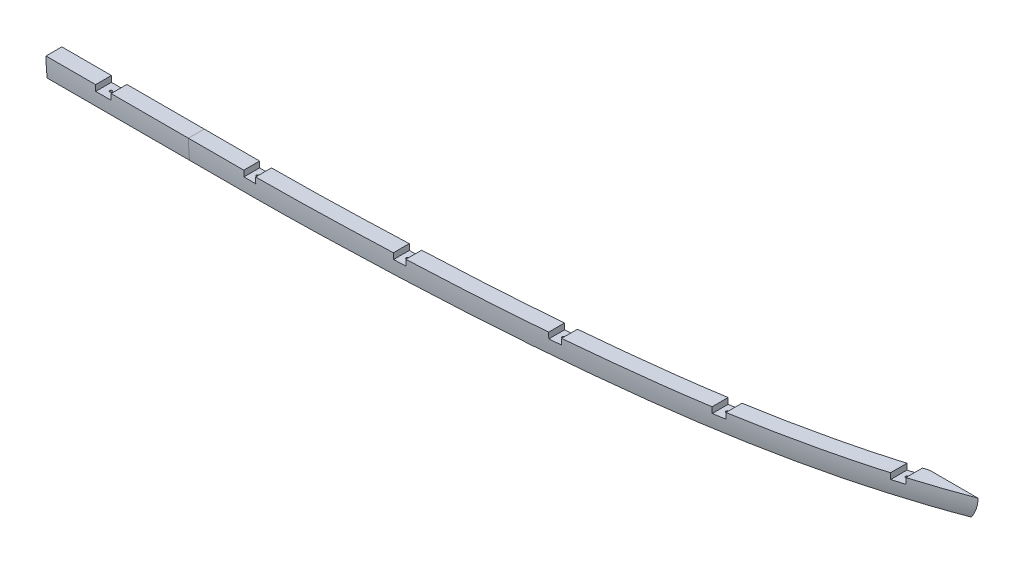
ISO-10303-21;
HEADER;
FILE_DESCRIPTION(('STEP AP214'),'2;1');
FILE_NAME('part.step','',(''),(''),'','','');
FILE_SCHEMA(('AUTOMOTIVE_DESIGN { 1 0 10303 214 1 1 1 1 }'));
ENDSEC;
DATA;
#1=APPLICATION_CONTEXT('core data for automotive mechanical design processes');
#2=APPLICATION_PROTOCOL_DEFINITION('international standard','automotive_design',2000,#1);
#3=PRODUCT_CONTEXT('',#1,'mechanical');
#4=PRODUCT('Part','Part','',(#3));
#5=PRODUCT_RELATED_PRODUCT_CATEGORY('part','',(#4));
#6=PRODUCT_DEFINITION_FORMATION('','',#4);
#7=PRODUCT_DEFINITION_CONTEXT('part definition',#1,'design');
#8=PRODUCT_DEFINITION('design','',#6,#7);
#9=PRODUCT_DEFINITION_SHAPE('','',#8);
#10=(LENGTH_UNIT() NAMED_UNIT(*) SI_UNIT(.MILLI.,.METRE.));
#11=(NAMED_UNIT(*) PLANE_ANGLE_UNIT() SI_UNIT($,.RADIAN.));
#12=(NAMED_UNIT(*) SI_UNIT($,.STERADIAN.) SOLID_ANGLE_UNIT());
#13=UNCERTAINTY_MEASURE_WITH_UNIT(LENGTH_MEASURE(1.E-05),#10,'distance_accuracy_value','');
#14=(GEOMETRIC_REPRESENTATION_CONTEXT(3) GLOBAL_UNCERTAINTY_ASSIGNED_CONTEXT((#13)) GLOBAL_UNIT_ASSIGNED_CONTEXT((#10,
#11,#12)) REPRESENTATION_CONTEXT('',''));
#15=CARTESIAN_POINT('',(0.,0.,0.));
#16=DIRECTION('',(0.,0.,1.));
#17=DIRECTION('',(1.,0.,0.));
#18=AXIS2_PLACEMENT_3D('',#15,#16,#17);
#19=CARTESIAN_POINT('',(-330.199999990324,7.58496376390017E-13,260.350000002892));
#20=DIRECTION('',(0.,-1.,0.));
#21=DIRECTION('',(0.,0.,-1.));
#22=AXIS2_PLACEMENT_3D('',#19,#20,#21);
#23=PLANE('',#22);
#24=DIRECTION('',(1.,0.,0.));
#25=VECTOR('',#24,1.);
#26=CARTESIAN_POINT('',(-330.199999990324,0.,234.949776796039));
#27=LINE('',#26,#25);
#28=CARTESIAN_POINT('',(-225.702864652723,7.01602316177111E-12,234.949776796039));
#29=VERTEX_POINT('',#28);
#30=CARTESIAN_POINT('',(-101.599999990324,0.,234.949776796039));
#31=VERTEX_POINT('',#30);
#32=EDGE_CURVE('E173',#29,#31,#27,.T.);
#33=ORIENTED_EDGE('',*,*,#32,.F.);
#34=DIRECTION('',(0.,0.,-1.));
#35=VECTOR('',#34,1.);
#36=CARTESIAN_POINT('',(-225.702864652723,8.4225803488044E-12,282.052001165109));
#37=LINE('',#36,#35);
#38=CARTESIAN_POINT('',(-225.702864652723,7.77451953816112E-12,260.350000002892));
#39=VERTEX_POINT('',#38);
#40=EDGE_CURVE('E138',#39,#29,#37,.T.);
#41=ORIENTED_EDGE('',*,*,#40,.F.);
#42=DIRECTION('',(1.,0.,0.));
#43=VECTOR('',#42,1.);
#44=CARTESIAN_POINT('',(-330.199999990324,7.58496376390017E-13,260.350000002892));
#45=LINE('',#44,#43);
#46=CARTESIAN_POINT('',(-101.599999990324,7.58496376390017E-13,260.350000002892));
#47=VERTEX_POINT('',#46);
#48=EDGE_CURVE('E177',#39,#47,#45,.T.);
#49=ORIENTED_EDGE('',*,*,#48,.T.);
#50=DIRECTION('',(0.,0.,-1.));
#51=VECTOR('',#50,1.);
#52=CARTESIAN_POINT('',(-101.599999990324,7.58496376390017E-13,260.350000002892));
#53=LINE('',#52,#51);
#54=EDGE_CURVE('E164',#47,#31,#53,.T.);
#55=ORIENTED_EDGE('',*,*,#54,.T.);
#56=EDGE_LOOP('',(#33,#41,#49,#55));
#57=FACE_BOUND('',#56,.T.);
#58=ADVANCED_FACE('F42',(#57),#23,.F.);
#59=CARTESIAN_POINT('',(-330.199999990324,0.,0.));
#60=DIRECTION('',(1.,0.,0.));
#61=DIRECTION('',(0.,0.,-1.));
#62=AXIS2_PLACEMENT_3D('',#59,#60,#61);
#63=CYLINDRICAL_SURFACE('',#62,260.350000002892);
#64=ORIENTED_EDGE('',*,*,#48,.F.);
#65=CARTESIAN_POINT('',(-225.702864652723,0.,0.));
#66=DIRECTION('',(1.,0.,0.));
#67=DIRECTION('',(0.,0.,-1.));
#68=AXIS2_PLACEMENT_3D('',#65,#66,#67);
#69=CIRCLE('',#68,260.350000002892);
#70=CARTESIAN_POINT('',(-225.702864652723,-9.52499999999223,260.175703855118));
#71=VERTEX_POINT('',#70);
#72=EDGE_CURVE('E151',#39,#71,#69,.T.);
#73=ORIENTED_EDGE('',*,*,#72,.T.);
#74=DIRECTION('',(1.,0.,0.));
#75=VECTOR('',#74,1.);
#76=CARTESIAN_POINT('',(-330.199999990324,-9.52499999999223,260.175703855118));
#77=LINE('',#76,#75);
#78=CARTESIAN_POINT('',(-250.547138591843,-9.52499999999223,260.175703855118));
#79=VERTEX_POINT('',#78);
#80=EDGE_CURVE('E144',#79,#71,#77,.T.);
#81=ORIENTED_EDGE('',*,*,#80,.F.);
#82=CARTESIAN_POINT('',(-250.547138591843,0.,0.));
#83=DIRECTION('',(-1.,0.,0.));
#84=DIRECTION('',(0.,0.,1.));
#85=AXIS2_PLACEMENT_3D('',#82,#83,#84);
#86=CIRCLE('',#85,260.350000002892);
#87=CARTESIAN_POINT('',(-250.547138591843,7.77451953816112E-12,260.350000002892));
#88=VERTEX_POINT('',#87);
#89=EDGE_CURVE('E148',#79,#88,#86,.T.);
#90=ORIENTED_EDGE('',*,*,#89,.T.);
#91=CARTESIAN_POINT('',(-330.199999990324,7.58496376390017E-13,260.350000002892));
#92=VERTEX_POINT('',#91);
#93=EDGE_CURVE('E178',#92,#88,#45,.T.);
#94=ORIENTED_EDGE('',*,*,#93,.F.);
#95=CARTESIAN_POINT('',(-330.199999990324,0.,0.));
#96=DIRECTION('',(-1.,0.,0.));
#97=DIRECTION('',(0.,0.,1.));
#98=AXIS2_PLACEMENT_3D('',#95,#96,#97);
#99=CIRCLE('',#98,260.350000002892);
#100=CARTESIAN_POINT('',(-330.199999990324,-31.7500000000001,258.406772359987));
#101=VERTEX_POINT('',#100);
#102=EDGE_CURVE('E155',#101,#92,#99,.T.);
#103=ORIENTED_EDGE('',*,*,#102,.F.);
#104=DIRECTION('',(1.,0.,0.));
#105=VECTOR('',#104,1.);
#106=CARTESIAN_POINT('',(-330.199999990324,-31.7500000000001,258.406772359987));
#107=LINE('',#106,#105);
#108=CARTESIAN_POINT('',(-101.599999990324,-31.7500000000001,258.406772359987));
#109=VERTEX_POINT('',#108);
#110=EDGE_CURVE('E161',#101,#109,#107,.T.);
#111=ORIENTED_EDGE('',*,*,#110,.T.);
#112=CARTESIAN_POINT('',(-101.599999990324,0.,0.));
#113=DIRECTION('',(-1.,0.,0.));
#114=DIRECTION('',(0.,0.,1.));
#115=AXIS2_PLACEMENT_3D('',#112,#113,#114);
#116=CIRCLE('',#115,260.350000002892);
#117=EDGE_CURVE('E154',#109,#47,#116,.T.);
#118=ORIENTED_EDGE('',*,*,#117,.T.);
#119=EDGE_LOOP('',(#64,#73,#81,#90,#94,#103,#111,#118));
#120=FACE_BOUND('',#119,.T.);
#121=ADVANCED_FACE('F44',(#120),#63,.T.);
#122=ORIENTED_EDGE('',*,*,#93,.T.);
#123=DIRECTION('',(0.,0.,1.));
#124=VECTOR('',#123,1.);
#125=CARTESIAN_POINT('',(-250.547138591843,8.4225803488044E-12,282.052001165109));
#126=LINE('',#125,#124);
#127=CARTESIAN_POINT('',(-250.547138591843,7.01602316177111E-12,234.949776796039));
#128=VERTEX_POINT('',#127);
#129=EDGE_CURVE('E141',#128,#88,#126,.T.);
#130=ORIENTED_EDGE('',*,*,#129,.F.);
#131=CARTESIAN_POINT('',(-330.199999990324,0.,234.949776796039));
#132=VERTEX_POINT('',#131);
#133=EDGE_CURVE('E174',#132,#128,#27,.T.);
#134=ORIENTED_EDGE('',*,*,#133,.F.);
#135=DIRECTION('',(0.,0.,-1.));
#136=VECTOR('',#135,1.);
#137=CARTESIAN_POINT('',(-330.199999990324,7.58496376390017E-13,260.350000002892));
#138=LINE('',#137,#136);
#139=EDGE_CURVE('E95',#92,#132,#138,.T.);
#140=ORIENTED_EDGE('',*,*,#139,.F.);
#141=EDGE_LOOP('',(#122,#130,#134,#140));
#142=FACE_BOUND('',#141,.T.);
#143=ADVANCED_FACE('F190',(#142),#23,.F.);
#144=CARTESIAN_POINT('',(-330.199999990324,-31.7500000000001,234.949776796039));
#145=DIRECTION('',(0.,0.,1.));
#146=DIRECTION('',(1.,0.,0.));
#147=AXIS2_PLACEMENT_3D('',#144,#145,#146);
#148=PLANE('',#147);
#149=DIRECTION('',(-1.,0.,0.));
#150=VECTOR('',#149,1.);
#151=CARTESIAN_POINT('',(-330.199999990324,-9.52499999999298,234.949776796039));
#152=LINE('',#151,#150);
#153=CARTESIAN_POINT('',(-225.702864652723,-9.52499999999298,234.949776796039));
#154=VERTEX_POINT('',#153);
#155=CARTESIAN_POINT('',(-250.547138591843,-9.52499999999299,234.949776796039));
#156=VERTEX_POINT('',#155);
#157=EDGE_CURVE('E180',#154,#156,#152,.T.);
#158=ORIENTED_EDGE('',*,*,#157,.F.);
#159=DIRECTION('',(0.,1.,0.));
#160=VECTOR('',#159,1.);
#161=CARTESIAN_POINT('',(-225.702864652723,-31.7500000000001,234.949776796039));
#162=LINE('',#161,#160);
#163=EDGE_CURVE('E12',#154,#29,#162,.T.);
#164=ORIENTED_EDGE('',*,*,#163,.T.);
#165=ORIENTED_EDGE('',*,*,#32,.T.);
#166=DIRECTION('',(0.,-1.,0.));
#167=VECTOR('',#166,1.);
#168=CARTESIAN_POINT('',(-101.599999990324,-31.7500000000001,234.949776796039));
#169=LINE('',#168,#167);
#170=CARTESIAN_POINT('',(-101.599999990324,-31.7500000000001,234.949776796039));
#171=VERTEX_POINT('',#170);
#172=EDGE_CURVE('E167',#31,#171,#169,.T.);
#173=ORIENTED_EDGE('',*,*,#172,.T.);
#174=DIRECTION('',(1.,0.,0.));
#175=VECTOR('',#174,1.);
#176=CARTESIAN_POINT('',(-330.199999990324,-31.7500000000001,234.949776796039));
#177=LINE('',#176,#175);
#178=CARTESIAN_POINT('',(-330.199999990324,-31.7500000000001,234.949776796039));
#179=VERTEX_POINT('',#178);
#180=EDGE_CURVE('E171',#179,#171,#177,.T.);
#181=ORIENTED_EDGE('',*,*,#180,.F.);
#182=DIRECTION('',(0.,-1.,0.));
#183=VECTOR('',#182,1.);
#184=CARTESIAN_POINT('',(-330.199999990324,-31.7500000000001,234.949776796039));
#185=LINE('',#184,#183);
#186=EDGE_CURVE('E158',#132,#179,#185,.T.);
#187=ORIENTED_EDGE('',*,*,#186,.F.);
#188=ORIENTED_EDGE('',*,*,#133,.T.);
#189=DIRECTION('',(0.,-1.,0.));
#190=VECTOR('',#189,1.);
#191=CARTESIAN_POINT('',(-250.547138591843,-31.7500000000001,234.949776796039));
#192=LINE('',#191,#190);
#193=EDGE_CURVE('E50',#128,#156,#192,.T.);
#194=ORIENTED_EDGE('',*,*,#193,.T.);
#195=EDGE_LOOP('',(#158,#164,#165,#173,#181,#187,#188,#194));
#196=FACE_BOUND('',#195,.T.);
#197=ADVANCED_FACE('F184',(#196),#148,.F.);
#198=CARTESIAN_POINT('',(-330.199999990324,-31.7500000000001,258.406772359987));
#199=DIRECTION('',(0.,1.,0.));
#200=DIRECTION('',(0.,0.,1.));
#201=AXIS2_PLACEMENT_3D('',#198,#199,#200);
#202=PLANE('',#201);
#203=DIRECTION('',(0.,0.,1.));
#204=VECTOR('',#203,1.);
#205=CARTESIAN_POINT('',(-101.599999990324,-31.7500000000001,258.406772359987));
#206=LINE('',#205,#204);
#207=EDGE_CURVE('E87',#171,#109,#206,.T.);
#208=ORIENTED_EDGE('',*,*,#207,.T.);
#209=ORIENTED_EDGE('',*,*,#110,.F.);
#210=DIRECTION('',(0.,0.,1.));
#211=VECTOR('',#210,1.);
#212=CARTESIAN_POINT('',(-330.199999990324,-31.7500000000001,258.406772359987));
#213=LINE('',#212,#211);
#214=EDGE_CURVE('E66',#179,#101,#213,.T.);
#215=ORIENTED_EDGE('',*,*,#214,.F.);
#216=ORIENTED_EDGE('',*,*,#180,.T.);
#217=EDGE_LOOP('',(#208,#209,#215,#216));
#218=FACE_BOUND('',#217,.T.);
#219=ADVANCED_FACE('F208',(#218),#202,.F.);
#220=CARTESIAN_POINT('',(-330.199999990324,0.,0.));
#221=DIRECTION('',(-1.,0.,0.));
#222=DIRECTION('',(0.,0.,1.));
#223=AXIS2_PLACEMENT_3D('',#220,#221,#222);
#224=PLANE('',#223);
#225=ORIENTED_EDGE('',*,*,#102,.T.);
#226=ORIENTED_EDGE('',*,*,#139,.T.);
#227=ORIENTED_EDGE('',*,*,#186,.T.);
#228=ORIENTED_EDGE('',*,*,#214,.T.);
#229=EDGE_LOOP('',(#225,#226,#227,#228));
#230=FACE_BOUND('',#229,.T.);
#231=ADVANCED_FACE('F210',(#230),#224,.T.);
#232=CARTESIAN_POINT('',(-101.599999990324,0.,0.));
#233=DIRECTION('',(-1.,0.,0.));
#234=DIRECTION('',(0.,0.,1.));
#235=AXIS2_PLACEMENT_3D('',#232,#233,#234);
#236=PLANE('',#235);
#237=ORIENTED_EDGE('',*,*,#117,.F.);
#238=ORIENTED_EDGE('',*,*,#207,.F.);
#239=ORIENTED_EDGE('',*,*,#172,.F.);
#240=ORIENTED_EDGE('',*,*,#54,.F.);
#241=EDGE_LOOP('',(#237,#238,#239,#240));
#242=FACE_BOUND('',#241,.T.);
#243=ADVANCED_FACE('F206',(#242),#236,.F.);
#244=CARTESIAN_POINT('',(-225.702864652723,-9.52499999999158,282.052001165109));
#245=DIRECTION('',(1.,0.,0.));
#246=DIRECTION('',(0.,0.,-1.));
#247=AXIS2_PLACEMENT_3D('',#244,#245,#246);
#248=PLANE('',#247);
#249=ORIENTED_EDGE('',*,*,#40,.T.);
#250=ORIENTED_EDGE('',*,*,#163,.F.);
#251=DIRECTION('',(0.,0.,-1.));
#252=VECTOR('',#251,1.);
#253=CARTESIAN_POINT('',(-225.702864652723,-9.52499999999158,282.052001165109));
#254=LINE('',#253,#252);
#255=EDGE_CURVE('E57',#71,#154,#254,.T.);
#256=ORIENTED_EDGE('',*,*,#255,.F.);
#257=ORIENTED_EDGE('',*,*,#72,.F.);
#258=EDGE_LOOP('',(#249,#250,#256,#257));
#259=FACE_BOUND('',#258,.T.);
#260=ADVANCED_FACE('F198',(#259),#248,.F.);
#261=CARTESIAN_POINT('',(-250.547138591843,-9.52499999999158,282.052001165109));
#262=DIRECTION('',(-1.,0.,0.));
#263=DIRECTION('',(0.,0.,1.));
#264=AXIS2_PLACEMENT_3D('',#261,#262,#263);
#265=PLANE('',#264);
#266=DIRECTION('',(0.,0.,1.));
#267=VECTOR('',#266,1.);
#268=CARTESIAN_POINT('',(-250.547138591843,-9.52499999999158,282.052001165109));
#269=LINE('',#268,#267);
#270=EDGE_CURVE('E140',#156,#79,#269,.T.);
#271=ORIENTED_EDGE('',*,*,#270,.F.);
#272=ORIENTED_EDGE('',*,*,#193,.F.);
#273=ORIENTED_EDGE('',*,*,#129,.T.);
#274=ORIENTED_EDGE('',*,*,#89,.F.);
#275=EDGE_LOOP('',(#271,#272,#273,#274));
#276=FACE_BOUND('',#275,.T.);
#277=ADVANCED_FACE('F189',(#276),#265,.F.);
#278=CARTESIAN_POINT('',(-225.702864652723,-9.52499999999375,209.170142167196));
#279=DIRECTION('',(0.,1.,0.));
#280=DIRECTION('',(0.,0.,1.));
#281=AXIS2_PLACEMENT_3D('',#278,#279,#280);
#282=PLANE('',#281);
#283=CARTESIAN_POINT('',(-238.488210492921,-9.52499999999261,247.650862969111));
#284=DIRECTION('',(0.,1.,0.));
#285=DIRECTION('',(0.,0.,1.));
#286=AXIS2_PLACEMENT_3D('',#283,#284,#285);
#287=CIRCLE('',#286,2.0828);
#288=CARTESIAN_POINT('',(-238.488210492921,-9.52499999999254,249.733662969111));
#289=VERTEX_POINT('',#288);
#290=EDGE_CURVE('E135',#289,#289,#287,.T.);
#291=ORIENTED_EDGE('',*,*,#290,.F.);
#292=EDGE_LOOP('',(#291));
#293=FACE_BOUND('',#292,.T.);
#294=ORIENTED_EDGE('',*,*,#80,.T.);
#295=ORIENTED_EDGE('',*,*,#255,.T.);
#296=ORIENTED_EDGE('',*,*,#157,.T.);
#297=ORIENTED_EDGE('',*,*,#270,.T.);
#298=EDGE_LOOP('',(#294,#295,#296,#297));
#299=FACE_BOUND('',#298,.T.);
#300=ADVANCED_FACE('F196',(#293,#299),#282,.T.);
#301=CARTESIAN_POINT('',(-238.488210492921,-9.52499999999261,247.650862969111));
#302=DIRECTION('',(0.,1.,0.));
#303=DIRECTION('',(0.,0.,1.));
#304=AXIS2_PLACEMENT_3D('',#301,#302,#303);
#305=CYLINDRICAL_SURFACE('',#304,2.0828);
#306=CARTESIAN_POINT('',(-238.488210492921,-17.8559967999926,247.650862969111));
#307=DIRECTION('',(0.,1.,0.));
#308=DIRECTION('',(0.,0.,1.));
#309=AXIS2_PLACEMENT_3D('',#306,#307,#308);
#310=CIRCLE('',#309,2.0828);
#311=CARTESIAN_POINT('',(-238.488210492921,-17.8559967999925,249.733662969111));
#312=VERTEX_POINT('',#311);
#313=EDGE_CURVE('E130',#312,#312,#310,.T.);
#314=ORIENTED_EDGE('',*,*,#313,.F.);
#315=EDGE_LOOP('',(#314));
#316=FACE_BOUND('',#315,.T.);
#317=ORIENTED_EDGE('',*,*,#290,.T.);
#318=EDGE_LOOP('',(#317));
#319=FACE_BOUND('',#318,.T.);
#320=ADVANCED_FACE('F260',(#316,#319),#305,.F.);
#321=CARTESIAN_POINT('',(-236.761010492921,-17.8559967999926,247.650862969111));
#322=DIRECTION('',(0.,-1.,0.));
#323=DIRECTION('',(0.,0.,-1.));
#324=AXIS2_PLACEMENT_3D('',#321,#322,#323);
#325=PLANE('',#324);
#326=CARTESIAN_POINT('',(-238.488210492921,-17.8559967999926,247.650862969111));
#327=DIRECTION('',(0.,1.,0.));
#328=DIRECTION('',(0.,0.,1.));
#329=AXIS2_PLACEMENT_3D('',#326,#327,#328);
#330=CIRCLE('',#329,1.72719999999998);
#331=CARTESIAN_POINT('',(-238.488210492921,-17.8559967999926,249.378062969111));
#332=VERTEX_POINT('',#331);
#333=EDGE_CURVE('E127',#332,#332,#330,.T.);
#334=ORIENTED_EDGE('',*,*,#333,.F.);
#335=EDGE_LOOP('',(#334));
#336=FACE_BOUND('',#335,.T.);
#337=ORIENTED_EDGE('',*,*,#313,.T.);
#338=EDGE_LOOP('',(#337));
#339=FACE_BOUND('',#338,.T.);
#340=ADVANCED_FACE('F270',(#336,#339),#325,.F.);
#341=CARTESIAN_POINT('',(-238.488210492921,-9.52499999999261,247.650862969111));
#342=DIRECTION('',(0.,1.,0.));
#343=DIRECTION('',(0.,0.,1.));
#344=AXIS2_PLACEMENT_3D('',#341,#342,#343);
#345=CYLINDRICAL_SURFACE('',#344,1.72719999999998);
#346=CARTESIAN_POINT('',(-238.488210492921,-21.8190063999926,247.650862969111));
#347=DIRECTION('',(0.,1.,0.));
#348=DIRECTION('',(0.,0.,1.));
#349=AXIS2_PLACEMENT_3D('',#346,#347,#348);
#350=CIRCLE('',#349,1.72719999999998);
#351=CARTESIAN_POINT('',(-238.488210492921,-21.8190063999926,249.378062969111));
#352=VERTEX_POINT('',#351);
#353=EDGE_CURVE('E125',#352,#352,#350,.T.);
#354=ORIENTED_EDGE('',*,*,#353,.F.);
#355=EDGE_LOOP('',(#354));
#356=FACE_BOUND('',#355,.T.);
#357=ORIENTED_EDGE('',*,*,#333,.T.);
#358=EDGE_LOOP('',(#357));
#359=FACE_BOUND('',#358,.T.);
#360=ADVANCED_FACE('F121',(#356,#359),#345,.F.);
#361=CARTESIAN_POINT('',(-238.488210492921,-21.8190063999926,247.650862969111));
#362=DIRECTION('',(0.,1.,0.));
#363=DIRECTION('',(0.,0.,1.));
#364=AXIS2_PLACEMENT_3D('',#361,#362,#363);
#365=CONICAL_SURFACE('',#364,1.72719999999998,1.02974425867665);
#366=CARTESIAN_POINT('',(-238.488210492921,-22.856812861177,247.650862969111));
#367=VERTEX_POINT('',#366);
#368=VERTEX_LOOP('',#367);
#369=FACE_BOUND('',#368,.T.);
#370=ORIENTED_EDGE('',*,*,#353,.T.);
#371=EDGE_LOOP('',(#370));
#372=FACE_BOUND('',#371,.T.);
#373=ADVANCED_FACE('F118',(#369,#372),#365,.F.);
#374=CLOSED_SHELL('',(#58,#121,#143,#197,#219,#231,#243,#260,#277,#300,#320,#340,#360,#373));
#375=MANIFOLD_SOLID_BREP('B2',#374);
#376=CARTESIAN_POINT('',(534.422572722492,-9.525,259.022249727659));
#377=DIRECTION('',(0.,-1.,0.));
#378=DIRECTION('',(0.,0.,-1.));
#379=AXIS2_PLACEMENT_3D('',#376,#377,#378);
#380=PLANE('',#379);
#381=DIRECTION('',(0.,0.,-1.));
#382=VECTOR('',#381,1.);
#383=CARTESIAN_POINT('',(946.149998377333,-9.525,103.438565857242));
#384=LINE('',#383,#382);
#385=CARTESIAN_POINT('',(946.149998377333,-9.525,156.0331716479));
#386=VERTEX_POINT('',#385);
#387=CARTESIAN_POINT('',(946.149998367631,-9.52500000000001,129.744661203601));
#388=VERTEX_POINT('',#387);
#389=EDGE_CURVE('E347',#386,#388,#384,.T.);
#390=ORIENTED_EDGE('',*,*,#389,.T.);
#391=CARTESIAN_POINT('',(-2075.5032815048,-9.52500000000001,192.843277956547));
#392=CARTESIAN_POINT('',(-1384.2296257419,-9.52500000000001,236.188781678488));
#393=CARTESIAN_POINT('',(-693.790280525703,-9.52500000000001,234.915647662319));
#394=CARTESIAN_POINT('',(2.7463275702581,-9.52500000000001,234.951167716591));
#395=CARTESIAN_POINT('',(8.8188747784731,-9.52500000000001,234.93803628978));
#396=CARTESIAN_POINT('',(20.9633487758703,-9.52500000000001,234.87859364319));
#397=CARTESIAN_POINT('',(39.1792048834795,-9.52500000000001,234.74371053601));
#398=CARTESIAN_POINT('',(57.3926984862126,-9.52500000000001,234.482481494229));
#399=CARTESIAN_POINT('',(93.8170721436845,-9.52500000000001,233.820251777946));
#400=CARTESIAN_POINT('',(118.096503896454,-9.52500000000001,233.19244118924));
#401=CARTESIAN_POINT('',(166.651240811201,-9.52500000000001,231.716131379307));
#402=CARTESIAN_POINT('',(190.926726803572,-9.52500000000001,230.877302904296));
#403=CARTESIAN_POINT('',(239.473167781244,-9.52500000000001,228.957329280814));
#404=CARTESIAN_POINT('',(263.743135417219,-9.52500000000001,227.87477772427));
#405=CARTESIAN_POINT('',(312.257838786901,-9.52500000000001,225.415648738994));
#406=CARTESIAN_POINT('',(336.504717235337,-9.52500000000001,224.039778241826));
#407=CARTESIAN_POINT('',(384.973238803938,-9.52500000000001,220.935512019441));
#408=CARTESIAN_POINT('',(409.194867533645,-9.52500000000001,219.206915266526));
#409=CARTESIAN_POINT('',(457.608437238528,-9.52500000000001,215.334998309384));
#410=CARTESIAN_POINT('',(481.799938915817,-9.52500000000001,213.185541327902));
#411=CARTESIAN_POINT('',(518.064441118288,-9.52500000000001,209.643545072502));
#412=CARTESIAN_POINT('',(530.148863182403,-9.52500000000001,208.410559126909));
#413=CARTESIAN_POINT('',(554.310403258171,-9.52500000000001,205.842553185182));
#414=CARTESIAN_POINT('',(566.38121653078,-9.52500000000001,204.510901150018));
#415=CARTESIAN_POINT('',(602.551579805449,-9.52500000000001,200.341319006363));
#416=CARTESIAN_POINT('',(626.609600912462,-9.52500000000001,197.321969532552));
#417=CARTESIAN_POINT('',(674.553245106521,-9.52500000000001,190.539650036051));
#418=CARTESIAN_POINT('',(698.436657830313,-9.52500000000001,186.767145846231));
#419=CARTESIAN_POINT('',(734.129420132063,-9.52500000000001,180.537482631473));
#420=CARTESIAN_POINT('',(746.004996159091,-9.52500000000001,178.365984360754));
#421=CARTESIAN_POINT('',(769.712255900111,-9.52500000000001,173.833662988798));
#422=CARTESIAN_POINT('',(781.543893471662,-9.52500000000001,171.472640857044));
#423=CARTESIAN_POINT('',(816.964640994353,-9.52500000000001,164.06967078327));
#424=CARTESIAN_POINT('',(840.479552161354,-9.52500000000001,158.707674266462));
#425=CARTESIAN_POINT('',(887.26743801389,-9.52500000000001,146.940113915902));
#426=CARTESIAN_POINT('',(910.54127033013,-9.52500000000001,140.538249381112));
#427=CARTESIAN_POINT('',(945.252593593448,-9.52500000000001,130.075253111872));
#428=CARTESIAN_POINT('',(956.789604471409,-9.52500000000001,126.443390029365));
#429=CARTESIAN_POINT('',(979.794414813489,-9.52500000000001,118.881127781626));
#430=CARTESIAN_POINT('',(1002.73074739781,-9.52500000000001,111.023493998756));
#431=CARTESIAN_POINT('',(1025.53280895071,-9.52500000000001,102.58669638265));
#432=CARTESIAN_POINT('',(1042.58492404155,-9.52500000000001,96.0458824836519));
#433=CARTESIAN_POINT('',(1048.26072300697,-9.52500000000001,93.8300714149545));
#434=CARTESIAN_POINT('',(1358.84923139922,-9.52500000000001,-29.5279837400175));
#435=CARTESIAN_POINT('',(1640.91361568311,-9.52500000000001,-249.224051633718));
#436=CARTESIAN_POINT('',(1619.25607380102,-9.52500000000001,-1778.99238931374));
#437=B_SPLINE_CURVE_WITH_KNOTS('',3,(#391,#392,#393,#394,#395,#396,#397,#398,#399,#400,#401,
#402,#403,#404,#405,#406,#407,#408,#409,#410,#411,#412,#413,#414,#415,#416,#417,#418,#419,#420,
#421,#422,#423,#424,#425,#426,#427,#428,#429,#430,#431,#432,#433,#434,#435,#436),.UNSPECIFIED.,
.F.,.F.,(4,2,2,1,2,2,2,2,2,2,2,2,2,2,2,2,2,2,2,2,1,2,2,4),(-1.71402806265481,0.0625000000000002,
0.0781250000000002,0.0937500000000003,0.125,0.187500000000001,0.250000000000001,
0.312500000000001,0.375000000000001,0.437500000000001,0.500000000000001,0.531250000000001,
0.562500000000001,0.625000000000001,0.687500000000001,0.718750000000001,0.750000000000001,
0.812500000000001,0.875000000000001,0.90625,0.9375,0.96875,0.984375,1.82500641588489),.UNSPECIFIED.);
#438=CARTESIAN_POINT('',(927.099998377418,-9.525,135.530492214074));
#439=VERTEX_POINT('',#438);
#440=EDGE_CURVE('E935',#439,#388,#437,.T.);
#441=ORIENTED_EDGE('',*,*,#440,.F.);
#442=DIRECTION('',(0.,0.,1.));
#443=VECTOR('',#442,1.);
#444=CARTESIAN_POINT('',(927.099998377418,-9.525,109.017910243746));
#445=LINE('',#444,#443);
#446=CARTESIAN_POINT('',(927.099998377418,-9.525,161.723432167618));
#447=VERTEX_POINT('',#446);
#448=EDGE_CURVE('E580',#439,#447,#445,.T.);
#449=ORIENTED_EDGE('',*,*,#448,.T.);
#450=CARTESIAN_POINT('',(946.149998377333,-9.525,156.0331716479));
#451=CARTESIAN_POINT('',(945.35781155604,-9.525,156.275484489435));
#452=CARTESIAN_POINT('',(944.565423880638,-9.525,156.517140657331));
#453=CARTESIAN_POINT('',(942.980256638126,-9.525,156.999141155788));
#454=CARTESIAN_POINT('',(942.187477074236,-9.525,157.239485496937));
#455=CARTESIAN_POINT('',(940.601527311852,-9.525,157.718866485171));
#456=CARTESIAN_POINT('',(939.808357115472,-9.525,157.957903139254));
#457=CARTESIAN_POINT('',(938.221627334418,-9.525,158.434672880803));
#458=CARTESIAN_POINT('',(937.428067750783,-9.525,158.672405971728));
#459=CARTESIAN_POINT('',(935.840560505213,-9.525,159.146572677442));
#460=CARTESIAN_POINT('',(935.046612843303,-9.525,159.383006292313));
#461=CARTESIAN_POINT('',(933.458330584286,-9.525,159.854578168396));
#462=CARTESIAN_POINT('',(932.663995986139,-9.525,160.089716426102));
#463=CARTESIAN_POINT('',(931.074941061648,-9.525,160.558701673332));
#464=CARTESIAN_POINT('',(930.280220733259,-9.525,160.792548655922));
#465=CARTESIAN_POINT('',(928.690395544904,-9.525,161.258955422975));
#466=CARTESIAN_POINT('',(927.895290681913,-9.525,161.491515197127));
#467=CARTESIAN_POINT('',(927.099998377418,-9.525,161.723432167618));
#468=B_SPLINE_CURVE_WITH_KNOTS('',3,(#450,#451,#452,#453,#454,#455,#456,#457,#458,#459,#460,
#461,#462,#463,#464,#465,#466,#467),.UNSPECIFIED.,.F.,.F.,(4,2,2,2,2,2,2,2,4),(0.,
2.48525205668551,4.9704840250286,7.4557026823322,9.94091474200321,12.4261266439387,
14.9113452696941,17.3965772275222,19.8818290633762),.UNSPECIFIED.);
#469=EDGE_CURVE('E584',#386,#447,#468,.T.);
#470=ORIENTED_EDGE('',*,*,#469,.F.);
#471=EDGE_LOOP('',(#390,#441,#449,#470));
#472=FACE_BOUND('',#471,.T.);
#473=CARTESIAN_POINT('',(936.624998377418,-9.525,145.372528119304));
#474=DIRECTION('',(0.,1.,0.));
#475=DIRECTION('',(0.,0.,1.));
#476=AXIS2_PLACEMENT_3D('',#473,#474,#475);
#477=CIRCLE('',#476,2.08280000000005);
#478=CARTESIAN_POINT('',(936.624998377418,-9.525,147.455328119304));
#479=VERTEX_POINT('',#478);
#480=EDGE_CURVE('E523',#479,#479,#477,.T.);
#481=ORIENTED_EDGE('',*,*,#480,.F.);
#482=EDGE_LOOP('',(#481));
#483=FACE_BOUND('',#482,.T.);
#484=ADVANCED_FACE('F330',(#472,#483),#380,.F.);
#485=CARTESIAN_POINT('',(1096.30575386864,0.,260.377618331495));
#486=DIRECTION('',(0.,-1.,0.));
#487=DIRECTION('',(1.,0.,0.));
#488=AXIS2_PLACEMENT_3D('',#485,#486,#487);
#489=PLANE('',#488);
#490=CARTESIAN_POINT('',(-1187.45,-2.14764522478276E-13,0.793750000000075));
#491=CARTESIAN_POINT('',(-1187.41582639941,-2.10045062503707E-13,2.14485212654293));
#492=CARTESIAN_POINT('',(-1187.35078911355,-2.01063250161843E-13,4.71619414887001));
#493=CARTESIAN_POINT('',(-1187.0134288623,-1.869523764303E-13,8.75174252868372));
#494=CARTESIAN_POINT('',(-1186.47507361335,-1.72346646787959E-13,12.9254698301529));
#495=CARTESIAN_POINT('',(-1185.60677768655,-1.55742806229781E-13,17.6656455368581));
#496=CARTESIAN_POINT('',(-1184.39784787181,-1.3828640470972E-13,22.6439822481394));
#497=CARTESIAN_POINT('',(-1182.81805663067,-1.20315610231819E-13,27.7630904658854));
#498=CARTESIAN_POINT('',(-1180.9000462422,-1.02322052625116E-13,32.8827389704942));
#499=CARTESIAN_POINT('',(-1178.45058427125,0.,38.3646195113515));
#500=CARTESIAN_POINT('',(-1175.42025005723,0.,44.0192595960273));
#501=CARTESIAN_POINT('',(-1171.99485787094,0.,49.3799018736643));
#502=CARTESIAN_POINT('',(-1162.66570449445,0.,61.9168794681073));
#503=CARTESIAN_POINT('',(-1135.90498590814,0.,83.8406115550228));
#504=CARTESIAN_POINT('',(-1094.24342763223,1.86864655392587E-13,114.177065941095));
#505=CARTESIAN_POINT('',(-1042.34684056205,2.86427843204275E-13,141.77560733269));
#506=CARTESIAN_POINT('',(-991.223618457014,3.68605878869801E-13,164.408518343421));
#507=CARTESIAN_POINT('',(-940.26850637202,4.383592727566E-13,183.48584456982));
#508=CARTESIAN_POINT('',(-872.800317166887,5.16458855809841E-13,204.661680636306));
#509=CARTESIAN_POINT('',(-788.126145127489,5.92125596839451E-13,224.836541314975));
#510=CARTESIAN_POINT('',(-686.226676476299,6.5781179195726E-13,241.848338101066));
#511=CARTESIAN_POINT('',(-584.376798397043,7.00101945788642E-13,252.160122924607));
#512=CARTESIAN_POINT('',(-465.769527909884,7.31891836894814E-13,259.168263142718));
#513=CARTESIAN_POINT('',(-377.536944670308,7.41534100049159E-13,260.370064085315));
#514=CARTESIAN_POINT('',(-317.35321345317,7.45173680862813E-13,260.348501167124));
#515=CARTESIAN_POINT('',(-301.814810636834,7.46139827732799E-13,260.350515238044));
#516=CARTESIAN_POINT('',(-285.383466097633,7.47151929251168E-13,260.349905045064));
#517=CARTESIAN_POINT('',(-269.464917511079,7.48134936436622E-13,260.350027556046));
#518=CARTESIAN_POINT('',(-254.830951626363,7.49038103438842E-13,260.349992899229));
#519=CARTESIAN_POINT('',(-237.501096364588,7.50107830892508E-13,260.350002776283));
#520=CARTESIAN_POINT('',(-220.686068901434,7.51145734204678E-13,260.349999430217));
#521=CARTESIAN_POINT('',(-203.743111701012,7.52191548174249E-13,260.350000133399));
#522=CARTESIAN_POINT('',(-190.137919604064,7.5303133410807E-13,260.349999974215));
#523=CARTESIAN_POINT('',(-176.91664822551,7.53847423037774E-13,260.350000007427));
#524=CARTESIAN_POINT('',(-163.438709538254,7.54679354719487E-13,260.349999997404));
#525=CARTESIAN_POINT('',(-149.960576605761,7.55511298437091E-13,260.350000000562));
#526=CARTESIAN_POINT('',(-136.739809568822,7.56327356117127E-13,260.349999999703));
#527=CARTESIAN_POINT('',(-123.775328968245,7.57127594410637E-13,260.350000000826));
#528=CARTESIAN_POINT('',(-110.42660200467,7.57951550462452E-13,260.349999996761));
#529=CARTESIAN_POINT('',(-96.4355080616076,7.5881515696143E-13,260.350000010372));
#530=CARTESIAN_POINT('',(-84.6282308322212,7.59543966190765E-13,260.349999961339));
#531=CARTESIAN_POINT('',(-73.7156567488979,7.60217550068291E-13,260.350000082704));
#532=CARTESIAN_POINT('',(-64.9868798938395,7.60756336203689E-13,260.34999966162));
#533=CARTESIAN_POINT('',(-55.231805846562,7.61358477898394E-13,260.350001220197));
#534=CARTESIAN_POINT('',(-45.861466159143,7.61936840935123E-13,260.349993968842));
#535=CARTESIAN_POINT('',(-36.2370664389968,7.62530988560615E-13,260.35001610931));
#536=CARTESIAN_POINT('',(-26.0980257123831,7.63156501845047E-13,260.349923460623));
#537=CARTESIAN_POINT('',(-16.5997342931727,7.63744259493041E-13,260.350344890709));
#538=CARTESIAN_POINT('',(-7.42860193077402,7.64306909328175E-13,260.349358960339));
#539=CARTESIAN_POINT('',(48.1875926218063,7.67835019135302E-13,260.376618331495));
#540=CARTESIAN_POINT('',(152.453619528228,7.65954788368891E-13,257.994794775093));
#541=CARTESIAN_POINT('',(304.904930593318,7.53975679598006E-13,251.868678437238));
#542=CARTESIAN_POINT('',(440.424562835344,7.30880661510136E-13,242.858173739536));
#543=CARTESIAN_POINT('',(558.943048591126,6.97731638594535E-13,231.268650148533));
#544=CARTESIAN_POINT('',(660.71441054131,6.60911228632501E-13,218.923670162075));
#545=CARTESIAN_POINT('',(762.460039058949,6.0768095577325E-13,201.87917630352));
#546=CARTESIAN_POINT('',(864.373412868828,5.37584167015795E-13,180.000957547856));
#547=CARTESIAN_POINT('',(966.359094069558,4.43863598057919E-13,151.355344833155));
#548=CARTESIAN_POINT('',(1050.69033611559,3.42762459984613E-13,120.907964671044));
#549=CARTESIAN_POINT('',(1118.18156361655,2.47909338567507E-13,92.5477988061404));
#550=CARTESIAN_POINT('',(1151.54570991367,1.92603703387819E-13,76.1178044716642));
#551=CARTESIAN_POINT('',(1168.4,1.64665412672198E-13,67.8180000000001));
#552=B_SPLINE_CURVE_WITH_KNOTS('',3,(#490,#491,#492,#493,#494,#495,#496,#497,#498,#499,#500,
#501,#502,#503,#504,#505,#506,#507,#508,#509,#510,#511,#512,#513,#514,#515,#516,#517,#518,#519,
#520,#521,#522,#523,#524,#525,#526,#527,#528,#529,#530,#531,#532,#533,#534,#535,#536,#537,#538,
#539,#540,#541,#542,#543,#544,#545,#546,#547,#548,#549,#550,#551),.UNSPECIFIED.,.F.,.F.,(4,1,1,
1,1,1,1,1,1,1,1,1,1,1,1,1,1,1,1,1,1,1,1,1,1,1,1,1,1,1,1,1,1,1,1,1,1,1,1,1,1,1,1,1,1,1,1,1,1,1,1,
1,1,1,1,1,1,1,1,4),(0.,0.00164521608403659,0.00313108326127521,0.00492821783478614,
0.00676699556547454,0.00899569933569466,0.011161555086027,0.0132858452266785,0.0156483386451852,
0.0184669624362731,0.0210880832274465,0.0233881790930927,0.0374655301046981,0.0627504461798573,
0.0862304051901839,0.108796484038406,0.130815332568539,0.152430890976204,0.194859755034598,
0.236667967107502,0.278128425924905,0.319436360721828,0.381297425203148,0.385523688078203,
0.39271258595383,0.400215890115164,0.405529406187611,0.412093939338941,0.418033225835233,
0.426629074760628,0.432566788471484,0.43866183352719,0.443193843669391,0.448664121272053,
0.455071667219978,0.459603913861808,0.464760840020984,0.470856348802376,0.475856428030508,
0.48179545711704,0.485232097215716,0.489142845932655,0.492423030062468,0.497109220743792,
0.500551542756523,0.504141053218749,0.509453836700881,0.512116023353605,0.515307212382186,
0.577168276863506,0.63907261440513,0.701067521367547,0.742496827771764,0.784051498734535,
0.825859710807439,0.868057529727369,0.910905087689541,0.954729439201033,0.977131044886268,1.),.UNSPECIFIED.);
#553=CARTESIAN_POINT('',(711.199998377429,0.,210.268965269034));
#554=VERTEX_POINT('',#553);
#555=CARTESIAN_POINT('',(927.099998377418,0.,162.003685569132));
#556=VERTEX_POINT('',#555);
#557=EDGE_CURVE('E775',#554,#556,#552,.T.);
#558=ORIENTED_EDGE('',*,*,#557,.T.);
#559=DIRECTION('',(0.,0.,1.));
#560=VECTOR('',#559,1.);
#561=CARTESIAN_POINT('',(927.099998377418,0.,109.017910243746));
#562=LINE('',#561,#560);
#563=CARTESIAN_POINT('',(927.099998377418,0.,135.530404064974));
#564=VERTEX_POINT('',#563);
#565=EDGE_CURVE('E585',#564,#556,#562,.T.);
#566=ORIENTED_EDGE('',*,*,#565,.F.);
#567=CARTESIAN_POINT('',(711.199998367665,0.,184.511143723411));
#568=CARTESIAN_POINT('',(714.879381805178,0.,183.887855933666));
#569=CARTESIAN_POINT('',(718.556659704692,0.,183.255486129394));
#570=CARTESIAN_POINT('',(734.129420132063,0.,180.537482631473));
#571=CARTESIAN_POINT('',(746.004996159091,0.,178.365984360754));
#572=CARTESIAN_POINT('',(769.712255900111,0.,173.833662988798));
#573=CARTESIAN_POINT('',(781.543893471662,0.,171.472640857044));
#574=CARTESIAN_POINT('',(816.964640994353,0.,164.06967078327));
#575=CARTESIAN_POINT('',(840.479552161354,0.,158.707674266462));
#576=CARTESIAN_POINT('',(885.050604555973,0.,147.49766681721));
#577=CARTESIAN_POINT('',(906.129288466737,0.,141.746891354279));
#578=CARTESIAN_POINT('',(927.10002239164,0.,135.530485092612));
#579=B_SPLINE_CURVE_WITH_KNOTS('',3,(#567,#568,#569,#570,#571,#572,#573,#574,#575,#576,#577,
#578),.UNSPECIFIED.,.F.,.F.,(4,2,2,2,2,4),(0.677846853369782,0.687500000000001,
0.718750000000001,0.750000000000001,0.812500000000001,0.869077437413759),.UNSPECIFIED.);
#580=CARTESIAN_POINT('',(711.199998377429,0.,184.511155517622));
#581=VERTEX_POINT('',#580);
#582=EDGE_CURVE('E824',#581,#564,#579,.T.);
#583=ORIENTED_EDGE('',*,*,#582,.F.);
#584=DIRECTION('',(0.,0.,-1.));
#585=VECTOR('',#584,1.);
#586=CARTESIAN_POINT('',(711.199998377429,0.,158.745002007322));
#587=LINE('',#586,#585);
#588=EDGE_CURVE('E963',#554,#581,#587,.T.);
#589=ORIENTED_EDGE('',*,*,#588,.F.);
#590=EDGE_LOOP('',(#558,#566,#583,#589));
#591=FACE_BOUND('',#590,.T.);
#592=ADVANCED_FACE('F606',(#591),#489,.F.);
#593=CARTESIAN_POINT('',(476.24999837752,0.,239.123804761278));
#594=VERTEX_POINT('',#593);
#595=CARTESIAN_POINT('',(692.149998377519,0.,213.375979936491));
#596=VERTEX_POINT('',#595);
#597=EDGE_CURVE('E964',#594,#596,#552,.T.);
#598=ORIENTED_EDGE('',*,*,#597,.T.);
#599=DIRECTION('',(0.,0.,1.));
#600=VECTOR('',#599,1.);
#601=CARTESIAN_POINT('',(692.149998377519,0.,161.924874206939));
#602=LINE('',#601,#600);
#603=CARTESIAN_POINT('',(692.149998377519,0.,187.654027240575));
#604=VERTEX_POINT('',#603);
#605=EDGE_CURVE('E1013',#604,#596,#602,.T.);
#606=ORIENTED_EDGE('',*,*,#605,.F.);
#607=CARTESIAN_POINT('',(476.249998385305,0.,213.620035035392));
#608=CARTESIAN_POINT('',(486.161308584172,0.,212.723740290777));
#609=CARTESIAN_POINT('',(496.070064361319,0.,211.791761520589));
#610=CARTESIAN_POINT('',(518.064441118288,0.,209.643545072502));
#611=CARTESIAN_POINT('',(530.148863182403,0.,208.410559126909));
#612=CARTESIAN_POINT('',(554.310403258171,0.,205.842553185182));
#613=CARTESIAN_POINT('',(566.38121653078,0.,204.510901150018));
#614=CARTESIAN_POINT('',(602.551579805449,0.,200.341319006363));
#615=CARTESIAN_POINT('',(626.609600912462,0.,197.321969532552));
#616=CARTESIAN_POINT('',(664.467268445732,0.,191.966456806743));
#617=CARTESIAN_POINT('',(678.323449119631,0.,189.874148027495));
#618=CARTESIAN_POINT('',(692.14999836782,0.,187.654027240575));
#619=B_SPLINE_CURVE_WITH_KNOTS('',3,(#607,#608,#609,#610,#611,#612,#613,#614,#615,#616,#617,
#618),.UNSPECIFIED.,.F.,.F.,(4,2,2,2,2,4),(0.474390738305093,0.500000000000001,
0.531250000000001,0.562500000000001,0.625000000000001,0.661203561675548),.UNSPECIFIED.);
#620=CARTESIAN_POINT('',(476.249998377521,0.,213.620023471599));
#621=VERTEX_POINT('',#620);
#622=EDGE_CURVE('E818',#621,#604,#619,.T.);
#623=ORIENTED_EDGE('',*,*,#622,.F.);
#624=DIRECTION('',(0.,0.,-1.));
#625=VECTOR('',#624,1.);
#626=CARTESIAN_POINT('',(476.249998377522,0.,188.1156530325));
#627=LINE('',#626,#625);
#628=EDGE_CURVE('E653',#594,#621,#627,.T.);
#629=ORIENTED_EDGE('',*,*,#628,.F.);
#630=EDGE_LOOP('',(#598,#606,#623,#629));
#631=FACE_BOUND('',#630,.T.);
#632=ADVANCED_FACE('F1009',(#631),#489,.F.);
#633=CARTESIAN_POINT('',(946.150012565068,0.,129.744656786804));
#634=CARTESIAN_POINT('',(949.060918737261,0.,128.839079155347));
#635=CARTESIAN_POINT('',(951.969673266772,0.,127.924220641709));
#636=CARTESIAN_POINT('',(954.876257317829,0.,126.99999999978));
#637=B_SPLINE_CURVE_WITH_KNOTS('',3,(#633,#634,#635,#636),.UNSPECIFIED.,.F.,.F.,(4,4),
(0.886236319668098,0.894114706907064),.UNSPECIFIED.);
#638=CARTESIAN_POINT('',(946.149998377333,0.,129.744611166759));
#639=VERTEX_POINT('',#638);
#640=CARTESIAN_POINT('',(954.87625731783,0.,126.99999999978));
#641=VERTEX_POINT('',#640);
#642=EDGE_CURVE('E830',#639,#641,#637,.T.);
#643=ORIENTED_EDGE('',*,*,#642,.F.);
#644=DIRECTION('',(0.,0.,-1.));
#645=VECTOR('',#644,1.);
#646=CARTESIAN_POINT('',(946.149998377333,0.,103.438565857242));
#647=LINE('',#646,#645);
#648=CARTESIAN_POINT('',(946.149998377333,0.,156.323626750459));
#649=VERTEX_POINT('',#648);
#650=EDGE_CURVE('E574',#649,#639,#647,.T.);
#651=ORIENTED_EDGE('',*,*,#650,.F.);
#652=CARTESIAN_POINT('',(1032.62640334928,3.62917695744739E-13,126.999999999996));
#653=VERTEX_POINT('',#652);
#654=EDGE_CURVE('E771',#649,#653,#552,.T.);
#655=ORIENTED_EDGE('',*,*,#654,.T.);
#656=DIRECTION('',(1.,0.,0.));
#657=VECTOR('',#656,1.);
#658=CARTESIAN_POINT('',(954.876257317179,0.,126.999999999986));
#659=LINE('',#658,#657);
#660=EDGE_CURVE('E807',#641,#653,#659,.T.);
#661=ORIENTED_EDGE('',*,*,#660,.F.);
#662=EDGE_LOOP('',(#643,#651,#655,#661));
#663=FACE_BOUND('',#662,.T.);
#664=ADVANCED_FACE('F1106',(#663),#489,.F.);
#665=CARTESIAN_POINT('',(241.299998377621,0.,254.26036474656));
#666=VERTEX_POINT('',#665);
#667=CARTESIAN_POINT('',(457.199998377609,0.,240.792000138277));
#668=VERTEX_POINT('',#667);
#669=EDGE_CURVE('E966',#666,#668,#552,.T.);
#670=ORIENTED_EDGE('',*,*,#669,.T.);
#671=DIRECTION('',(0.,0.,1.));
#672=VECTOR('',#671,1.);
#673=CARTESIAN_POINT('',(457.199998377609,0.,189.803958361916));
#674=LINE('',#673,#672);
#675=CARTESIAN_POINT('',(457.199998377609,0.,215.298471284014));
#676=VERTEX_POINT('',#675);
#677=EDGE_CURVE('E642',#676,#668,#674,.T.);
#678=ORIENTED_EDGE('',*,*,#677,.F.);
#679=CARTESIAN_POINT('',(241.299998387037,0.,228.836644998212));
#680=CARTESIAN_POINT('',(256.87037232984,0.,228.162373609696));
#681=CARTESIAN_POINT('',(272.438026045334,0.,227.434048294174));
#682=CARTESIAN_POINT('',(312.257838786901,0.,225.415648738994));
#683=CARTESIAN_POINT('',(336.504717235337,0.,224.039778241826));
#684=CARTESIAN_POINT('',(384.973238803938,0.,220.935512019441));
#685=CARTESIAN_POINT('',(409.194867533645,0.,219.206915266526));
#686=CARTESIAN_POINT('',(441.336075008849,0.,216.636394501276));
#687=CARTESIAN_POINT('',(449.268855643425,0.,215.978894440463));
#688=CARTESIAN_POINT('',(457.199998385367,0.,215.298513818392));
#689=B_SPLINE_CURVE_WITH_KNOTS('',3,(#679,#680,#681,#682,#683,#684,#685,#686,#687,#688),
.UNSPECIFIED.,.F.,.F.,(4,2,2,2,4),(0.272402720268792,0.312500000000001,0.375000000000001,
0.437500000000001,0.457986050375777),.UNSPECIFIED.);
#690=CARTESIAN_POINT('',(241.299998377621,0.,228.836634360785));
#691=VERTEX_POINT('',#690);
#692=EDGE_CURVE('E812',#691,#676,#689,.T.);
#693=ORIENTED_EDGE('',*,*,#692,.F.);
#694=DIRECTION('',(0.,0.,-1.));
#695=VECTOR('',#694,1.);
#696=CARTESIAN_POINT('',(241.299998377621,0.,203.413216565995));
#697=LINE('',#696,#695);
#698=EDGE_CURVE('E986',#666,#691,#697,.T.);
#699=ORIENTED_EDGE('',*,*,#698,.F.);
#700=EDGE_LOOP('',(#670,#678,#693,#699));
#701=FACE_BOUND('',#700,.T.);
#702=ADVANCED_FACE('F1004',(#701),#489,.F.);
#703=CARTESIAN_POINT('',(6.34999837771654,0.,260.340024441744));
#704=VERTEX_POINT('',#703);
#705=CARTESIAN_POINT('',(222.249998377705,0.,255.055806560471));
#706=VERTEX_POINT('',#705);
#707=EDGE_CURVE('E969',#704,#706,#552,.T.);
#708=ORIENTED_EDGE('',*,*,#707,.T.);
#709=DIRECTION('',(0.,0.,1.));
#710=VECTOR('',#709,1.);
#711=CARTESIAN_POINT('',(222.249998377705,0.,204.214898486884));
#712=LINE('',#711,#710);
#713=CARTESIAN_POINT('',(222.249998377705,0.,229.635029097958));
#714=VERTEX_POINT('',#713);
#715=EDGE_CURVE('E978',#714,#706,#712,.T.);
#716=ORIENTED_EDGE('',*,*,#715,.F.);
#717=CARTESIAN_POINT('',(6.34999837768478,0.,234.939503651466));
#718=CARTESIAN_POINT('',(9.19710032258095,0.,234.932537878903));
#719=CARTESIAN_POINT('',(12.0441401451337,0.,234.922249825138));
#720=CARTESIAN_POINT('',(20.9633487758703,0.,234.87859364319));
#721=CARTESIAN_POINT('',(39.1792048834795,0.,234.74371053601));
#722=CARTESIAN_POINT('',(57.3926984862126,0.,234.482481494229));
#723=CARTESIAN_POINT('',(93.8170721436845,0.,233.820251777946));
#724=CARTESIAN_POINT('',(118.096503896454,0.,233.19244118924));
#725=CARTESIAN_POINT('',(166.651240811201,0.,231.716131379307));
#726=CARTESIAN_POINT('',(190.926726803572,0.,230.877302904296));
#727=CARTESIAN_POINT('',(217.549997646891,0.,229.824373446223));
#728=CARTESIAN_POINT('',(219.900017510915,0.,229.730281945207));
#729=CARTESIAN_POINT('',(222.249998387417,0.,229.635019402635));
#730=B_SPLINE_CURVE_WITH_KNOTS('',3,(#717,#718,#719,#720,#721,#722,#723,#724,#725,#726,#727,
#728,#729),.UNSPECIFIED.,.F.,.F.,(4,2,1,2,2,2,4),(0.0707992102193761,0.0781250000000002,
0.0937500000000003,0.125,0.187500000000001,0.250000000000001,0.256051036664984),.UNSPECIFIED.);
#731=CARTESIAN_POINT('',(6.34999837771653,0.,234.939490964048));
#732=VERTEX_POINT('',#731);
#733=EDGE_CURVE('E808',#732,#714,#730,.T.);
#734=ORIENTED_EDGE('',*,*,#733,.F.);
#735=DIRECTION('',(0.,0.,-1.));
#736=VECTOR('',#735,1.);
#737=CARTESIAN_POINT('',(6.34999837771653,0.,209.539427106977));
#738=LINE('',#737,#736);
#739=EDGE_CURVE('E714',#704,#732,#738,.T.);
#740=ORIENTED_EDGE('',*,*,#739,.F.);
#741=EDGE_LOOP('',(#708,#716,#734,#740));
#742=FACE_BOUND('',#741,.T.);
#743=ADVANCED_FACE('F791',(#742),#489,.F.);
#744=CARTESIAN_POINT('',(-101.599999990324,-31.7500000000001,260.377618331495));
#745=DIRECTION('',(0.,1.,0.));
#746=DIRECTION('',(0.,0.,1.));
#747=AXIS2_PLACEMENT_3D('',#744,#745,#746);
#748=PLANE('',#747);
#749=CARTESIAN_POINT('',(-2075.5032815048,-31.7500000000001,192.843277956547));
#750=CARTESIAN_POINT('',(-1384.2296257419,-31.7500000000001,236.188781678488));
#751=CARTESIAN_POINT('',(-693.790280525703,-31.7500000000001,234.915647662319));
#752=CARTESIAN_POINT('',(2.7463275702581,-31.7500000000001,234.951167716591));
#753=CARTESIAN_POINT('',(8.8188747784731,-31.7500000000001,234.93803628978));
#754=CARTESIAN_POINT('',(20.9633487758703,-31.7500000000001,234.87859364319));
#755=CARTESIAN_POINT('',(39.1792048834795,-31.7500000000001,234.74371053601));
#756=CARTESIAN_POINT('',(57.3926984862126,-31.7500000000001,234.482481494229));
#757=CARTESIAN_POINT('',(93.8170721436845,-31.7500000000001,233.820251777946));
#758=CARTESIAN_POINT('',(118.096503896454,-31.7500000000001,233.19244118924));
#759=CARTESIAN_POINT('',(166.651240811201,-31.7500000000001,231.716131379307));
#760=CARTESIAN_POINT('',(190.926726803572,-31.7500000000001,230.877302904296));
#761=CARTESIAN_POINT('',(239.473167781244,-31.7500000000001,228.957329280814));
#762=CARTESIAN_POINT('',(263.743135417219,-31.7500000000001,227.87477772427));
#763=CARTESIAN_POINT('',(312.257838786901,-31.7500000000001,225.415648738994));
#764=CARTESIAN_POINT('',(336.504717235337,-31.7500000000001,224.039778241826));
#765=CARTESIAN_POINT('',(384.973238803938,-31.7500000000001,220.935512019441));
#766=CARTESIAN_POINT('',(409.194867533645,-31.7500000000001,219.206915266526));
#767=CARTESIAN_POINT('',(457.608437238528,-31.7500000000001,215.334998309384));
#768=CARTESIAN_POINT('',(481.799938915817,-31.7500000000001,213.185541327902));
#769=CARTESIAN_POINT('',(518.064441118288,-31.7500000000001,209.643545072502));
#770=CARTESIAN_POINT('',(530.148863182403,-31.7500000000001,208.410559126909));
#771=CARTESIAN_POINT('',(554.310403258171,-31.7500000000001,205.842553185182));
#772=CARTESIAN_POINT('',(566.38121653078,-31.7500000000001,204.510901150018));
#773=CARTESIAN_POINT('',(602.551579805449,-31.7500000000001,200.341319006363));
#774=CARTESIAN_POINT('',(626.609600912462,-31.7500000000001,197.321969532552));
#775=CARTESIAN_POINT('',(674.553245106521,-31.7500000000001,190.539650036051));
#776=CARTESIAN_POINT('',(698.436657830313,-31.7500000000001,186.767145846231));
#777=CARTESIAN_POINT('',(734.129420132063,-31.7500000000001,180.537482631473));
#778=CARTESIAN_POINT('',(746.004996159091,-31.7500000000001,178.365984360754));
#779=CARTESIAN_POINT('',(769.712255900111,-31.7500000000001,173.833662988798));
#780=CARTESIAN_POINT('',(781.543893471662,-31.7500000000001,171.472640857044));
#781=CARTESIAN_POINT('',(816.964640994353,-31.7500000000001,164.06967078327));
#782=CARTESIAN_POINT('',(840.479552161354,-31.7500000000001,158.707674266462));
#783=CARTESIAN_POINT('',(887.26743801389,-31.7500000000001,146.940113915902));
#784=CARTESIAN_POINT('',(910.54127033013,-31.7500000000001,140.538249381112));
#785=CARTESIAN_POINT('',(945.252593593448,-31.7500000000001,130.075253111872));
#786=CARTESIAN_POINT('',(956.789604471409,-31.7500000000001,126.443390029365));
#787=CARTESIAN_POINT('',(979.794414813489,-31.7500000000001,118.881127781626));
#788=CARTESIAN_POINT('',(1002.73074739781,-31.7500000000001,111.023493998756));
#789=CARTESIAN_POINT('',(1025.53280895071,-31.7500000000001,102.58669638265));
#790=CARTESIAN_POINT('',(1042.58492404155,-31.7500000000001,96.0458824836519));
#791=CARTESIAN_POINT('',(1048.26072300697,-31.7500000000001,93.8300714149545));
#792=CARTESIAN_POINT('',(1358.84923139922,-31.7500000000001,-29.5279837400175));
#793=CARTESIAN_POINT('',(1640.91361568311,-31.7500000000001,-249.224051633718));
#794=CARTESIAN_POINT('',(1619.25607380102,-31.7500000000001,-1778.99238931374));
#795=B_SPLINE_CURVE_WITH_KNOTS('',3,(#749,#750,#751,#752,#753,#754,#755,#756,#757,#758,#759,
#760,#761,#762,#763,#764,#765,#766,#767,#768,#769,#770,#771,#772,#773,#774,#775,#776,#777,#778,
#779,#780,#781,#782,#783,#784,#785,#786,#787,#788,#789,#790,#791,#792,#793,#794),.UNSPECIFIED.,
.F.,.F.,(4,2,2,1,2,2,2,2,2,2,2,2,2,2,2,2,2,2,2,2,1,2,2,4),(-1.71402806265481,0.0625000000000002,
0.0781250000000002,0.0937500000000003,0.125,0.187500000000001,0.250000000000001,
0.312500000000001,0.375000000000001,0.437500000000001,0.500000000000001,0.531250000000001,
0.562500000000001,0.625000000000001,0.687500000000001,0.718750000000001,0.750000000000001,
0.812500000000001,0.875000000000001,0.90625,0.9375,0.96875,0.984375,1.82500641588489),.UNSPECIFIED.);
#796=CARTESIAN_POINT('',(-101.599999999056,-31.7500000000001,234.949776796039));
#797=VERTEX_POINT('',#796);
#798=CARTESIAN_POINT('',(954.87625731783,-31.7500000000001,126.99999999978));
#799=VERTEX_POINT('',#798);
#800=EDGE_CURVE('E859',#797,#799,#795,.T.);
#801=ORIENTED_EDGE('',*,*,#800,.T.);
#802=DIRECTION('',(1.,0.,0.));
#803=VECTOR('',#802,1.);
#804=CARTESIAN_POINT('',(-101.599999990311,-31.7500000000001,126.999999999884));
#805=LINE('',#804,#803);
#806=CARTESIAN_POINT('',(1022.03142306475,-31.7500000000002,126.999999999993));
#807=VERTEX_POINT('',#806);
#808=EDGE_CURVE('E857',#799,#807,#805,.T.);
#809=ORIENTED_EDGE('',*,*,#808,.T.);
#810=CARTESIAN_POINT('',(1096.30575386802,-31.7500000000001,96.5116443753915));
#811=CARTESIAN_POINT('',(1093.99878627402,-31.7500000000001,97.5516313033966));
#812=CARTESIAN_POINT('',(1091.68763528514,-31.7500000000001,98.582308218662));
#813=CARTESIAN_POINT('',(1087.05772250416,-31.7500000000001,100.626352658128));
#814=CARTESIAN_POINT('',(1084.73896080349,-31.7500000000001,101.639720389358));
#815=CARTESIAN_POINT('',(1080.09466812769,-31.7500000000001,103.650420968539));
#816=CARTESIAN_POINT('',(1077.76913757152,-31.7500000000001,104.647754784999));
#817=CARTESIAN_POINT('',(1073.11181985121,-31.7500000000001,106.627726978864));
#818=CARTESIAN_POINT('',(1070.78003266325,-31.7500000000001,107.610365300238));
#819=CARTESIAN_POINT('',(1067.27815766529,-31.7500000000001,109.074271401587));
#820=CARTESIAN_POINT('',(1066.11016745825,-31.7500000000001,109.560564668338));
#821=CARTESIAN_POINT('',(1063.7728320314,-31.7500000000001,110.529883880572));
#822=CARTESIAN_POINT('',(1062.6034868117,-31.7500000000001,111.012909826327));
#823=CARTESIAN_POINT('',(1059.09343620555,-31.7500000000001,112.457079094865));
#824=CARTESIAN_POINT('',(1056.75071021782,-31.7500000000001,113.41331621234));
#825=CARTESIAN_POINT('',(1052.05997180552,-31.7500000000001,115.312787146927));
#826=CARTESIAN_POINT('',(1049.71195933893,-31.7500000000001,116.256020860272));
#827=CARTESIAN_POINT('',(1045.01076807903,-31.7500000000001,118.12951943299));
#828=CARTESIAN_POINT('',(1042.65758928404,-31.7500000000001,119.059784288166));
#829=CARTESIAN_POINT('',(1035.59042472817,-31.7500000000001,121.831187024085));
#830=CARTESIAN_POINT('',(1030.86881642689,-31.7500000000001,123.652930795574));
#831=CARTESIAN_POINT('',(1021.42352972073,-31.7500000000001,127.238144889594));
#832=CARTESIAN_POINT('',(1016.69992366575,-31.7500000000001,129.001805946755));
#833=CARTESIAN_POINT('',(1007.23386020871,-31.7500000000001,132.477843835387));
#834=CARTESIAN_POINT('',(1002.49140273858,-31.7500000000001,134.190220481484));
#835=CARTESIAN_POINT('',(992.988237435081,-31.7500000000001,137.563510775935));
#836=CARTESIAN_POINT('',(988.227529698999,-31.7500000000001,139.224424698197));
#837=CARTESIAN_POINT('',(981.073222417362,-31.7500000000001,141.676984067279));
#838=CARTESIAN_POINT('',(978.686257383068,-31.7500000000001,142.488031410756));
#839=CARTESIAN_POINT('',(973.907962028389,-31.7500000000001,144.097157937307));
#840=CARTESIAN_POINT('',(971.516631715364,-31.7500000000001,144.895237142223));
#841=CARTESIAN_POINT('',(966.729721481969,-31.7500000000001,146.478347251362));
#842=CARTESIAN_POINT('',(964.334141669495,-31.7500000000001,147.263378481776));
#843=CARTESIAN_POINT('',(959.538753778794,-31.7500000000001,148.820449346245));
#844=CARTESIAN_POINT('',(957.138945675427,-31.7500000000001,149.592488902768));
#845=CARTESIAN_POINT('',(946.662342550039,-31.7500000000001,152.932020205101));
#846=CARTESIAN_POINT('',(938.564357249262,-31.7500000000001,155.433383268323));
#847=CARTESIAN_POINT('',(922.326209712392,-31.7500000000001,160.295786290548));
#848=CARTESIAN_POINT('',(914.186046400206,-31.7500000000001,162.656822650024));
#849=CARTESIAN_POINT('',(901.945863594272,-31.7500000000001,166.096921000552));
#850=CARTESIAN_POINT('',(897.860090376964,-31.7500000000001,167.226901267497));
#851=CARTESIAN_POINT('',(889.679439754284,-31.7500000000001,169.453451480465));
#852=CARTESIAN_POINT('',(885.584562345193,-31.7500000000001,170.550021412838));
#853=CARTESIAN_POINT('',(877.386193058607,-31.7500000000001,172.71030250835));
#854=CARTESIAN_POINT('',(873.282701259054,-31.7500000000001,173.774013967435));
#855=CARTESIAN_POINT('',(865.067469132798,-31.7500000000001,175.869081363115));
#856=CARTESIAN_POINT('',(860.955728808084,-31.7500000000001,176.900437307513));
#857=CARTESIAN_POINT('',(852.72203398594,-31.7500000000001,178.932196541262));
#858=CARTESIAN_POINT('',(848.600074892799,-31.7500000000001,179.932581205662));
#859=CARTESIAN_POINT('',(840.34887840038,-31.7500000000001,181.902820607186));
#860=CARTESIAN_POINT('',(836.219640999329,-31.7500000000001,182.872675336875));
#861=CARTESIAN_POINT('',(823.821676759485,-31.7500000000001,185.737963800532));
#862=CARTESIAN_POINT('',(815.542667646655,-31.7500000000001,187.589129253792));
#863=CARTESIAN_POINT('',(803.104153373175,-31.7500000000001,190.283898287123));
#864=CARTESIAN_POINT('',(798.953506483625,-31.7500000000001,191.168723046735));
#865=CARTESIAN_POINT('',(790.646644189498,-31.7500000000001,192.911881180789));
#866=CARTESIAN_POINT('',(786.490428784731,-31.7500000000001,193.770214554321));
#867=CARTESIAN_POINT('',(778.17282100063,-31.7500000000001,195.461409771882));
#868=CARTESIAN_POINT('',(774.011428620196,-31.7500000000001,196.294271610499));
#869=CARTESIAN_POINT('',(767.765729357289,-31.7500000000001,197.525216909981));
#870=CARTESIAN_POINT('',(765.683226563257,-31.7500000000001,197.932474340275));
#871=CARTESIAN_POINT('',(761.517061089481,-31.7500000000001,198.741012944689));
#872=CARTESIAN_POINT('',(759.433398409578,-31.7500000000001,199.142294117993));
#873=CARTESIAN_POINT('',(753.179753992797,-31.7500000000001,200.337393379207));
#874=CARTESIAN_POINT('',(749.008060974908,-31.7500000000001,201.122280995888));
#875=CARTESIAN_POINT('',(740.660271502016,-31.7500000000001,202.668214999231));
#876=CARTESIAN_POINT('',(736.484175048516,-31.7500000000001,203.42926139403));
#877=CARTESIAN_POINT('',(723.949479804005,-31.7500000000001,205.676634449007));
#878=CARTESIAN_POINT('',(715.584427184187,-31.7500000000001,207.127204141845));
#879=CARTESIAN_POINT('',(703.025544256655,-31.7500000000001,209.23133992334));
#880=CARTESIAN_POINT('',(698.837671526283,-31.7500000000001,209.920717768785));
#881=CARTESIAN_POINT('',(690.458059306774,-31.7500000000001,211.275601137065));
#882=CARTESIAN_POINT('',(686.26631981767,-31.7500000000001,211.941106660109));
#883=CARTESIAN_POINT('',(677.879126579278,-31.7500000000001,213.248223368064));
#884=CARTESIAN_POINT('',(673.683672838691,-31.7500000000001,213.889834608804));
#885=CARTESIAN_POINT('',(667.387808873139,-31.7500000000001,214.834329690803));
#886=CARTESIAN_POINT('',(665.288739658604,-31.7500000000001,215.146174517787));
#887=CARTESIAN_POINT('',(661.08971935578,-31.7500000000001,215.763869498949));
#888=CARTESIAN_POINT('',(658.989768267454,-31.7500000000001,216.06971965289));
#889=CARTESIAN_POINT('',(652.655566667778,-31.7500000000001,216.983206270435));
#890=CARTESIAN_POINT('',(648.420012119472,-31.7500000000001,217.581823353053));
#891=CARTESIAN_POINT('',(639.945801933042,-31.7500000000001,218.756637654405));
#892=CARTESIAN_POINT('',(635.707146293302,-31.7500000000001,219.332834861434));
#893=CARTESIAN_POINT('',(622.986967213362,-31.7500000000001,221.029984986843));
#894=CARTESIAN_POINT('',(614.501230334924,-31.7500000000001,222.11949659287));
#895=CARTESIAN_POINT('',(601.768029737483,-31.7500000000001,223.699442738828));
#896=CARTESIAN_POINT('',(597.523884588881,-31.7500000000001,224.216920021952));
#897=CARTESIAN_POINT('',(589.033606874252,-31.7500000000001,225.235340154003));
#898=CARTESIAN_POINT('',(584.787474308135,-31.7500000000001,225.736283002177));
#899=CARTESIAN_POINT('',(576.293462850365,-31.7500000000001,226.723107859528));
#900=CARTESIAN_POINT('',(572.045583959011,-31.7500000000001,227.208989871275));
#901=CARTESIAN_POINT('',(565.672616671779,-31.7500000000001,227.92760765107));
#902=CARTESIAN_POINT('',(563.548102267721,-31.7500000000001,228.165446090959));
#903=CARTESIAN_POINT('',(559.298717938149,-31.7500000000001,228.637925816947));
#904=CARTESIAN_POINT('',(557.173848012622,-31.7500000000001,228.872567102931));
#905=CARTESIAN_POINT('',(550.799706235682,-31.7500000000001,229.571675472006));
#906=CARTESIAN_POINT('',(546.549917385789,-31.7500000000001,230.031438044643));
#907=CARTESIAN_POINT('',(538.048985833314,-31.7500000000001,230.938254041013));
#908=CARTESIAN_POINT('',(533.797843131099,-31.7500000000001,231.385307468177));
#909=CARTESIAN_POINT('',(525.294236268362,-31.7500000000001,232.266601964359));
#910=CARTESIAN_POINT('',(521.041772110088,-31.7500000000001,232.700843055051));
#911=CARTESIAN_POINT('',(512.535545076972,-31.7500000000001,233.556395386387));
#912=CARTESIAN_POINT('',(508.281782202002,-31.7500000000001,233.977706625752));
#913=CARTESIAN_POINT('',(495.5196803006,-31.7500000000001,235.221963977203));
#914=CARTESIAN_POINT('',(487.009421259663,-31.7500000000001,236.025348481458));
#915=CARTESIAN_POINT('',(474.240418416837,-31.7500000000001,237.19061946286));
#916=CARTESIAN_POINT('',(469.983479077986,-31.7500000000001,237.572409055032));
#917=CARTESIAN_POINT('',(461.468416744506,-31.7500000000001,238.322575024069));
#918=CARTESIAN_POINT('',(457.210293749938,-31.7500000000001,238.690951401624));
#919=CARTESIAN_POINT('',(448.693065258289,-31.7500000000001,239.414298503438));
#920=CARTESIAN_POINT('',(444.433959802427,-31.7500000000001,239.769269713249));
#921=CARTESIAN_POINT('',(435.914685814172,-31.7500000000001,240.466202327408));
#922=CARTESIAN_POINT('',(431.654517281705,-31.7500000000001,240.808163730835));
#923=CARTESIAN_POINT('',(418.872511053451,-31.7500000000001,241.815017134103));
#924=CARTESIAN_POINT('',(410.349167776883,-31.7500000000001,242.46087874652));
#925=CARTESIAN_POINT('',(393.298764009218,-31.7500000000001,243.704549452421));
#926=CARTESIAN_POINT('',(384.771703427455,-31.7500000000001,244.302357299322));
#927=CARTESIAN_POINT('',(367.714534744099,-31.7500000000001,245.452573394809));
#928=CARTESIAN_POINT('',(359.184426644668,-31.7500000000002,246.004981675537));
#929=CARTESIAN_POINT('',(338.024704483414,-31.7500000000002,247.322070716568));
#930=CARTESIAN_POINT('',(325.393498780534,-31.7500000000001,248.061302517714));
#931=CARTESIAN_POINT('',(306.443237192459,-31.7500000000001,249.106454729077));
#932=CARTESIAN_POINT('',(300.125911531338,-31.7500000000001,249.444222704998));
#933=CARTESIAN_POINT('',(287.490205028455,-31.7500000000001,250.099493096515));
#934=CARTESIAN_POINT('',(281.171824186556,-31.7500000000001,250.416995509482));
#935=CARTESIAN_POINT('',(268.534069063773,-31.7500000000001,251.032592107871));
#936=CARTESIAN_POINT('',(262.214694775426,-31.7500000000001,251.330686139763));
#937=CARTESIAN_POINT('',(249.575099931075,-31.7500000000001,251.908344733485));
#938=CARTESIAN_POINT('',(243.254879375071,-31.7500000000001,252.187909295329));
#939=CARTESIAN_POINT('',(230.613633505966,-31.7500000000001,252.729386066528));
#940=CARTESIAN_POINT('',(224.29260818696,-31.7500000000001,252.991298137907));
#941=CARTESIAN_POINT('',(211.649886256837,-31.7500000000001,253.498344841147));
#942=CARTESIAN_POINT('',(205.328189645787,-31.7500000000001,253.743479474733));
#943=CARTESIAN_POINT('',(192.684211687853,-31.7500000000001,254.217847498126));
#944=CARTESIAN_POINT('',(186.361930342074,-31.7500000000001,254.447080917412));
#945=CARTESIAN_POINT('',(176.878114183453,-31.7500000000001,254.779664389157));
#946=CARTESIAN_POINT('',(173.716775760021,-31.7500000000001,254.888647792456));
#947=CARTESIAN_POINT('',(167.393975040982,-31.7500000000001,255.102966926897));
#948=CARTESIAN_POINT('',(164.232512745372,-31.7500000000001,255.208302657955));
#949=CARTESIAN_POINT('',(157.90952746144,-31.7500000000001,255.415441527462));
#950=CARTESIAN_POINT('',(154.748004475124,-31.7500000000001,255.51724472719));
#951=CARTESIAN_POINT('',(148.424849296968,-31.7500000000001,255.717402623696));
#952=CARTESIAN_POINT('',(145.263217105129,-31.7500000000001,255.815757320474));
#953=CARTESIAN_POINT('',(138.939836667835,-31.7500000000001,256.008663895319));
#954=CARTESIAN_POINT('',(135.778088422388,-31.7500000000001,256.103215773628));
#955=CARTESIAN_POINT('',(129.454471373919,-31.7500000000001,256.288188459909));
#956=CARTESIAN_POINT('',(126.2926025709,-31.7500000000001,256.37860926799));
#957=CARTESIAN_POINT('',(116.88972384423,-31.7500000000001,256.640859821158));
#958=CARTESIAN_POINT('',(110.64853152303,-31.7500000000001,256.806222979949));
#959=CARTESIAN_POINT('',(98.1656499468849,-31.7500000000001,257.116982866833));
#960=CARTESIAN_POINT('',(91.9239606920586,-31.7500000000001,257.262379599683));
#961=CARTESIAN_POINT('',(79.4402634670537,-31.7500000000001,257.530633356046));
#962=CARTESIAN_POINT('',(73.1982555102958,-31.7500000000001,257.653490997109));
#963=CARTESIAN_POINT('',(63.8349098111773,-31.7500000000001,257.818948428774));
#964=CARTESIAN_POINT('',(60.71373662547,-31.7500000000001,257.870962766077));
#965=CARTESIAN_POINT('',(54.4712874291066,-31.7500000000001,257.968393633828));
#966=CARTESIAN_POINT('',(51.3500114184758,-31.7500000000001,258.013810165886));
#967=CARTESIAN_POINT('',(45.1074055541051,-31.7500000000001,258.097723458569));
#968=CARTESIAN_POINT('',(41.9860757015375,-31.7500000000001,258.136220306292));
#969=CARTESIAN_POINT('',(35.7433326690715,-31.7500000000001,258.205973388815));
#970=CARTESIAN_POINT('',(32.6219194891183,-31.7500000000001,258.237229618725));
#971=CARTESIAN_POINT('',(26.3790346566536,-31.7500000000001,258.292180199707));
#972=CARTESIAN_POINT('',(23.257563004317,-31.7500000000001,258.315874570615));
#973=CARTESIAN_POINT('',(17.0145738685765,-31.7500000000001,258.355378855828));
#974=CARTESIAN_POINT('',(13.8930563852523,-31.7500000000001,258.371188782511));
#975=CARTESIAN_POINT('',(9.73099576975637,-31.7500000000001,258.386801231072));
#976=CARTESIAN_POINT('',(8.69046548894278,-31.7500000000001,258.390248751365));
#977=CARTESIAN_POINT('',(6.6094022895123,-31.7500000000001,258.396217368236));
#978=CARTESIAN_POINT('',(5.56886937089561,-31.7500000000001,258.398738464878));
#979=CARTESIAN_POINT('',(3.48780100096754,-31.7500000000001,258.402856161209));
#980=CARTESIAN_POINT('',(2.44726554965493,-31.7500000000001,258.404452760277));
#981=CARTESIAN_POINT('',(0.366193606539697,-31.7500000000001,258.406657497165));
#982=CARTESIAN_POINT('',(-0.674342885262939,-31.7500000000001,258.407265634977));
#983=CARTESIAN_POINT('',(-2.7554170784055,-31.7500000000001,258.407758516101));
#984=CARTESIAN_POINT('',(-3.79595477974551,-31.7500000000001,258.407643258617));
#985=CARTESIAN_POINT('',(-5.8770301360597,-31.7500000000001,258.407225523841));
#986=CARTESIAN_POINT('',(-6.9175677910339,-31.7500000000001,258.406923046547));
#987=CARTESIAN_POINT('',(-10.0391857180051,-31.7500000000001,258.406424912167));
#988=CARTESIAN_POINT('',(-12.1202660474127,-31.7500000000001,258.406638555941));
#989=CARTESIAN_POINT('',(-16.2824251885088,-31.7500000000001,258.406880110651));
#990=CARTESIAN_POINT('',(-18.3635040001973,-31.7500000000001,258.406908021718));
#991=CARTESIAN_POINT('',(-22.5256612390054,-31.7500000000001,258.406875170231));
#992=CARTESIAN_POINT('',(-24.606739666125,-31.7500000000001,258.406814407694));
#993=CARTESIAN_POINT('',(-29.8092960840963,-31.7500000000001,258.406738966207));
#994=CARTESIAN_POINT('',(-32.930774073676,-31.7500000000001,258.406762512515));
#995=CARTESIAN_POINT('',(-39.1737306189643,-31.7500000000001,258.406780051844));
#996=CARTESIAN_POINT('',(-42.2952091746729,-31.7500000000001,258.40677404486));
#997=CARTESIAN_POINT('',(-48.5381612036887,-31.7500000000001,258.406769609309));
#998=CARTESIAN_POINT('',(-51.6596346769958,-31.7500000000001,258.40677118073));
#999=CARTESIAN_POINT('',(-57.9025814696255,-31.7500000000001,258.406772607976));
#1000=CARTESIAN_POINT('',(-61.024054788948,-31.7500000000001,258.406772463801));
#1001=CARTESIAN_POINT('',(-70.3879352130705,-31.7500000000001,258.406772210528));
#1002=CARTESIAN_POINT('',(-76.6303423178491,-31.7500000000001,258.406772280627));
#1003=CARTESIAN_POINT('',(-89.115166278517,-31.7500000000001,258.406772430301));
#1004=CARTESIAN_POINT('',(-95.3575831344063,-31.7500000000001,258.406772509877));
#1005=CARTESIAN_POINT('',(-101.599999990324,-31.7500000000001,258.406772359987));
#1006=B_SPLINE_CURVE_WITH_KNOTS('',3,(#810,#811,#812,#813,#814,#815,#816,#817,#818,#819,#820,
#821,#822,#823,#824,#825,#826,#827,#828,#829,#830,#831,#832,#833,#834,#835,#836,#837,#838,#839,
#840,#841,#842,#843,#844,#845,#846,#847,#848,#849,#850,#851,#852,#853,#854,#855,#856,#857,#858,
#859,#860,#861,#862,#863,#864,#865,#866,#867,#868,#869,#870,#871,#872,#873,#874,#875,#876,#877,
#878,#879,#880,#881,#882,#883,#884,#885,#886,#887,#888,#889,#890,#891,#892,#893,#894,#895,#896,
#897,#898,#899,#900,#901,#902,#903,#904,#905,#906,#907,#908,#909,#910,#911,#912,#913,#914,#915,
#916,#917,#918,#919,#920,#921,#922,#923,#924,#925,#926,#927,#928,#929,#930,#931,#932,#933,#934,
#935,#936,#937,#938,#939,#940,#941,#942,#943,#944,#945,#946,#947,#948,#949,#950,#951,#952,#953,
#954,#955,#956,#957,#958,#959,#960,#961,#962,#963,#964,#965,#966,#967,#968,#969,#970,#971,#972,
#973,#974,#975,#976,#977,#978,#979,#980,#981,#982,#983,#984,#985,#986,#987,#988,#989,#990,#991,
#992,#993,#994,#995,#996,#997,#998,#999,#1000,#1001,#1002,#1003,#1004,#1005),.UNSPECIFIED.,.F.,
.F.,(4,2,2,2,2,2,2,2,2,2,2,2,2,2,2,2,2,2,2,2,2,2,2,2,2,2,2,2,2,2,2,2,2,2,2,2,2,2,2,2,2,2,2,2,2,
2,2,2,2,2,2,2,2,2,2,2,2,2,2,2,2,2,2,2,2,2,2,2,2,2,2,2,2,2,2,2,2,2,2,2,2,2,2,2,2,2,2,2,2,2,2,2,2,
2,2,2,2,4),(0.,7.59160494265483,15.1831190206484,22.7741728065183,30.3652555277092,
34.1607936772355,37.9563315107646,45.5473887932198,53.1385066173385,60.7296268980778,
75.9118856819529,91.0379489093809,106.16406680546,121.290104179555,128.853049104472,
136.415981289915,143.978724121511,151.541512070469,176.966559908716,202.392259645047,
215.109592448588,227.826930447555,240.544153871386,253.261374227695,265.986099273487,
278.710827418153,304.160190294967,316.891862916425,329.623535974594,342.355211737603,
348.721057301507,355.086903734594,367.821486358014,380.556064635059,406.025074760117,
418.757724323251,431.490373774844,444.222993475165,450.589307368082,456.955621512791,
469.788489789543,482.621364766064,508.287110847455,521.113817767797,533.940525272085,
546.767230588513,553.18058616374,559.593941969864,572.417679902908,585.241414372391,
598.06512714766,610.888841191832,636.532931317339,649.354992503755,662.177053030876,
674.99864868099,687.820245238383,713.463423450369,739.107266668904,764.751091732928,
802.709182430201,821.688205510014,840.667231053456,859.646406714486,878.625582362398,
897.604906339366,916.584228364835,935.563515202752,945.053162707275,954.542810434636,
964.032293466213,973.521776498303,983.011258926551,992.500741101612,1011.23085884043,
1029.96097211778,1048.69057213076,1058.05538609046,1067.42019776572,1076.78489155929,
1086.14959167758,1095.51426723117,1104.87892808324,1108.0005357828,1111.12214326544,
1114.24375284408,1117.36536244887,1120.48697549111,1123.60858857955,1129.85182947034,
1136.09506593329,1142.33830120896,1151.70273518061,1161.06717084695,1170.43159126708,
1179.796011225,1198.52323253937,1217.25048310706),.UNSPECIFIED.);
#1007=CARTESIAN_POINT('',(-101.6,-31.7500000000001,258.406772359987));
#1008=VERTEX_POINT('',#1007);
#1009=EDGE_CURVE('E762',#807,#1008,#1006,.T.);
#1010=ORIENTED_EDGE('',*,*,#1009,.T.);
#1011=DIRECTION('',(0.,0.,-1.));
#1012=VECTOR('',#1011,1.);
#1013=CARTESIAN_POINT('',(-101.599999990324,-31.7500000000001,260.377618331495));
#1014=LINE('',#1013,#1012);
#1015=EDGE_CURVE('E763',#1008,#797,#1014,.T.);
#1016=ORIENTED_EDGE('',*,*,#1015,.T.);
#1017=EDGE_LOOP('',(#801,#809,#1010,#1016));
#1018=FACE_BOUND('',#1017,.T.);
#1019=ADVANCED_FACE('F787',(#1018),#748,.F.);
#1020=CARTESIAN_POINT('',(-101.599999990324,7.80667588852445E-13,260.377618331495));
#1021=DIRECTION('',(1.,0.,0.));
#1022=DIRECTION('',(0.,0.,-1.));
#1023=AXIS2_PLACEMENT_3D('',#1020,#1021,#1022);
#1024=PLANE('',#1023);
#1025=DIRECTION('',(0.,0.,-1.));
#1026=VECTOR('',#1025,1.);
#1027=CARTESIAN_POINT('',(-101.599999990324,7.80667588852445E-13,260.377618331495));
#1028=LINE('',#1027,#1026);
#1029=CARTESIAN_POINT('',(-101.6,7.58496376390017E-13,260.350000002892));
#1030=VERTEX_POINT('',#1029);
#1031=CARTESIAN_POINT('',(-101.599999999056,0.,234.949776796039));
#1032=VERTEX_POINT('',#1031);
#1033=EDGE_CURVE('E758',#1030,#1032,#1028,.T.);
#1034=ORIENTED_EDGE('',*,*,#1033,.T.);
#1035=DIRECTION('',(0.,1.,0.));
#1036=VECTOR('',#1035,1.);
#1037=CARTESIAN_POINT('',(-101.599999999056,-81.8392011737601,234.949776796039));
#1038=LINE('',#1037,#1036);
#1039=EDGE_CURVE('E799',#797,#1032,#1038,.T.);
#1040=ORIENTED_EDGE('',*,*,#1039,.F.);
#1041=ORIENTED_EDGE('',*,*,#1015,.F.);
#1042=CARTESIAN_POINT('',(-101.599999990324,0.,0.));
#1043=DIRECTION('',(1.,0.,0.));
#1044=DIRECTION('',(0.,1.,0.));
#1045=AXIS2_PLACEMENT_3D('',#1042,#1043,#1044);
#1046=CIRCLE('',#1045,260.350000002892);
#1047=EDGE_CURVE('E769',#1008,#1030,#1046,.F.);
#1048=ORIENTED_EDGE('',*,*,#1047,.T.);
#1049=EDGE_LOOP('',(#1034,#1040,#1041,#1048));
#1050=FACE_BOUND('',#1049,.T.);
#1051=ADVANCED_FACE('F790',(#1050),#1024,.F.);
#1052=CARTESIAN_POINT('',(-12.6999983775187,0.,260.349891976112));
#1053=VERTEX_POINT('',#1052);
#1054=EDGE_CURVE('E754',#1030,#1053,#552,.T.);
#1055=ORIENTED_EDGE('',*,*,#1054,.T.);
#1056=DIRECTION('',(0.,0.,1.));
#1057=VECTOR('',#1056,1.);
#1058=CARTESIAN_POINT('',(-12.6999983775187,0.,209.550456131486));
#1059=LINE('',#1058,#1057);
#1060=CARTESIAN_POINT('',(-12.6999983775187,0.,234.950441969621));
#1061=VERTEX_POINT('',#1060);
#1062=EDGE_CURVE('E703',#1061,#1053,#1059,.T.);
#1063=ORIENTED_EDGE('',*,*,#1062,.F.);
#1064=CARTESIAN_POINT('',(-101.599999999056,0.,234.949776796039));
#1065=CARTESIAN_POINT('',(-71.9666587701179,0.,234.950396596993));
#1066=CARTESIAN_POINT('',(-42.3333475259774,0.,234.949412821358));
#1067=CARTESIAN_POINT('',(-12.6999983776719,0.,234.950456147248));
#1068=B_SPLINE_CURVE_WITH_KNOTS('',3,(#1064,#1065,#1066,#1067),.UNSPECIFIED.,.F.,.F.,(4,4),
(-0.0217843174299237,0.0544607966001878),.UNSPECIFIED.);
#1069=EDGE_CURVE('E803',#1032,#1061,#1068,.T.);
#1070=ORIENTED_EDGE('',*,*,#1069,.F.);
#1071=ORIENTED_EDGE('',*,*,#1033,.F.);
#1072=EDGE_LOOP('',(#1055,#1063,#1070,#1071));
#1073=FACE_BOUND('',#1072,.T.);
#1074=ADVANCED_FACE('F332',(#1073),#489,.F.);
#1075=CARTESIAN_POINT('',(-1187.45,-2.14764522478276E-13,0.793750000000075));
#1076=CARTESIAN_POINT('',(-1187.41582639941,-2.10045062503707E-13,2.14485212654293));
#1077=CARTESIAN_POINT('',(-1187.35078911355,-2.01063250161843E-13,4.71619414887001));
#1078=CARTESIAN_POINT('',(-1187.0134288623,-1.869523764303E-13,8.75174252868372));
#1079=CARTESIAN_POINT('',(-1186.47507361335,-1.72346646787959E-13,12.9254698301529));
#1080=CARTESIAN_POINT('',(-1185.60677768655,-1.55742806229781E-13,17.6656455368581));
#1081=CARTESIAN_POINT('',(-1184.39784787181,-1.3828640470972E-13,22.6439822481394));
#1082=CARTESIAN_POINT('',(-1182.81805663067,-1.20315610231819E-13,27.7630904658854));
#1083=CARTESIAN_POINT('',(-1180.9000462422,-1.02322052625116E-13,32.8827389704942));
#1084=CARTESIAN_POINT('',(-1178.45058427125,0.,38.3646195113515));
#1085=CARTESIAN_POINT('',(-1175.42025005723,0.,44.0192595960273));
#1086=CARTESIAN_POINT('',(-1171.99485787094,0.,49.3799018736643));
#1087=CARTESIAN_POINT('',(-1162.66570449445,0.,61.9168794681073));
#1088=CARTESIAN_POINT('',(-1135.90498590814,0.,83.8406115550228));
#1089=CARTESIAN_POINT('',(-1094.24342763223,1.86864655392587E-13,114.177065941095));
#1090=CARTESIAN_POINT('',(-1042.34684056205,2.86427843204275E-13,141.77560733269));
#1091=CARTESIAN_POINT('',(-991.223618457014,3.68605878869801E-13,164.408518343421));
#1092=CARTESIAN_POINT('',(-940.26850637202,4.383592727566E-13,183.48584456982));
#1093=CARTESIAN_POINT('',(-872.800317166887,5.16458855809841E-13,204.661680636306));
#1094=CARTESIAN_POINT('',(-788.126145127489,5.92125596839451E-13,224.836541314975));
#1095=CARTESIAN_POINT('',(-686.226676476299,6.5781179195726E-13,241.848338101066));
#1096=CARTESIAN_POINT('',(-584.376798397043,7.00101945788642E-13,252.160122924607));
#1097=CARTESIAN_POINT('',(-465.769527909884,7.31891836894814E-13,259.168263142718));
#1098=CARTESIAN_POINT('',(-377.536944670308,7.41534100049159E-13,260.370064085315));
#1099=CARTESIAN_POINT('',(-317.35321345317,7.45173680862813E-13,260.348501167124));
#1100=CARTESIAN_POINT('',(-301.814810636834,7.46139827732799E-13,260.350515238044));
#1101=CARTESIAN_POINT('',(-285.383466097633,7.47151929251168E-13,260.349905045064));
#1102=CARTESIAN_POINT('',(-269.464917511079,7.48134936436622E-13,260.350027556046));
#1103=CARTESIAN_POINT('',(-254.830951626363,7.49038103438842E-13,260.349992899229));
#1104=CARTESIAN_POINT('',(-237.501096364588,7.50107830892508E-13,260.350002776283));
#1105=CARTESIAN_POINT('',(-220.686068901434,7.51145734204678E-13,260.349999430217));
#1106=CARTESIAN_POINT('',(-203.743111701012,7.52191548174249E-13,260.350000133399));
#1107=CARTESIAN_POINT('',(-190.137919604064,7.5303133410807E-13,260.349999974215));
#1108=CARTESIAN_POINT('',(-176.91664822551,7.53847423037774E-13,260.350000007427));
#1109=CARTESIAN_POINT('',(-163.438709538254,7.54679354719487E-13,260.349999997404));
#1110=CARTESIAN_POINT('',(-149.960576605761,7.55511298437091E-13,260.350000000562));
#1111=CARTESIAN_POINT('',(-136.739809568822,7.56327356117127E-13,260.349999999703));
#1112=CARTESIAN_POINT('',(-123.775328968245,7.57127594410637E-13,260.350000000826));
#1113=CARTESIAN_POINT('',(-110.42660200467,7.57951550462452E-13,260.349999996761));
#1114=CARTESIAN_POINT('',(-96.4355080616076,7.5881515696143E-13,260.350000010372));
#1115=CARTESIAN_POINT('',(-84.6282308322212,7.59543966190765E-13,260.349999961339));
#1116=CARTESIAN_POINT('',(-73.7156567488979,7.60217550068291E-13,260.350000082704));
#1117=CARTESIAN_POINT('',(-64.9868798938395,7.60756336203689E-13,260.34999966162));
#1118=CARTESIAN_POINT('',(-55.231805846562,7.61358477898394E-13,260.350001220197));
#1119=CARTESIAN_POINT('',(-45.861466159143,7.61936840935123E-13,260.349993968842));
#1120=CARTESIAN_POINT('',(-36.2370664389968,7.62530988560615E-13,260.35001610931));
#1121=CARTESIAN_POINT('',(-26.0980257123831,7.63156501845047E-13,260.349923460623));
#1122=CARTESIAN_POINT('',(-16.5997342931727,7.63744259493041E-13,260.350344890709));
#1123=CARTESIAN_POINT('',(-7.42860193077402,7.64306909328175E-13,260.349358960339));
#1124=CARTESIAN_POINT('',(48.1875926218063,7.67835019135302E-13,260.376618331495));
#1125=CARTESIAN_POINT('',(152.453619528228,7.65954788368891E-13,257.994794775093));
#1126=CARTESIAN_POINT('',(304.904930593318,7.53975679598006E-13,251.868678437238));
#1127=CARTESIAN_POINT('',(440.424562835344,7.30880661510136E-13,242.858173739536));
#1128=CARTESIAN_POINT('',(558.943048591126,6.97731638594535E-13,231.268650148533));
#1129=CARTESIAN_POINT('',(660.71441054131,6.60911228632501E-13,218.923670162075));
#1130=CARTESIAN_POINT('',(762.460039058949,6.0768095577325E-13,201.87917630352));
#1131=CARTESIAN_POINT('',(864.373412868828,5.37584167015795E-13,180.000957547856));
#1132=CARTESIAN_POINT('',(966.359094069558,4.43863598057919E-13,151.355344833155));
#1133=CARTESIAN_POINT('',(1050.69033611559,3.42762459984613E-13,120.907964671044));
#1134=CARTESIAN_POINT('',(1118.18156361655,2.47909338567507E-13,92.5477988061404));
#1135=CARTESIAN_POINT('',(1151.54570991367,1.92603703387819E-13,76.1178044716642));
#1136=CARTESIAN_POINT('',(1168.4,1.64665412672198E-13,67.8180000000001));
#1137=B_SPLINE_CURVE_WITH_KNOTS('',3,(#1075,#1076,#1077,#1078,#1079,#1080,#1081,#1082,#1083,
#1084,#1085,#1086,#1087,#1088,#1089,#1090,#1091,#1092,#1093,#1094,#1095,#1096,#1097,#1098,#1099,
#1100,#1101,#1102,#1103,#1104,#1105,#1106,#1107,#1108,#1109,#1110,#1111,#1112,#1113,#1114,#1115,
#1116,#1117,#1118,#1119,#1120,#1121,#1122,#1123,#1124,#1125,#1126,#1127,#1128,#1129,#1130,#1131,
#1132,#1133,#1134,#1135,#1136),.UNSPECIFIED.,.F.,.F.,(4,1,1,1,1,1,1,1,1,1,1,1,1,1,1,1,1,1,1,1,1,
1,1,1,1,1,1,1,1,1,1,1,1,1,1,1,1,1,1,1,1,1,1,1,1,1,1,1,1,1,1,1,1,1,1,1,1,1,1,4),(0.,
0.00164521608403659,0.00313108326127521,0.00492821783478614,0.00676699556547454,
0.00899569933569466,0.011161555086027,0.0132858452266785,0.0156483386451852,0.0184669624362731,
0.0210880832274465,0.0233881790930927,0.0374655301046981,0.0627504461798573,0.0862304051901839,
0.108796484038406,0.130815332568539,0.152430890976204,0.194859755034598,0.236667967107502,
0.278128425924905,0.319436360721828,0.381297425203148,0.385523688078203,0.39271258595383,
0.400215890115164,0.405529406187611,0.412093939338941,0.418033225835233,0.426629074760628,
0.432566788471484,0.43866183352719,0.443193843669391,0.448664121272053,0.455071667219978,
0.459603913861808,0.464760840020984,0.470856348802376,0.475856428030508,0.48179545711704,
0.485232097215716,0.489142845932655,0.492423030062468,0.497109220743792,0.500551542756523,
0.504141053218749,0.509453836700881,0.512116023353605,0.515307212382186,0.577168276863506,
0.63907261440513,0.701067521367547,0.742496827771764,0.784051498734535,0.825859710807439,
0.868057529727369,0.910905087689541,0.954729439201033,0.977131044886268,1.),.UNSPECIFIED.);
#1138=CARTESIAN_POINT('',(1168.4,0.,0.));
#1139=DIRECTION('',(1.,0.,0.));
#1140=AXIS1_PLACEMENT('',#1138,#1139);
#1141=SURFACE_OF_REVOLUTION('',#1137,#1140);
#1142=ORIENTED_EDGE('',*,*,#469,.T.);
#1143=CARTESIAN_POINT('',(927.099998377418,0.,0.));
#1144=DIRECTION('',(1.,0.,0.));
#1145=DIRECTION('',(0.,1.,0.));
#1146=AXIS2_PLACEMENT_3D('',#1143,#1144,#1145);
#1147=CIRCLE('',#1146,162.00368556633);
#1148=EDGE_CURVE('E960',#447,#556,#1147,.F.);
#1149=ORIENTED_EDGE('',*,*,#1148,.T.);
#1150=ORIENTED_EDGE('',*,*,#557,.F.);
#1151=CARTESIAN_POINT('',(711.199998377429,0.,0.));
#1152=DIRECTION('',(1.,0.,0.));
#1153=DIRECTION('',(0.,1.,0.));
#1154=AXIS2_PLACEMENT_3D('',#1151,#1152,#1153);
#1155=CIRCLE('',#1154,210.268965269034);
#1156=CARTESIAN_POINT('',(711.199998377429,-9.525,210.053117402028));
#1157=VERTEX_POINT('',#1156);
#1158=EDGE_CURVE('E633',#554,#1157,#1155,.T.);
#1159=ORIENTED_EDGE('',*,*,#1158,.T.);
#1160=CARTESIAN_POINT('',(711.199998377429,-9.525,210.053117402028));
#1161=CARTESIAN_POINT('',(708.027203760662,-9.525,210.584985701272));
#1162=CARTESIAN_POINT('',(704.853306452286,-9.525,211.110099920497));
#1163=CARTESIAN_POINT('',(698.503306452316,-9.525,212.14682019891));
#1164=CARTESIAN_POINT('',(695.327203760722,-9.525,212.658426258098));
#1165=CARTESIAN_POINT('',(692.149998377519,-9.525,213.163278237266));
#1166=B_SPLINE_CURVE_WITH_KNOTS('',3,(#1160,#1161,#1162,#1163,#1164,#1165),.UNSPECIFIED.,.F.,
.F.,(4,2,4),(0.,9.65113058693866,19.3022611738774),.UNSPECIFIED.);
#1167=CARTESIAN_POINT('',(692.149998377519,-9.525,213.163278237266));
#1168=VERTEX_POINT('',#1167);
#1169=EDGE_CURVE('E626',#1157,#1168,#1166,.T.);
#1170=ORIENTED_EDGE('',*,*,#1169,.T.);
#1171=CARTESIAN_POINT('',(692.149998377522,0.,0.));
#1172=DIRECTION('',(1.,0.,0.));
#1173=DIRECTION('',(0.,1.,0.));
#1174=AXIS2_PLACEMENT_3D('',#1171,#1172,#1173);
#1175=CIRCLE('',#1174,213.375979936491);
#1176=EDGE_CURVE('E639',#1168,#596,#1175,.F.);
#1177=ORIENTED_EDGE('',*,*,#1176,.T.);
#1178=ORIENTED_EDGE('',*,*,#597,.F.);
#1179=CARTESIAN_POINT('',(476.24999837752,0.,0.));
#1180=DIRECTION('',(1.,0.,0.));
#1181=DIRECTION('',(0.,1.,0.));
#1182=AXIS2_PLACEMENT_3D('',#1179,#1180,#1181);
#1183=CIRCLE('',#1182,239.123804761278);
#1184=CARTESIAN_POINT('',(476.24999837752,-9.525,238.934025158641));
#1185=VERTEX_POINT('',#1184);
#1186=EDGE_CURVE('E990',#594,#1185,#1183,.T.);
#1187=ORIENTED_EDGE('',*,*,#1186,.T.);
#1188=CARTESIAN_POINT('',(476.249998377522,-9.525,238.934025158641));
#1189=CARTESIAN_POINT('',(473.075643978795,-9.525,239.219643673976));
#1190=CARTESIAN_POINT('',(469.900966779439,-9.525,239.50157886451));
#1191=CARTESIAN_POINT('',(463.550966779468,-9.525,240.058082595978));
#1192=CARTESIAN_POINT('',(460.375643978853,-9.525,240.332651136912));
#1193=CARTESIAN_POINT('',(457.199998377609,-9.525,240.603536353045));
#1194=B_SPLINE_CURVE_WITH_KNOTS('',3,(#1188,#1189,#1190,#1191,#1192,#1193),.UNSPECIFIED.,.F.,
.F.,(4,2,4),(0.,9.5615147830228,19.1230295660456),.UNSPECIFIED.);
#1195=CARTESIAN_POINT('',(457.199998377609,-9.525,240.603536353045));
#1196=VERTEX_POINT('',#1195);
#1197=EDGE_CURVE('E655',#1185,#1196,#1194,.T.);
#1198=ORIENTED_EDGE('',*,*,#1197,.T.);
#1199=CARTESIAN_POINT('',(457.19999837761,0.,0.));
#1200=DIRECTION('',(1.,0.,0.));
#1201=DIRECTION('',(0.,1.,0.));
#1202=AXIS2_PLACEMENT_3D('',#1199,#1200,#1201);
#1203=CIRCLE('',#1202,240.792000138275);
#1204=EDGE_CURVE('E662',#1196,#668,#1203,.F.);
#1205=ORIENTED_EDGE('',*,*,#1204,.T.);
#1206=ORIENTED_EDGE('',*,*,#669,.F.);
#1207=CARTESIAN_POINT('',(241.299998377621,0.,0.));
#1208=DIRECTION('',(1.,0.,0.));
#1209=DIRECTION('',(0.,1.,0.));
#1210=AXIS2_PLACEMENT_3D('',#1207,#1208,#1209);
#1211=CIRCLE('',#1210,254.260364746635);
#1212=CARTESIAN_POINT('',(241.299998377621,-9.525,254.081891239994));
#1213=VERTEX_POINT('',#1212);
#1214=EDGE_CURVE('E700',#666,#1213,#1211,.T.);
#1215=ORIENTED_EDGE('',*,*,#1214,.T.);
#1216=CARTESIAN_POINT('',(241.299998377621,-9.525,254.081891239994));
#1217=CARTESIAN_POINT('',(240.241726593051,-9.525,254.127579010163));
#1218=CARTESIAN_POINT('',(239.183444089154,-9.525,254.173018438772));
#1219=CARTESIAN_POINT('',(237.066858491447,-9.525,254.263404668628));
#1220=CARTESIAN_POINT('',(236.008555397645,-9.525,254.308351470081));
#1221=CARTESIAN_POINT('',(233.891928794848,-9.525,254.397756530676));
#1222=CARTESIAN_POINT('',(232.833605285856,-9.525,254.442214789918));
#1223=CARTESIAN_POINT('',(230.716938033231,-9.525,254.530646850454));
#1224=CARTESIAN_POINT('',(229.658594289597,-9.525,254.57462065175));
#1225=CARTESIAN_POINT('',(227.541886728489,-9.525,254.662087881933));
#1226=CARTESIAN_POINT('',(226.48352291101,-9.525,254.705581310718));
#1227=CARTESIAN_POINT('',(224.366775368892,-9.525,254.792091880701));
#1228=CARTESIAN_POINT('',(223.308391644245,-9.525,254.8351090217));
#1229=CARTESIAN_POINT('',(222.249998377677,-9.525,254.877890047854));
#1230=B_SPLINE_CURVE_WITH_KNOTS('',3,(#1216,#1217,#1218,#1219,#1220,#1221,#1222,#1223,#1224,
#1225,#1226,#1227,#1228,#1229),.UNSPECIFIED.,.F.,.F.,(4,2,2,2,2,2,4),(0.,3.17777259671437,
6.35554385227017,9.53331444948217,12.7110850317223,15.888856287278,19.0666288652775),.UNSPECIFIED.);
#1231=CARTESIAN_POINT('',(222.249998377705,-9.525,254.877890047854));
#1232=VERTEX_POINT('',#1231);
#1233=EDGE_CURVE('E686',#1213,#1232,#1230,.T.);
#1234=ORIENTED_EDGE('',*,*,#1233,.T.);
#1235=CARTESIAN_POINT('',(222.249998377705,0.,0.));
#1236=DIRECTION('',(1.,0.,0.));
#1237=DIRECTION('',(0.,1.,0.));
#1238=AXIS2_PLACEMENT_3D('',#1235,#1236,#1237);
#1239=CIRCLE('',#1238,255.055806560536);
#1240=EDGE_CURVE('E693',#1232,#706,#1239,.F.);
#1241=ORIENTED_EDGE('',*,*,#1240,.T.);
#1242=ORIENTED_EDGE('',*,*,#707,.F.);
#1243=CARTESIAN_POINT('',(6.34999837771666,0.,0.));
#1244=DIRECTION('',(1.,0.,0.));
#1245=DIRECTION('',(0.,1.,0.));
#1246=AXIS2_PLACEMENT_3D('',#1243,#1244,#1245);
#1247=CIRCLE('',#1246,260.340024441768);
#1248=CARTESIAN_POINT('',(6.34999837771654,-9.525,260.165721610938));
#1249=VERTEX_POINT('',#1248);
#1250=EDGE_CURVE('E834',#704,#1249,#1247,.T.);
#1251=ORIENTED_EDGE('',*,*,#1250,.T.);
#1252=CARTESIAN_POINT('',(6.34999837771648,-9.525,260.165721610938));
#1253=CARTESIAN_POINT('',(5.29166743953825,-9.525,260.168347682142));
#1254=CARTESIAN_POINT('',(4.23333527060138,-9.525,260.170496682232));
#1255=CARTESIAN_POINT('',(2.11667010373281,-9.525,260.173828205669));
#1256=CARTESIAN_POINT('',(1.05833710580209,-9.525,260.175010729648));
#1257=CARTESIAN_POINT('',(-1.05832959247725,-9.525,260.17639696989));
#1258=CARTESIAN_POINT('',(-2.11666329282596,-9.525,260.176600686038));
#1259=CARTESIAN_POINT('',(-4.2333301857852,-9.525,260.176536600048));
#1260=CARTESIAN_POINT('',(-5.29166337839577,-9.525,260.176268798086));
#1261=CARTESIAN_POINT('',(-6.87916331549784,-9.525,260.175895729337));
#1262=CARTESIAN_POINT('',(-7.40833005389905,-9.525,260.17577614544));
#1263=CARTESIAN_POINT('',(-8.46666354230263,-9.525,260.175607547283));
#1264=CARTESIAN_POINT('',(-8.995830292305,-9.525,260.175558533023));
#1265=CARTESIAN_POINT('',(-10.054163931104,-9.525,260.175508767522));
#1266=CARTESIAN_POINT('',(-10.5833308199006,-9.525,260.175508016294));
#1267=CARTESIAN_POINT('',(-11.6416645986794,-9.525,260.175535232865));
#1268=CARTESIAN_POINT('',(-12.1708314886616,-9.525,260.175563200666));
#1269=CARTESIAN_POINT('',(-12.6999983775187,-9.525,260.175595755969));
#1270=B_SPLINE_CURVE_WITH_KNOTS('',3,(#1252,#1253,#1254,#1255,#1256,#1257,#1258,#1259,#1260,
#1261,#1262,#1263,#1264,#1265,#1266,#1267,#1268,#1269),.UNSPECIFIED.,.F.,.F.,(4,2,2,2,2,2,2,2,
4),(0.,3.17500256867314,6.35000306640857,9.52500394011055,12.7000036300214,14.2875038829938,
15.8750041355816,17.462504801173,19.0500054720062),.UNSPECIFIED.);
#1271=CARTESIAN_POINT('',(-12.6999983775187,-9.525,260.175595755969));
#1272=VERTEX_POINT('',#1271);
#1273=EDGE_CURVE('E716',#1249,#1272,#1270,.T.);
#1274=ORIENTED_EDGE('',*,*,#1273,.T.);
#1275=CARTESIAN_POINT('',(-12.6999983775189,0.,0.));
#1276=DIRECTION('',(1.,0.,0.));
#1277=DIRECTION('',(0.,1.,0.));
#1278=AXIS2_PLACEMENT_3D('',#1275,#1276,#1277);
#1279=CIRCLE('',#1278,260.349891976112);
#1280=EDGE_CURVE('E723',#1272,#1053,#1279,.F.);
#1281=ORIENTED_EDGE('',*,*,#1280,.T.);
#1282=ORIENTED_EDGE('',*,*,#1054,.F.);
#1283=ORIENTED_EDGE('',*,*,#1047,.F.);
#1284=ORIENTED_EDGE('',*,*,#1009,.F.);
#1285=CARTESIAN_POINT('',(1014.09137371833,-42.048493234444,127.000000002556));
#1286=CARTESIAN_POINT('',(1014.69584127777,-41.3589970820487,127.000000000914));
#1287=CARTESIAN_POINT('',(1015.29211033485,-40.6622557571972,127.000000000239));
#1288=CARTESIAN_POINT('',(1016.46762458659,-39.2525825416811,126.999999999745));
#1289=CARTESIAN_POINT('',(1017.04683954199,-38.5396254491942,126.999999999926));
#1290=CARTESIAN_POINT('',(1018.18609186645,-37.0974820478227,127.000000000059));
#1291=CARTESIAN_POINT('',(1018.74611151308,-36.3682817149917,127.00000000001));
#1292=CARTESIAN_POINT('',(1019.84473379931,-34.8935866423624,126.999999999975));
#1293=CARTESIAN_POINT('',(1020.38333042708,-34.1480874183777,126.999999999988));
#1294=CARTESIAN_POINT('',(1021.44496819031,-32.6290510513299,126.999999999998));
#1295=CARTESIAN_POINT('',(1021.96764603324,-31.8552595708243,126.999999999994));
#1296=CARTESIAN_POINT('',(1022.98614700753,-30.2905994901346,126.999999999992));
#1297=CARTESIAN_POINT('',(1023.48198048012,-29.4997376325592,126.999999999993));
#1298=CARTESIAN_POINT('',(1024.44429210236,-27.9007344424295,126.999999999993));
#1299=CARTESIAN_POINT('',(1024.91078155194,-27.0925999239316,126.999999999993));
#1300=CARTESIAN_POINT('',(1025.81182516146,-25.4588126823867,126.999999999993));
#1301=CARTESIAN_POINT('',(1026.24638303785,-24.6331620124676,126.999999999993));
#1302=CARTESIAN_POINT('',(1027.11270349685,-22.9004423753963,126.999999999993));
#1303=CARTESIAN_POINT('',(1027.54169764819,-21.9919842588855,126.999999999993));
#1304=CARTESIAN_POINT('',(1028.3555792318,-20.1553735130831,126.999999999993));
#1305=CARTESIAN_POINT('',(1028.74046274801,-19.2272191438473,126.999999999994));
#1306=CARTESIAN_POINT('',(1029.46222609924,-17.3521965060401,126.999999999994));
#1307=CARTESIAN_POINT('',(1029.79909804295,-16.4053251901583,126.999999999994));
#1308=CARTESIAN_POINT('',(1030.41871886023,-14.501265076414,126.999999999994));
#1309=CARTESIAN_POINT('',(1030.70182823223,-13.5441940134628,126.999999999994));
#1310=CARTESIAN_POINT('',(1031.21318374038,-11.6156197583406,126.999999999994));
#1311=CARTESIAN_POINT('',(1031.44143746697,-10.6441185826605,126.999999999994));
#1312=CARTESIAN_POINT('',(1031.83984191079,-8.6897417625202,126.999999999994));
#1313=CARTESIAN_POINT('',(1032.01002725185,-7.706873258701,126.999999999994));
#1314=CARTESIAN_POINT('',(1032.20247415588,-6.34949725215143,126.999999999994));
#1315=CARTESIAN_POINT('',(1032.25072578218,-5.97854061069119,126.999999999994));
#1316=CARTESIAN_POINT('',(1032.33861391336,-5.23566151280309,126.999999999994));
#1317=CARTESIAN_POINT('',(1032.37825192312,-4.86373923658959,126.999999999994));
#1318=CARTESIAN_POINT('',(1032.44882700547,-4.11910804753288,126.999999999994));
#1319=CARTESIAN_POINT('',(1032.4797648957,-3.74639921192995,126.999999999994));
#1320=CARTESIAN_POINT('',(1032.53295593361,-2.9992378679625,126.999999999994));
#1321=CARTESIAN_POINT('',(1032.55518276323,-2.62478348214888,126.999999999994));
#1322=CARTESIAN_POINT('',(1032.5907685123,-1.87541784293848,126.999999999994));
#1323=CARTESIAN_POINT('',(1032.60412658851,-1.50050654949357,126.999999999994));
#1324=CARTESIAN_POINT('',(1032.62194674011,-0.750397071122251,126.999999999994));
#1325=CARTESIAN_POINT('',(1032.62640702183,-0.37519884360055,126.999999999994));
#1326=CARTESIAN_POINT('',(1032.62640334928,-1.04814950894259E-09,126.999999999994));
#1327=B_SPLINE_CURVE_WITH_KNOTS('',3,(#1285,#1286,#1287,#1288,#1289,#1290,#1291,#1292,#1293,
#1294,#1295,#1296,#1297,#1298,#1299,#1300,#1301,#1302,#1303,#1304,#1305,#1306,#1307,#1308,#1309,
#1310,#1311,#1312,#1313,#1314,#1315,#1316,#1317,#1318,#1319,#1320,#1321,#1322,#1323,#1324,#1325,
#1326),.UNSPECIFIED.,.F.,.F.,(4,2,2,2,2,2,2,2,2,2,2,2,2,2,2,2,2,2,2,2,4),(0.,2.75083051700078,
5.50627610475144,8.26420069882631,11.0228938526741,13.8237272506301,16.6234738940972,
19.4221357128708,22.2204712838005,25.2333415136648,28.2464790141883,31.2601111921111,
34.2527611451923,37.2449967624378,40.2354451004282,41.3576182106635,42.4795951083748,
43.6014665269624,44.7267017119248,45.8520438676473,46.9776128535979),.UNSPECIFIED.);
#1328=EDGE_CURVE('E746',#807,#653,#1327,.T.);
#1329=ORIENTED_EDGE('',*,*,#1328,.T.);
#1330=ORIENTED_EDGE('',*,*,#654,.F.);
#1331=CARTESIAN_POINT('',(946.149998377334,0.,0.));
#1332=DIRECTION('',(1.,0.,0.));
#1333=DIRECTION('',(0.,1.,0.));
#1334=AXIS2_PLACEMENT_3D('',#1331,#1332,#1333);
#1335=CIRCLE('',#1334,156.323626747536);
#1336=EDGE_CURVE('E595',#649,#386,#1335,.T.);
#1337=ORIENTED_EDGE('',*,*,#1336,.T.);
#1338=EDGE_LOOP('',(#1142,#1149,#1150,#1159,#1170,#1177,#1178,#1187,#1198,#1205,#1206,#1215,
#1234,#1241,#1242,#1251,#1274,#1281,#1282,#1283,#1284,#1329,#1330,#1337));
#1339=FACE_BOUND('',#1338,.T.);
#1340=ADVANCED_FACE('F597',(#1339),#1141,.T.);
#1341=CARTESIAN_POINT('',(-2075.5032815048,-81.8392011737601,192.843277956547));
#1342=CARTESIAN_POINT('',(-1384.2296257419,-81.8392011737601,236.188781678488));
#1343=CARTESIAN_POINT('',(-693.790280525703,-81.8392011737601,234.915647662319));
#1344=CARTESIAN_POINT('',(2.7463275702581,-81.8392011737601,234.951167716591));
#1345=CARTESIAN_POINT('',(8.8188747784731,-81.8392011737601,234.93803628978));
#1346=CARTESIAN_POINT('',(20.9633487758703,-81.8392011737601,234.87859364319));
#1347=CARTESIAN_POINT('',(39.1792048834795,-81.8392011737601,234.74371053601));
#1348=CARTESIAN_POINT('',(57.3926984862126,-81.8392011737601,234.482481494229));
#1349=CARTESIAN_POINT('',(93.8170721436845,-81.8392011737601,233.820251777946));
#1350=CARTESIAN_POINT('',(118.096503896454,-81.8392011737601,233.19244118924));
#1351=CARTESIAN_POINT('',(166.651240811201,-81.8392011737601,231.716131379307));
#1352=CARTESIAN_POINT('',(190.926726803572,-81.8392011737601,230.877302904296));
#1353=CARTESIAN_POINT('',(239.473167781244,-81.8392011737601,228.957329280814));
#1354=CARTESIAN_POINT('',(263.743135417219,-81.8392011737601,227.87477772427));
#1355=CARTESIAN_POINT('',(312.257838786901,-81.8392011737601,225.415648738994));
#1356=CARTESIAN_POINT('',(336.504717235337,-81.8392011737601,224.039778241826));
#1357=CARTESIAN_POINT('',(384.973238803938,-81.8392011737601,220.935512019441));
#1358=CARTESIAN_POINT('',(409.194867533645,-81.8392011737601,219.206915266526));
#1359=CARTESIAN_POINT('',(457.608437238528,-81.8392011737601,215.334998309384));
#1360=CARTESIAN_POINT('',(481.799938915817,-81.8392011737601,213.185541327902));
#1361=CARTESIAN_POINT('',(518.064441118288,-81.8392011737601,209.643545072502));
#1362=CARTESIAN_POINT('',(530.148863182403,-81.8392011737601,208.410559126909));
#1363=CARTESIAN_POINT('',(554.310403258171,-81.8392011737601,205.842553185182));
#1364=CARTESIAN_POINT('',(566.38121653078,-81.8392011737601,204.510901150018));
#1365=CARTESIAN_POINT('',(602.551579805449,-81.8392011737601,200.341319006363));
#1366=CARTESIAN_POINT('',(626.609600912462,-81.8392011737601,197.321969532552));
#1367=CARTESIAN_POINT('',(674.553245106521,-81.8392011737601,190.539650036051));
#1368=CARTESIAN_POINT('',(698.436657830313,-81.8392011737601,186.767145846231));
#1369=CARTESIAN_POINT('',(734.129420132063,-81.8392011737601,180.537482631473));
#1370=CARTESIAN_POINT('',(746.004996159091,-81.8392011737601,178.365984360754));
#1371=CARTESIAN_POINT('',(769.712255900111,-81.8392011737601,173.833662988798));
#1372=CARTESIAN_POINT('',(781.543893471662,-81.8392011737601,171.472640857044));
#1373=CARTESIAN_POINT('',(816.964640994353,-81.8392011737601,164.06967078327));
#1374=CARTESIAN_POINT('',(840.479552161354,-81.8392011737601,158.707674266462));
#1375=CARTESIAN_POINT('',(887.26743801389,-81.8392011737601,146.940113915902));
#1376=CARTESIAN_POINT('',(910.54127033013,-81.8392011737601,140.538249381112));
#1377=CARTESIAN_POINT('',(945.252593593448,-81.8392011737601,130.075253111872));
#1378=CARTESIAN_POINT('',(956.789604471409,-81.8392011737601,126.443390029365));
#1379=CARTESIAN_POINT('',(979.794414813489,-81.8392011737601,118.881127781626));
#1380=CARTESIAN_POINT('',(1002.73074739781,-81.8392011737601,111.023493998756));
#1381=CARTESIAN_POINT('',(1025.53280895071,-81.8392011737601,102.58669638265));
#1382=CARTESIAN_POINT('',(1042.58492404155,-81.8392011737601,96.0458824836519));
#1383=CARTESIAN_POINT('',(1048.26072300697,-81.8392011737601,93.8300714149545));
#1384=CARTESIAN_POINT('',(1358.84923139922,-81.8392011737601,-29.5279837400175));
#1385=CARTESIAN_POINT('',(1640.91361568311,-81.8392011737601,-249.224051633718));
#1386=CARTESIAN_POINT('',(1619.25607380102,-81.8392011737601,-1778.99238931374));
#1387=B_SPLINE_CURVE_WITH_KNOTS('',3,(#1341,#1342,#1343,#1344,#1345,#1346,#1347,#1348,#1349,
#1350,#1351,#1352,#1353,#1354,#1355,#1356,#1357,#1358,#1359,#1360,#1361,#1362,#1363,#1364,#1365,
#1366,#1367,#1368,#1369,#1370,#1371,#1372,#1373,#1374,#1375,#1376,#1377,#1378,#1379,#1380,#1381,
#1382,#1383,#1384,#1385,#1386),.UNSPECIFIED.,.F.,.F.,(4,2,2,1,2,2,2,2,2,2,2,2,2,2,2,2,2,2,2,2,1,
2,2,4),(-1.71402806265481,0.0625000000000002,0.0781250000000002,0.0937500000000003,0.125,
0.187500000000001,0.250000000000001,0.312500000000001,0.375000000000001,0.437500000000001,
0.500000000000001,0.531250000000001,0.562500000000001,0.625000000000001,0.687500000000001,
0.718750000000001,0.750000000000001,0.812500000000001,0.875000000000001,0.90625,0.9375,0.96875,
0.984375,1.82500641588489),.UNSPECIFIED.);
#1388=DIRECTION('',(0.,1.,0.));
#1389=VECTOR('',#1388,1.);
#1390=SURFACE_OF_LINEAR_EXTRUSION('',#1387,#1389);
#1391=ORIENTED_EDGE('',*,*,#582,.T.);
#1392=DIRECTION('',(0.,1.,0.));
#1393=VECTOR('',#1392,1.);
#1394=CARTESIAN_POINT('',(927.099998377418,-15.8750000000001,135.530492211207));
#1395=LINE('',#1394,#1393);
#1396=EDGE_CURVE('E40',#564,#439,#1395,.F.);
#1397=ORIENTED_EDGE('',*,*,#1396,.T.);
#1398=ORIENTED_EDGE('',*,*,#440,.T.);
#1399=DIRECTION('',(0.,1.,0.));
#1400=VECTOR('',#1399,1.);
#1401=CARTESIAN_POINT('',(946.149998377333,-15.8750000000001,129.744661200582));
#1402=LINE('',#1401,#1400);
#1403=EDGE_CURVE('E340',#388,#639,#1402,.T.);
#1404=ORIENTED_EDGE('',*,*,#1403,.T.);
#1405=ORIENTED_EDGE('',*,*,#642,.T.);
#1406=DIRECTION('',(0.,1.,0.));
#1407=VECTOR('',#1406,1.);
#1408=CARTESIAN_POINT('',(954.87625731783,-81.8392011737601,126.99999999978));
#1409=LINE('',#1408,#1407);
#1410=EDGE_CURVE('E856',#799,#641,#1409,.T.);
#1411=ORIENTED_EDGE('',*,*,#1410,.F.);
#1412=ORIENTED_EDGE('',*,*,#800,.F.);
#1413=ORIENTED_EDGE('',*,*,#1039,.T.);
#1414=ORIENTED_EDGE('',*,*,#1069,.T.);
#1415=DIRECTION('',(0.,1.,0.));
#1416=VECTOR('',#1415,1.);
#1417=CARTESIAN_POINT('',(-12.6999983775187,-15.8750000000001,234.950456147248));
#1418=LINE('',#1417,#1416);
#1419=CARTESIAN_POINT('',(-12.6999983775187,-9.525,234.950456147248));
#1420=VERTEX_POINT('',#1419);
#1421=EDGE_CURVE('E1393',#1061,#1420,#1418,.F.);
#1422=ORIENTED_EDGE('',*,*,#1421,.T.);
#1423=CARTESIAN_POINT('',(-2075.5032815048,-9.52500000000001,192.843277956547));
#1424=CARTESIAN_POINT('',(-1384.2296257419,-9.52500000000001,236.188781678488));
#1425=CARTESIAN_POINT('',(-693.790280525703,-9.52500000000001,234.915647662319));
#1426=CARTESIAN_POINT('',(2.7463275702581,-9.52500000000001,234.951167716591));
#1427=CARTESIAN_POINT('',(8.8188747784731,-9.52500000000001,234.93803628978));
#1428=CARTESIAN_POINT('',(20.9633487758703,-9.52500000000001,234.87859364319));
#1429=CARTESIAN_POINT('',(39.1792048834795,-9.52500000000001,234.74371053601));
#1430=CARTESIAN_POINT('',(57.3926984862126,-9.52500000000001,234.482481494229));
#1431=CARTESIAN_POINT('',(93.8170721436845,-9.52500000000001,233.820251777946));
#1432=CARTESIAN_POINT('',(118.096503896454,-9.52500000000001,233.19244118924));
#1433=CARTESIAN_POINT('',(166.651240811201,-9.52500000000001,231.716131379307));
#1434=CARTESIAN_POINT('',(190.926726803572,-9.52500000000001,230.877302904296));
#1435=CARTESIAN_POINT('',(239.473167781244,-9.52500000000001,228.957329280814));
#1436=CARTESIAN_POINT('',(263.743135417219,-9.52500000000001,227.87477772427));
#1437=CARTESIAN_POINT('',(312.257838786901,-9.52500000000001,225.415648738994));
#1438=CARTESIAN_POINT('',(336.504717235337,-9.52500000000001,224.039778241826));
#1439=CARTESIAN_POINT('',(384.973238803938,-9.52500000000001,220.935512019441));
#1440=CARTESIAN_POINT('',(409.194867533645,-9.52500000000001,219.206915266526));
#1441=CARTESIAN_POINT('',(457.608437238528,-9.52500000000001,215.334998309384));
#1442=CARTESIAN_POINT('',(481.799938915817,-9.52500000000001,213.185541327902));
#1443=CARTESIAN_POINT('',(518.064441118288,-9.52500000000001,209.643545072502));
#1444=CARTESIAN_POINT('',(530.148863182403,-9.52500000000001,208.410559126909));
#1445=CARTESIAN_POINT('',(554.310403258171,-9.52500000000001,205.842553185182));
#1446=CARTESIAN_POINT('',(566.38121653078,-9.52500000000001,204.510901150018));
#1447=CARTESIAN_POINT('',(602.551579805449,-9.52500000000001,200.341319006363));
#1448=CARTESIAN_POINT('',(626.609600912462,-9.52500000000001,197.321969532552));
#1449=CARTESIAN_POINT('',(674.553245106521,-9.52500000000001,190.539650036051));
#1450=CARTESIAN_POINT('',(698.436657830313,-9.52500000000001,186.767145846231));
#1451=CARTESIAN_POINT('',(734.129420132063,-9.52500000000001,180.537482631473));
#1452=CARTESIAN_POINT('',(746.004996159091,-9.52500000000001,178.365984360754));
#1453=CARTESIAN_POINT('',(769.712255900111,-9.52500000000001,173.833662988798));
#1454=CARTESIAN_POINT('',(781.543893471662,-9.52500000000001,171.472640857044));
#1455=CARTESIAN_POINT('',(816.964640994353,-9.52500000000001,164.06967078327));
#1456=CARTESIAN_POINT('',(840.479552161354,-9.52500000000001,158.707674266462));
#1457=CARTESIAN_POINT('',(887.26743801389,-9.52500000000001,146.940113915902));
#1458=CARTESIAN_POINT('',(910.54127033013,-9.52500000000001,140.538249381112));
#1459=CARTESIAN_POINT('',(945.252593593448,-9.52500000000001,130.075253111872));
#1460=CARTESIAN_POINT('',(956.789604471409,-9.52500000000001,126.443390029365));
#1461=CARTESIAN_POINT('',(979.794414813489,-9.52500000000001,118.881127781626));
#1462=CARTESIAN_POINT('',(1002.73074739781,-9.52500000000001,111.023493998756));
#1463=CARTESIAN_POINT('',(1025.53280895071,-9.52500000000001,102.58669638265));
#1464=CARTESIAN_POINT('',(1042.58492404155,-9.52500000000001,96.0458824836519));
#1465=CARTESIAN_POINT('',(1048.26072300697,-9.52500000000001,93.8300714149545));
#1466=CARTESIAN_POINT('',(1358.84923139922,-9.52500000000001,-29.5279837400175));
#1467=CARTESIAN_POINT('',(1640.91361568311,-9.52500000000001,-249.224051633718));
#1468=CARTESIAN_POINT('',(1619.25607380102,-9.52500000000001,-1778.99238931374));
#1469=B_SPLINE_CURVE_WITH_KNOTS('',3,(#1423,#1424,#1425,#1426,#1427,#1428,#1429,#1430,#1431,
#1432,#1433,#1434,#1435,#1436,#1437,#1438,#1439,#1440,#1441,#1442,#1443,#1444,#1445,#1446,#1447,
#1448,#1449,#1450,#1451,#1452,#1453,#1454,#1455,#1456,#1457,#1458,#1459,#1460,#1461,#1462,#1463,
#1464,#1465,#1466,#1467,#1468),.UNSPECIFIED.,.F.,.F.,(4,2,2,1,2,2,2,2,2,2,2,2,2,2,2,2,2,2,2,2,1,
2,2,4),(-1.71402806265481,0.0625000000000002,0.0781250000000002,0.0937500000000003,0.125,
0.187500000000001,0.250000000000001,0.312500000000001,0.375000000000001,0.437500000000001,
0.500000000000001,0.531250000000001,0.562500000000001,0.625000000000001,0.687500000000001,
0.718750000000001,0.750000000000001,0.812500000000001,0.875000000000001,0.90625,0.9375,0.96875,
0.984375,1.82500641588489),.UNSPECIFIED.);
#1470=CARTESIAN_POINT('',(6.34999837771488,-9.52500000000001,234.939503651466));
#1471=VERTEX_POINT('',#1470);
#1472=EDGE_CURVE('E753',#1420,#1471,#1469,.T.);
#1473=ORIENTED_EDGE('',*,*,#1472,.T.);
#1474=DIRECTION('',(0.,1.,0.));
#1475=VECTOR('',#1474,1.);
#1476=CARTESIAN_POINT('',(6.34999837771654,-15.8750000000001,234.939503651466));
#1477=LINE('',#1476,#1475);
#1478=EDGE_CURVE('E1392',#1471,#732,#1477,.T.);
#1479=ORIENTED_EDGE('',*,*,#1478,.T.);
#1480=ORIENTED_EDGE('',*,*,#733,.T.);
#1481=DIRECTION('',(0.,1.,0.));
#1482=VECTOR('',#1481,1.);
#1483=CARTESIAN_POINT('',(222.249998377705,-15.8750000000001,229.635019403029));
#1484=LINE('',#1483,#1482);
#1485=CARTESIAN_POINT('',(222.249998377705,-9.525,229.635019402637));
#1486=VERTEX_POINT('',#1485);
#1487=EDGE_CURVE('E1408',#714,#1486,#1484,.F.);
#1488=ORIENTED_EDGE('',*,*,#1487,.T.);
#1489=CARTESIAN_POINT('',(-2075.5032815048,-9.52500000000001,192.843277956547));
#1490=CARTESIAN_POINT('',(-1384.2296257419,-9.52500000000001,236.188781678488));
#1491=CARTESIAN_POINT('',(-693.790280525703,-9.52500000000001,234.915647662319));
#1492=CARTESIAN_POINT('',(2.7463275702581,-9.52500000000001,234.951167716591));
#1493=CARTESIAN_POINT('',(8.8188747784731,-9.52500000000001,234.93803628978));
#1494=CARTESIAN_POINT('',(20.9633487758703,-9.52500000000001,234.87859364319));
#1495=CARTESIAN_POINT('',(39.1792048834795,-9.52500000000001,234.74371053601));
#1496=CARTESIAN_POINT('',(57.3926984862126,-9.52500000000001,234.482481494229));
#1497=CARTESIAN_POINT('',(93.8170721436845,-9.52500000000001,233.820251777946));
#1498=CARTESIAN_POINT('',(118.096503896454,-9.52500000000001,233.19244118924));
#1499=CARTESIAN_POINT('',(166.651240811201,-9.52500000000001,231.716131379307));
#1500=CARTESIAN_POINT('',(190.926726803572,-9.52500000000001,230.877302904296));
#1501=CARTESIAN_POINT('',(239.473167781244,-9.52500000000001,228.957329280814));
#1502=CARTESIAN_POINT('',(263.743135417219,-9.52500000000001,227.87477772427));
#1503=CARTESIAN_POINT('',(312.257838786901,-9.52500000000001,225.415648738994));
#1504=CARTESIAN_POINT('',(336.504717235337,-9.52500000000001,224.039778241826));
#1505=CARTESIAN_POINT('',(384.973238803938,-9.52500000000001,220.935512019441));
#1506=CARTESIAN_POINT('',(409.194867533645,-9.52500000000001,219.206915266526));
#1507=CARTESIAN_POINT('',(457.608437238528,-9.52500000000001,215.334998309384));
#1508=CARTESIAN_POINT('',(481.799938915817,-9.52500000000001,213.185541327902));
#1509=CARTESIAN_POINT('',(518.064441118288,-9.52500000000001,209.643545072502));
#1510=CARTESIAN_POINT('',(530.148863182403,-9.52500000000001,208.410559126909));
#1511=CARTESIAN_POINT('',(554.310403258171,-9.52500000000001,205.842553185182));
#1512=CARTESIAN_POINT('',(566.38121653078,-9.52500000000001,204.510901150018));
#1513=CARTESIAN_POINT('',(602.551579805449,-9.52500000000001,200.341319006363));
#1514=CARTESIAN_POINT('',(626.609600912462,-9.52500000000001,197.321969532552));
#1515=CARTESIAN_POINT('',(674.553245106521,-9.52500000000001,190.539650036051));
#1516=CARTESIAN_POINT('',(698.436657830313,-9.52500000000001,186.767145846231));
#1517=CARTESIAN_POINT('',(734.129420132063,-9.52500000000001,180.537482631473));
#1518=CARTESIAN_POINT('',(746.004996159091,-9.52500000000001,178.365984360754));
#1519=CARTESIAN_POINT('',(769.712255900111,-9.52500000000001,173.833662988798));
#1520=CARTESIAN_POINT('',(781.543893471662,-9.52500000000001,171.472640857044));
#1521=CARTESIAN_POINT('',(816.964640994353,-9.52500000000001,164.06967078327));
#1522=CARTESIAN_POINT('',(840.479552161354,-9.52500000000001,158.707674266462));
#1523=CARTESIAN_POINT('',(887.26743801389,-9.52500000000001,146.940113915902));
#1524=CARTESIAN_POINT('',(910.54127033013,-9.52500000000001,140.538249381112));
#1525=CARTESIAN_POINT('',(945.252593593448,-9.52500000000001,130.075253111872));
#1526=CARTESIAN_POINT('',(956.789604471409,-9.52500000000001,126.443390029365));
#1527=CARTESIAN_POINT('',(979.794414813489,-9.52500000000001,118.881127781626));
#1528=CARTESIAN_POINT('',(1002.73074739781,-9.52500000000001,111.023493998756));
#1529=CARTESIAN_POINT('',(1025.53280895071,-9.52500000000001,102.58669638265));
#1530=CARTESIAN_POINT('',(1042.58492404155,-9.52500000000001,96.0458824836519));
#1531=CARTESIAN_POINT('',(1048.26072300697,-9.52500000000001,93.8300714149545));
#1532=CARTESIAN_POINT('',(1358.84923139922,-9.52500000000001,-29.5279837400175));
#1533=CARTESIAN_POINT('',(1640.91361568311,-9.52500000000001,-249.224051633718));
#1534=CARTESIAN_POINT('',(1619.25607380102,-9.52500000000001,-1778.99238931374));
#1535=B_SPLINE_CURVE_WITH_KNOTS('',3,(#1489,#1490,#1491,#1492,#1493,#1494,#1495,#1496,#1497,
#1498,#1499,#1500,#1501,#1502,#1503,#1504,#1505,#1506,#1507,#1508,#1509,#1510,#1511,#1512,#1513,
#1514,#1515,#1516,#1517,#1518,#1519,#1520,#1521,#1522,#1523,#1524,#1525,#1526,#1527,#1528,#1529,
#1530,#1531,#1532,#1533,#1534),.UNSPECIFIED.,.F.,.F.,(4,2,2,1,2,2,2,2,2,2,2,2,2,2,2,2,2,2,2,2,1,
2,2,4),(-1.71402806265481,0.0625000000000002,0.0781250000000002,0.0937500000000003,0.125,
0.187500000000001,0.250000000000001,0.312500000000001,0.375000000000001,0.437500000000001,
0.500000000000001,0.531250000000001,0.562500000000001,0.625000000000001,0.687500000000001,
0.718750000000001,0.750000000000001,0.812500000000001,0.875000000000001,0.90625,0.9375,0.96875,
0.984375,1.82500641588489),.UNSPECIFIED.);
#1536=CARTESIAN_POINT('',(241.299998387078,-9.52500000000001,228.83664499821));
#1537=VERTEX_POINT('',#1536);
#1538=EDGE_CURVE('E985',#1486,#1537,#1535,.T.);
#1539=ORIENTED_EDGE('',*,*,#1538,.T.);
#1540=DIRECTION('',(0.,1.,0.));
#1541=VECTOR('',#1540,1.);
#1542=CARTESIAN_POINT('',(241.299998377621,-15.8750000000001,228.83664499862));
#1543=LINE('',#1542,#1541);
#1544=EDGE_CURVE('E924',#1537,#691,#1543,.T.);
#1545=ORIENTED_EDGE('',*,*,#1544,.T.);
#1546=ORIENTED_EDGE('',*,*,#692,.T.);
#1547=DIRECTION('',(0.,1.,0.));
#1548=VECTOR('',#1547,1.);
#1549=CARTESIAN_POINT('',(457.199998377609,-15.8750000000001,215.298513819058));
#1550=LINE('',#1549,#1548);
#1551=CARTESIAN_POINT('',(457.199998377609,-9.525,215.2985138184));
#1552=VERTEX_POINT('',#1551);
#1553=EDGE_CURVE('E923',#676,#1552,#1550,.F.);
#1554=ORIENTED_EDGE('',*,*,#1553,.T.);
#1555=CARTESIAN_POINT('',(-2075.5032815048,-9.52500000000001,192.843277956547));
#1556=CARTESIAN_POINT('',(-1384.2296257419,-9.52500000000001,236.188781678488));
#1557=CARTESIAN_POINT('',(-693.790280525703,-9.52500000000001,234.915647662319));
#1558=CARTESIAN_POINT('',(2.7463275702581,-9.52500000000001,234.951167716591));
#1559=CARTESIAN_POINT('',(8.8188747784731,-9.52500000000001,234.93803628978));
#1560=CARTESIAN_POINT('',(20.9633487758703,-9.52500000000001,234.87859364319));
#1561=CARTESIAN_POINT('',(39.1792048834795,-9.52500000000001,234.74371053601));
#1562=CARTESIAN_POINT('',(57.3926984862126,-9.52500000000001,234.482481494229));
#1563=CARTESIAN_POINT('',(93.8170721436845,-9.52500000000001,233.820251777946));
#1564=CARTESIAN_POINT('',(118.096503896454,-9.52500000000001,233.19244118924));
#1565=CARTESIAN_POINT('',(166.651240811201,-9.52500000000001,231.716131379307));
#1566=CARTESIAN_POINT('',(190.926726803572,-9.52500000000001,230.877302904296));
#1567=CARTESIAN_POINT('',(239.473167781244,-9.52500000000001,228.957329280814));
#1568=CARTESIAN_POINT('',(263.743135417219,-9.52500000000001,227.87477772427));
#1569=CARTESIAN_POINT('',(312.257838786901,-9.52500000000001,225.415648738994));
#1570=CARTESIAN_POINT('',(336.504717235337,-9.52500000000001,224.039778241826));
#1571=CARTESIAN_POINT('',(384.973238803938,-9.52500000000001,220.935512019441));
#1572=CARTESIAN_POINT('',(409.194867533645,-9.52500000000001,219.206915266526));
#1573=CARTESIAN_POINT('',(457.608437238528,-9.52500000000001,215.334998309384));
#1574=CARTESIAN_POINT('',(481.799938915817,-9.52500000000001,213.185541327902));
#1575=CARTESIAN_POINT('',(518.064441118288,-9.52500000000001,209.643545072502));
#1576=CARTESIAN_POINT('',(530.148863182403,-9.52500000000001,208.410559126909));
#1577=CARTESIAN_POINT('',(554.310403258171,-9.52500000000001,205.842553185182));
#1578=CARTESIAN_POINT('',(566.38121653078,-9.52500000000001,204.510901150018));
#1579=CARTESIAN_POINT('',(602.551579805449,-9.52500000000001,200.341319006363));
#1580=CARTESIAN_POINT('',(626.609600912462,-9.52500000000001,197.321969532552));
#1581=CARTESIAN_POINT('',(674.553245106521,-9.52500000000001,190.539650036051));
#1582=CARTESIAN_POINT('',(698.436657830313,-9.52500000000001,186.767145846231));
#1583=CARTESIAN_POINT('',(734.129420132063,-9.52500000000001,180.537482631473));
#1584=CARTESIAN_POINT('',(746.004996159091,-9.52500000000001,178.365984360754));
#1585=CARTESIAN_POINT('',(769.712255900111,-9.52500000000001,173.833662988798));
#1586=CARTESIAN_POINT('',(781.543893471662,-9.52500000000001,171.472640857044));
#1587=CARTESIAN_POINT('',(816.964640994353,-9.52500000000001,164.06967078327));
#1588=CARTESIAN_POINT('',(840.479552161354,-9.52500000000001,158.707674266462));
#1589=CARTESIAN_POINT('',(887.26743801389,-9.52500000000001,146.940113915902));
#1590=CARTESIAN_POINT('',(910.54127033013,-9.52500000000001,140.538249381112));
#1591=CARTESIAN_POINT('',(945.252593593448,-9.52500000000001,130.075253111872));
#1592=CARTESIAN_POINT('',(956.789604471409,-9.52500000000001,126.443390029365));
#1593=CARTESIAN_POINT('',(979.794414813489,-9.52500000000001,118.881127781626));
#1594=CARTESIAN_POINT('',(1002.73074739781,-9.52500000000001,111.023493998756));
#1595=CARTESIAN_POINT('',(1025.53280895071,-9.52500000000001,102.58669638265));
#1596=CARTESIAN_POINT('',(1042.58492404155,-9.52500000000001,96.0458824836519));
#1597=CARTESIAN_POINT('',(1048.26072300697,-9.52500000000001,93.8300714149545));
#1598=CARTESIAN_POINT('',(1358.84923139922,-9.52500000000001,-29.5279837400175));
#1599=CARTESIAN_POINT('',(1640.91361568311,-9.52500000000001,-249.224051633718));
#1600=CARTESIAN_POINT('',(1619.25607380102,-9.52500000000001,-1778.99238931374));
#1601=B_SPLINE_CURVE_WITH_KNOTS('',3,(#1555,#1556,#1557,#1558,#1559,#1560,#1561,#1562,#1563,
#1564,#1565,#1566,#1567,#1568,#1569,#1570,#1571,#1572,#1573,#1574,#1575,#1576,#1577,#1578,#1579,
#1580,#1581,#1582,#1583,#1584,#1585,#1586,#1587,#1588,#1589,#1590,#1591,#1592,#1593,#1594,#1595,
#1596,#1597,#1598,#1599,#1600),.UNSPECIFIED.,.F.,.F.,(4,2,2,1,2,2,2,2,2,2,2,2,2,2,2,2,2,2,2,2,1,
2,2,4),(-1.71402806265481,0.0625000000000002,0.0781250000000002,0.0937500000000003,0.125,
0.187500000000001,0.250000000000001,0.312500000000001,0.375000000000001,0.437500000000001,
0.500000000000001,0.531250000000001,0.562500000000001,0.625000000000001,0.687500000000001,
0.718750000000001,0.750000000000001,0.812500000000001,0.875000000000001,0.90625,0.9375,0.96875,
0.984375,1.82500641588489),.UNSPECIFIED.);
#1602=CARTESIAN_POINT('',(476.249998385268,-9.52500000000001,213.620035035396));
#1603=VERTEX_POINT('',#1602);
#1604=EDGE_CURVE('E918',#1552,#1603,#1601,.T.);
#1605=ORIENTED_EDGE('',*,*,#1604,.T.);
#1606=DIRECTION('',(0.,1.,0.));
#1607=VECTOR('',#1606,1.);
#1608=CARTESIAN_POINT('',(476.249998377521,-15.8750000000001,213.620035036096));
#1609=LINE('',#1608,#1607);
#1610=EDGE_CURVE('E929',#1603,#621,#1609,.T.);
#1611=ORIENTED_EDGE('',*,*,#1610,.T.);
#1612=ORIENTED_EDGE('',*,*,#622,.T.);
#1613=DIRECTION('',(0.,1.,0.));
#1614=VECTOR('',#1613,1.);
#1615=CARTESIAN_POINT('',(692.149998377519,-15.8750000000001,187.654027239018));
#1616=LINE('',#1615,#1614);
#1617=CARTESIAN_POINT('',(692.149998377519,-9.525,187.654027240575));
#1618=VERTEX_POINT('',#1617);
#1619=EDGE_CURVE('E934',#604,#1618,#1616,.F.);
#1620=ORIENTED_EDGE('',*,*,#1619,.T.);
#1621=CARTESIAN_POINT('',(-2075.5032815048,-9.52500000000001,192.843277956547));
#1622=CARTESIAN_POINT('',(-1384.2296257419,-9.52500000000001,236.188781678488));
#1623=CARTESIAN_POINT('',(-693.790280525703,-9.52500000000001,234.915647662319));
#1624=CARTESIAN_POINT('',(2.7463275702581,-9.52500000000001,234.951167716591));
#1625=CARTESIAN_POINT('',(8.8188747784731,-9.52500000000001,234.93803628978));
#1626=CARTESIAN_POINT('',(20.9633487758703,-9.52500000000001,234.87859364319));
#1627=CARTESIAN_POINT('',(39.1792048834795,-9.52500000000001,234.74371053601));
#1628=CARTESIAN_POINT('',(57.3926984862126,-9.52500000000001,234.482481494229));
#1629=CARTESIAN_POINT('',(93.8170721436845,-9.52500000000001,233.820251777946));
#1630=CARTESIAN_POINT('',(118.096503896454,-9.52500000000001,233.19244118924));
#1631=CARTESIAN_POINT('',(166.651240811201,-9.52500000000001,231.716131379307));
#1632=CARTESIAN_POINT('',(190.926726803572,-9.52500000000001,230.877302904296));
#1633=CARTESIAN_POINT('',(239.473167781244,-9.52500000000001,228.957329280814));
#1634=CARTESIAN_POINT('',(263.743135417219,-9.52500000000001,227.87477772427));
#1635=CARTESIAN_POINT('',(312.257838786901,-9.52500000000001,225.415648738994));
#1636=CARTESIAN_POINT('',(336.504717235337,-9.52500000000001,224.039778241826));
#1637=CARTESIAN_POINT('',(384.973238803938,-9.52500000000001,220.935512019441));
#1638=CARTESIAN_POINT('',(409.194867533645,-9.52500000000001,219.206915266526));
#1639=CARTESIAN_POINT('',(457.608437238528,-9.52500000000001,215.334998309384));
#1640=CARTESIAN_POINT('',(481.799938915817,-9.52500000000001,213.185541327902));
#1641=CARTESIAN_POINT('',(518.064441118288,-9.52500000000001,209.643545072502));
#1642=CARTESIAN_POINT('',(530.148863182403,-9.52500000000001,208.410559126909));
#1643=CARTESIAN_POINT('',(554.310403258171,-9.52500000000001,205.842553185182));
#1644=CARTESIAN_POINT('',(566.38121653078,-9.52500000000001,204.510901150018));
#1645=CARTESIAN_POINT('',(602.551579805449,-9.52500000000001,200.341319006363));
#1646=CARTESIAN_POINT('',(626.609600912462,-9.52500000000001,197.321969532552));
#1647=CARTESIAN_POINT('',(674.553245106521,-9.52500000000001,190.539650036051));
#1648=CARTESIAN_POINT('',(698.436657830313,-9.52500000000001,186.767145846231));
#1649=CARTESIAN_POINT('',(734.129420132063,-9.52500000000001,180.537482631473));
#1650=CARTESIAN_POINT('',(746.004996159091,-9.52500000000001,178.365984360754));
#1651=CARTESIAN_POINT('',(769.712255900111,-9.52500000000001,173.833662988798));
#1652=CARTESIAN_POINT('',(781.543893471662,-9.52500000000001,171.472640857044));
#1653=CARTESIAN_POINT('',(816.964640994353,-9.52500000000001,164.06967078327));
#1654=CARTESIAN_POINT('',(840.479552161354,-9.52500000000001,158.707674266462));
#1655=CARTESIAN_POINT('',(887.26743801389,-9.52500000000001,146.940113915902));
#1656=CARTESIAN_POINT('',(910.54127033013,-9.52500000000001,140.538249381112));
#1657=CARTESIAN_POINT('',(945.252593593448,-9.52500000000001,130.075253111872));
#1658=CARTESIAN_POINT('',(956.789604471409,-9.52500000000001,126.443390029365));
#1659=CARTESIAN_POINT('',(979.794414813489,-9.52500000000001,118.881127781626));
#1660=CARTESIAN_POINT('',(1002.73074739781,-9.52500000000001,111.023493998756));
#1661=CARTESIAN_POINT('',(1025.53280895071,-9.52500000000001,102.58669638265));
#1662=CARTESIAN_POINT('',(1042.58492404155,-9.52500000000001,96.0458824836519));
#1663=CARTESIAN_POINT('',(1048.26072300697,-9.52500000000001,93.8300714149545));
#1664=CARTESIAN_POINT('',(1358.84923139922,-9.52500000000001,-29.5279837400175));
#1665=CARTESIAN_POINT('',(1640.91361568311,-9.52500000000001,-249.224051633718));
#1666=CARTESIAN_POINT('',(1619.25607380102,-9.52500000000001,-1778.99238931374));
#1667=B_SPLINE_CURVE_WITH_KNOTS('',3,(#1621,#1622,#1623,#1624,#1625,#1626,#1627,#1628,#1629,
#1630,#1631,#1632,#1633,#1634,#1635,#1636,#1637,#1638,#1639,#1640,#1641,#1642,#1643,#1644,#1645,
#1646,#1647,#1648,#1649,#1650,#1651,#1652,#1653,#1654,#1655,#1656,#1657,#1658,#1659,#1660,#1661,
#1662,#1663,#1664,#1665,#1666),.UNSPECIFIED.,.F.,.F.,(4,2,2,1,2,2,2,2,2,2,2,2,2,2,2,2,2,2,2,2,1,
2,2,4),(-1.71402806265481,0.0625000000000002,0.0781250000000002,0.0937500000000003,0.125,
0.187500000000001,0.250000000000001,0.312500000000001,0.375000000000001,0.437500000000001,
0.500000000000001,0.531250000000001,0.562500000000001,0.625000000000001,0.687500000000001,
0.718750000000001,0.750000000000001,0.812500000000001,0.875000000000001,0.90625,0.9375,0.96875,
0.984375,1.82500641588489),.UNSPECIFIED.);
#1668=CARTESIAN_POINT('',(711.19999836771,-9.52500000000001,184.511143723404));
#1669=VERTEX_POINT('',#1668);
#1670=EDGE_CURVE('E895',#1618,#1669,#1667,.T.);
#1671=ORIENTED_EDGE('',*,*,#1670,.T.);
#1672=DIRECTION('',(0.,1.,0.));
#1673=VECTOR('',#1672,1.);
#1674=CARTESIAN_POINT('',(711.199998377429,-15.8750000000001,184.511143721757));
#1675=LINE('',#1674,#1673);
#1676=EDGE_CURVE('E933',#1669,#581,#1675,.T.);
#1677=ORIENTED_EDGE('',*,*,#1676,.T.);
#1678=EDGE_LOOP('',(#1391,#1397,#1398,#1404,#1405,#1411,#1412,#1413,#1414,#1422,#1473,#1479,
#1480,#1488,#1539,#1545,#1546,#1554,#1605,#1611,#1612,#1620,#1671,#1677));
#1679=FACE_BOUND('',#1678,.T.);
#1680=ADVANCED_FACE('F741',(#1679),#1390,.F.);
#1681=CARTESIAN_POINT('',(954.876257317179,-81.8392011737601,126.999999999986));
#1682=DIRECTION('',(0.,0.,1.));
#1683=DIRECTION('',(1.,0.,0.));
#1684=AXIS2_PLACEMENT_3D('',#1681,#1682,#1683);
#1685=PLANE('',#1684);
#1686=ORIENTED_EDGE('',*,*,#1410,.T.);
#1687=ORIENTED_EDGE('',*,*,#660,.T.);
#1688=ORIENTED_EDGE('',*,*,#1328,.F.);
#1689=ORIENTED_EDGE('',*,*,#808,.F.);
#1690=EDGE_LOOP('',(#1686,#1687,#1688,#1689));
#1691=FACE_BOUND('',#1690,.T.);
#1692=ADVANCED_FACE('F734',(#1691),#1685,.F.);
#1693=CARTESIAN_POINT('',(6.34999837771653,-9.525,209.539427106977));
#1694=DIRECTION('',(1.,0.,0.));
#1695=DIRECTION('',(0.,0.,-1.));
#1696=AXIS2_PLACEMENT_3D('',#1693,#1694,#1695);
#1697=PLANE('',#1696);
#1698=ORIENTED_EDGE('',*,*,#739,.T.);
#1699=ORIENTED_EDGE('',*,*,#1478,.F.);
#1700=DIRECTION('',(0.,0.,-1.));
#1701=VECTOR('',#1700,1.);
#1702=CARTESIAN_POINT('',(6.34999837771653,-9.525,209.539427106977));
#1703=LINE('',#1702,#1701);
#1704=EDGE_CURVE('E713',#1249,#1471,#1703,.T.);
#1705=ORIENTED_EDGE('',*,*,#1704,.F.);
#1706=ORIENTED_EDGE('',*,*,#1250,.F.);
#1707=EDGE_LOOP('',(#1698,#1699,#1705,#1706));
#1708=FACE_BOUND('',#1707,.T.);
#1709=ADVANCED_FACE('F731',(#1708),#1697,.F.);
#1710=CARTESIAN_POINT('',(-12.6999983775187,-9.525,209.550456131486));
#1711=DIRECTION('',(-1.,0.,0.));
#1712=DIRECTION('',(0.,0.,1.));
#1713=AXIS2_PLACEMENT_3D('',#1710,#1711,#1712);
#1714=PLANE('',#1713);
#1715=DIRECTION('',(0.,0.,1.));
#1716=VECTOR('',#1715,1.);
#1717=CARTESIAN_POINT('',(-12.6999983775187,-9.525,209.550456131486));
#1718=LINE('',#1717,#1716);
#1719=EDGE_CURVE('E709',#1420,#1272,#1718,.T.);
#1720=ORIENTED_EDGE('',*,*,#1719,.F.);
#1721=ORIENTED_EDGE('',*,*,#1421,.F.);
#1722=ORIENTED_EDGE('',*,*,#1062,.T.);
#1723=ORIENTED_EDGE('',*,*,#1280,.F.);
#1724=EDGE_LOOP('',(#1720,#1721,#1722,#1723));
#1725=FACE_BOUND('',#1724,.T.);
#1726=ADVANCED_FACE('F729',(#1725),#1714,.F.);
#1727=CARTESIAN_POINT('',(416.388438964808,-9.525,193.123975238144));
#1728=DIRECTION('',(0.,-1.,0.));
#1729=DIRECTION('',(0.,0.,-1.));
#1730=AXIS2_PLACEMENT_3D('',#1727,#1728,#1729);
#1731=PLANE('',#1730);
#1732=CARTESIAN_POINT('',(-3.17500162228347,-9.525,247.650862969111));
#1733=DIRECTION('',(0.,1.,0.));
#1734=DIRECTION('',(0.,0.,1.));
#1735=AXIS2_PLACEMENT_3D('',#1732,#1733,#1734);
#1736=CIRCLE('',#1735,2.0828);
#1737=CARTESIAN_POINT('',(-3.17500162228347,-9.525,249.733662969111));
#1738=VERTEX_POINT('',#1737);
#1739=EDGE_CURVE('E571',#1738,#1738,#1736,.T.);
#1740=ORIENTED_EDGE('',*,*,#1739,.F.);
#1741=EDGE_LOOP('',(#1740));
#1742=FACE_BOUND('',#1741,.T.);
#1743=ORIENTED_EDGE('',*,*,#1704,.T.);
#1744=ORIENTED_EDGE('',*,*,#1472,.F.);
#1745=ORIENTED_EDGE('',*,*,#1719,.T.);
#1746=ORIENTED_EDGE('',*,*,#1273,.F.);
#1747=EDGE_LOOP('',(#1743,#1744,#1745,#1746));
#1748=FACE_BOUND('',#1747,.T.);
#1749=ADVANCED_FACE('F725',(#1742,#1748),#1731,.F.);
#1750=CARTESIAN_POINT('',(241.299998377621,-9.525,203.413216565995));
#1751=DIRECTION('',(1.,0.,0.));
#1752=DIRECTION('',(0.,0.,-1.));
#1753=AXIS2_PLACEMENT_3D('',#1750,#1751,#1752);
#1754=PLANE('',#1753);
#1755=ORIENTED_EDGE('',*,*,#698,.T.);
#1756=ORIENTED_EDGE('',*,*,#1544,.F.);
#1757=DIRECTION('',(0.,0.,-1.));
#1758=VECTOR('',#1757,1.);
#1759=CARTESIAN_POINT('',(241.299998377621,-9.525,203.413216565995));
#1760=LINE('',#1759,#1758);
#1761=EDGE_CURVE('E694',#1213,#1537,#1760,.T.);
#1762=ORIENTED_EDGE('',*,*,#1761,.F.);
#1763=ORIENTED_EDGE('',*,*,#1214,.F.);
#1764=EDGE_LOOP('',(#1755,#1756,#1762,#1763));
#1765=FACE_BOUND('',#1764,.T.);
#1766=ADVANCED_FACE('F683',(#1765),#1754,.F.);
#1767=CARTESIAN_POINT('',(222.249998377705,-9.525,204.214898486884));
#1768=DIRECTION('',(-1.,0.,0.));
#1769=DIRECTION('',(0.,0.,1.));
#1770=AXIS2_PLACEMENT_3D('',#1767,#1768,#1769);
#1771=PLANE('',#1770);
#1772=DIRECTION('',(0.,0.,1.));
#1773=VECTOR('',#1772,1.);
#1774=CARTESIAN_POINT('',(222.249998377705,-9.525,204.214898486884));
#1775=LINE('',#1774,#1773);
#1776=EDGE_CURVE('E695',#1486,#1232,#1775,.T.);
#1777=ORIENTED_EDGE('',*,*,#1776,.F.);
#1778=ORIENTED_EDGE('',*,*,#1487,.F.);
#1779=ORIENTED_EDGE('',*,*,#715,.T.);
#1780=ORIENTED_EDGE('',*,*,#1240,.F.);
#1781=EDGE_LOOP('',(#1777,#1778,#1779,#1780));
#1782=FACE_BOUND('',#1781,.T.);
#1783=ADVANCED_FACE('F681',(#1782),#1771,.F.);
#1784=CARTESIAN_POINT('',(416.388438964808,-9.525,193.123975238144));
#1785=DIRECTION('',(0.,-1.,0.));
#1786=DIRECTION('',(0.,0.,-1.));
#1787=AXIS2_PLACEMENT_3D('',#1784,#1785,#1786);
#1788=PLANE('',#1787);
#1789=CARTESIAN_POINT('',(231.774998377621,-9.525,241.94242152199));
#1790=DIRECTION('',(0.,1.,0.));
#1791=DIRECTION('',(0.,0.,1.));
#1792=AXIS2_PLACEMENT_3D('',#1789,#1790,#1791);
#1793=CIRCLE('',#1792,2.0828);
#1794=CARTESIAN_POINT('',(231.774998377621,-9.525,244.02522152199));
#1795=VERTEX_POINT('',#1794);
#1796=EDGE_CURVE('E559',#1795,#1795,#1793,.T.);
#1797=ORIENTED_EDGE('',*,*,#1796,.F.);
#1798=EDGE_LOOP('',(#1797));
#1799=FACE_BOUND('',#1798,.T.);
#1800=ORIENTED_EDGE('',*,*,#1761,.T.);
#1801=ORIENTED_EDGE('',*,*,#1538,.F.);
#1802=ORIENTED_EDGE('',*,*,#1776,.T.);
#1803=ORIENTED_EDGE('',*,*,#1233,.F.);
#1804=EDGE_LOOP('',(#1800,#1801,#1802,#1803));
#1805=FACE_BOUND('',#1804,.T.);
#1806=ADVANCED_FACE('F673',(#1799,#1805),#1788,.F.);
#1807=CARTESIAN_POINT('',(476.249998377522,-9.525,188.1156530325));
#1808=DIRECTION('',(1.,0.,0.));
#1809=DIRECTION('',(0.,0.,-1.));
#1810=AXIS2_PLACEMENT_3D('',#1807,#1808,#1809);
#1811=PLANE('',#1810);
#1812=ORIENTED_EDGE('',*,*,#628,.T.);
#1813=ORIENTED_EDGE('',*,*,#1610,.F.);
#1814=DIRECTION('',(0.,0.,-1.));
#1815=VECTOR('',#1814,1.);
#1816=CARTESIAN_POINT('',(476.249998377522,-9.525,188.1156530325));
#1817=LINE('',#1816,#1815);
#1818=EDGE_CURVE('E652',#1185,#1603,#1817,.T.);
#1819=ORIENTED_EDGE('',*,*,#1818,.F.);
#1820=ORIENTED_EDGE('',*,*,#1186,.F.);
#1821=EDGE_LOOP('',(#1812,#1813,#1819,#1820));
#1822=FACE_BOUND('',#1821,.T.);
#1823=ADVANCED_FACE('F670',(#1822),#1811,.F.);
#1824=CARTESIAN_POINT('',(457.199998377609,-9.525,189.803958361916));
#1825=DIRECTION('',(-1.,0.,0.));
#1826=DIRECTION('',(0.,0.,1.));
#1827=AXIS2_PLACEMENT_3D('',#1824,#1825,#1826);
#1828=PLANE('',#1827);
#1829=DIRECTION('',(0.,0.,1.));
#1830=VECTOR('',#1829,1.);
#1831=CARTESIAN_POINT('',(457.199998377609,-9.525,189.803958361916));
#1832=LINE('',#1831,#1830);
#1833=EDGE_CURVE('E648',#1552,#1196,#1832,.T.);
#1834=ORIENTED_EDGE('',*,*,#1833,.F.);
#1835=ORIENTED_EDGE('',*,*,#1553,.F.);
#1836=ORIENTED_EDGE('',*,*,#677,.T.);
#1837=ORIENTED_EDGE('',*,*,#1204,.F.);
#1838=EDGE_LOOP('',(#1834,#1835,#1836,#1837));
#1839=FACE_BOUND('',#1838,.T.);
#1840=ADVANCED_FACE('F668',(#1839),#1828,.F.);
#1841=CARTESIAN_POINT('',(416.388438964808,-9.525,193.123975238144));
#1842=DIRECTION('',(0.,-1.,0.));
#1843=DIRECTION('',(0.,0.,-1.));
#1844=AXIS2_PLACEMENT_3D('',#1841,#1842,#1843);
#1845=PLANE('',#1844);
#1846=CARTESIAN_POINT('',(466.72499837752,-9.525,227.170336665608));
#1847=DIRECTION('',(0.,1.,0.));
#1848=DIRECTION('',(0.,0.,1.));
#1849=AXIS2_PLACEMENT_3D('',#1846,#1847,#1848);
#1850=CIRCLE('',#1849,2.0828);
#1851=CARTESIAN_POINT('',(466.72499837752,-9.525,229.253136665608));
#1852=VERTEX_POINT('',#1851);
#1853=EDGE_CURVE('E547',#1852,#1852,#1850,.T.);
#1854=ORIENTED_EDGE('',*,*,#1853,.F.);
#1855=EDGE_LOOP('',(#1854));
#1856=FACE_BOUND('',#1855,.T.);
#1857=ORIENTED_EDGE('',*,*,#1818,.T.);
#1858=ORIENTED_EDGE('',*,*,#1604,.F.);
#1859=ORIENTED_EDGE('',*,*,#1833,.T.);
#1860=ORIENTED_EDGE('',*,*,#1197,.F.);
#1861=EDGE_LOOP('',(#1857,#1858,#1859,#1860));
#1862=FACE_BOUND('',#1861,.T.);
#1863=ADVANCED_FACE('F664',(#1856,#1862),#1845,.F.);
#1864=CARTESIAN_POINT('',(692.149998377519,-9.525,161.924874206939));
#1865=DIRECTION('',(-1.,0.,0.));
#1866=DIRECTION('',(0.,0.,1.));
#1867=AXIS2_PLACEMENT_3D('',#1864,#1865,#1866);
#1868=PLANE('',#1867);
#1869=DIRECTION('',(0.,0.,1.));
#1870=VECTOR('',#1869,1.);
#1871=CARTESIAN_POINT('',(692.149998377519,-9.525,161.924874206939));
#1872=LINE('',#1871,#1870);
#1873=EDGE_CURVE('E634',#1618,#1168,#1872,.T.);
#1874=ORIENTED_EDGE('',*,*,#1873,.F.);
#1875=ORIENTED_EDGE('',*,*,#1619,.F.);
#1876=ORIENTED_EDGE('',*,*,#605,.T.);
#1877=ORIENTED_EDGE('',*,*,#1176,.F.);
#1878=EDGE_LOOP('',(#1874,#1875,#1876,#1877));
#1879=FACE_BOUND('',#1878,.T.);
#1880=ADVANCED_FACE('F623',(#1879),#1868,.F.);
#1881=CARTESIAN_POINT('',(711.199998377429,-9.525,158.745002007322));
#1882=DIRECTION('',(1.,0.,0.));
#1883=DIRECTION('',(0.,0.,-1.));
#1884=AXIS2_PLACEMENT_3D('',#1881,#1882,#1883);
#1885=PLANE('',#1884);
#1886=ORIENTED_EDGE('',*,*,#588,.T.);
#1887=ORIENTED_EDGE('',*,*,#1676,.F.);
#1888=DIRECTION('',(0.,0.,-1.));
#1889=VECTOR('',#1888,1.);
#1890=CARTESIAN_POINT('',(711.199998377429,-9.525,158.745002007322));
#1891=LINE('',#1890,#1889);
#1892=EDGE_CURVE('E355',#1157,#1669,#1891,.T.);
#1893=ORIENTED_EDGE('',*,*,#1892,.F.);
#1894=ORIENTED_EDGE('',*,*,#1158,.F.);
#1895=EDGE_LOOP('',(#1886,#1887,#1893,#1894));
#1896=FACE_BOUND('',#1895,.T.);
#1897=ADVANCED_FACE('F621',(#1896),#1885,.F.);
#1898=CARTESIAN_POINT('',(534.422572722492,-9.525,259.022249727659));
#1899=DIRECTION('',(0.,-1.,0.));
#1900=DIRECTION('',(0.,0.,-1.));
#1901=AXIS2_PLACEMENT_3D('',#1898,#1899,#1900);
#1902=PLANE('',#1901);
#1903=CARTESIAN_POINT('',(701.674998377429,-9.525,198.803613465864));
#1904=DIRECTION('',(0.,1.,0.));
#1905=DIRECTION('',(0.,0.,1.));
#1906=AXIS2_PLACEMENT_3D('',#1903,#1904,#1905);
#1907=CIRCLE('',#1906,2.08280000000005);
#1908=CARTESIAN_POINT('',(701.674998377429,-9.525,200.886413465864));
#1909=VERTEX_POINT('',#1908);
#1910=EDGE_CURVE('E535',#1909,#1909,#1907,.T.);
#1911=ORIENTED_EDGE('',*,*,#1910,.F.);
#1912=EDGE_LOOP('',(#1911));
#1913=FACE_BOUND('',#1912,.T.);
#1914=ORIENTED_EDGE('',*,*,#1892,.T.);
#1915=ORIENTED_EDGE('',*,*,#1670,.F.);
#1916=ORIENTED_EDGE('',*,*,#1873,.T.);
#1917=ORIENTED_EDGE('',*,*,#1169,.F.);
#1918=EDGE_LOOP('',(#1914,#1915,#1916,#1917));
#1919=FACE_BOUND('',#1918,.T.);
#1920=ADVANCED_FACE('F613',(#1913,#1919),#1902,.F.);
#1921=CARTESIAN_POINT('',(927.099998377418,-9.525,109.017910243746));
#1922=DIRECTION('',(-1.,0.,0.));
#1923=DIRECTION('',(0.,0.,1.));
#1924=AXIS2_PLACEMENT_3D('',#1921,#1922,#1923);
#1925=PLANE('',#1924);
#1926=ORIENTED_EDGE('',*,*,#448,.F.);
#1927=ORIENTED_EDGE('',*,*,#1396,.F.);
#1928=ORIENTED_EDGE('',*,*,#565,.T.);
#1929=ORIENTED_EDGE('',*,*,#1148,.F.);
#1930=EDGE_LOOP('',(#1926,#1927,#1928,#1929));
#1931=FACE_BOUND('',#1930,.T.);
#1932=ADVANCED_FACE('F609',(#1931),#1925,.F.);
#1933=CARTESIAN_POINT('',(946.149998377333,-9.525,103.438565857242));
#1934=DIRECTION('',(1.,0.,0.));
#1935=DIRECTION('',(0.,0.,-1.));
#1936=AXIS2_PLACEMENT_3D('',#1933,#1934,#1935);
#1937=PLANE('',#1936);
#1938=ORIENTED_EDGE('',*,*,#650,.T.);
#1939=ORIENTED_EDGE('',*,*,#1403,.F.);
#1940=ORIENTED_EDGE('',*,*,#389,.F.);
#1941=ORIENTED_EDGE('',*,*,#1336,.F.);
#1942=EDGE_LOOP('',(#1938,#1939,#1940,#1941));
#1943=FACE_BOUND('',#1942,.T.);
#1944=ADVANCED_FACE('F612',(#1943),#1937,.F.);
#1945=CARTESIAN_POINT('',(-3.17500162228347,-9.525,247.650862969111));
#1946=DIRECTION('',(0.,1.,0.));
#1947=DIRECTION('',(0.,0.,1.));
#1948=AXIS2_PLACEMENT_3D('',#1945,#1946,#1947);
#1949=CYLINDRICAL_SURFACE('',#1948,2.0828);
#1950=CARTESIAN_POINT('',(-3.17500162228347,-17.8562,247.650862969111));
#1951=DIRECTION('',(0.,1.,0.));
#1952=DIRECTION('',(0.,0.,1.));
#1953=AXIS2_PLACEMENT_3D('',#1950,#1951,#1952);
#1954=CIRCLE('',#1953,2.0828);
#1955=CARTESIAN_POINT('',(-3.17500162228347,-17.8562,249.733662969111));
#1956=VERTEX_POINT('',#1955);
#1957=EDGE_CURVE('E568',#1956,#1956,#1954,.T.);
#1958=ORIENTED_EDGE('',*,*,#1957,.F.);
#1959=EDGE_LOOP('',(#1958));
#1960=FACE_BOUND('',#1959,.T.);
#1961=ORIENTED_EDGE('',*,*,#1739,.T.);
#1962=EDGE_LOOP('',(#1961));
#1963=FACE_BOUND('',#1962,.T.);
#1964=ADVANCED_FACE('F607',(#1960,#1963),#1949,.F.);
#1965=CARTESIAN_POINT('',(-1.44780162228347,-17.8562,247.650862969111));
#1966=DIRECTION('',(0.,-1.,0.));
#1967=DIRECTION('',(0.,0.,-1.));
#1968=AXIS2_PLACEMENT_3D('',#1965,#1966,#1967);
#1969=PLANE('',#1968);
#1970=CARTESIAN_POINT('',(-3.17500162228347,-17.8562,247.650862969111));
#1971=DIRECTION('',(0.,1.,0.));
#1972=DIRECTION('',(0.,0.,1.));
#1973=AXIS2_PLACEMENT_3D('',#1970,#1971,#1972);
#1974=CIRCLE('',#1973,1.7272);
#1975=CARTESIAN_POINT('',(-3.17500162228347,-17.8562,249.378062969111));
#1976=VERTEX_POINT('',#1975);
#1977=EDGE_CURVE('E565',#1976,#1976,#1974,.T.);
#1978=ORIENTED_EDGE('',*,*,#1977,.F.);
#1979=EDGE_LOOP('',(#1978));
#1980=FACE_BOUND('',#1979,.T.);
#1981=ORIENTED_EDGE('',*,*,#1957,.T.);
#1982=EDGE_LOOP('',(#1981));
#1983=FACE_BOUND('',#1982,.T.);
#1984=ADVANCED_FACE('F1162',(#1980,#1983),#1969,.F.);
#1985=CARTESIAN_POINT('',(-3.17500162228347,-9.525,247.650862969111));
#1986=DIRECTION('',(0.,1.,0.));
#1987=DIRECTION('',(0.,0.,1.));
#1988=AXIS2_PLACEMENT_3D('',#1985,#1986,#1987);
#1989=CYLINDRICAL_SURFACE('',#1988,1.7272);
#1990=CARTESIAN_POINT('',(-3.17500162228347,-21.8186,247.650862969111));
#1991=DIRECTION('',(0.,1.,0.));
#1992=DIRECTION('',(0.,0.,1.));
#1993=AXIS2_PLACEMENT_3D('',#1990,#1991,#1992);
#1994=CIRCLE('',#1993,1.7272);
#1995=CARTESIAN_POINT('',(-3.17500162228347,-21.8186,249.378062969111));
#1996=VERTEX_POINT('',#1995);
#1997=EDGE_CURVE('E562',#1996,#1996,#1994,.T.);
#1998=ORIENTED_EDGE('',*,*,#1997,.F.);
#1999=EDGE_LOOP('',(#1998));
#2000=FACE_BOUND('',#1999,.T.);
#2001=ORIENTED_EDGE('',*,*,#1977,.T.);
#2002=EDGE_LOOP('',(#2001));
#2003=FACE_BOUND('',#2002,.T.);
#2004=ADVANCED_FACE('F1171',(#2000,#2003),#1989,.F.);
#2005=CARTESIAN_POINT('',(-3.17500162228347,-21.8186,247.650862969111));
#2006=DIRECTION('',(0.,1.,0.));
#2007=DIRECTION('',(0.,0.,1.));
#2008=AXIS2_PLACEMENT_3D('',#2005,#2006,#2007);
#2009=CONICAL_SURFACE('',#2008,1.7272,1.02974425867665);
#2010=CARTESIAN_POINT('',(-3.17500162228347,-22.8564064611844,247.650862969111));
#2011=VERTEX_POINT('',#2010);
#2012=VERTEX_LOOP('',#2011);
#2013=FACE_BOUND('',#2012,.T.);
#2014=ORIENTED_EDGE('',*,*,#1997,.T.);
#2015=EDGE_LOOP('',(#2014));
#2016=FACE_BOUND('',#2015,.T.);
#2017=ADVANCED_FACE('F1180',(#2013,#2016),#2009,.F.);
#2018=CARTESIAN_POINT('',(231.774998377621,-9.525,241.94242152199));
#2019=DIRECTION('',(0.,1.,0.));
#2020=DIRECTION('',(0.,0.,1.));
#2021=AXIS2_PLACEMENT_3D('',#2018,#2019,#2020);
#2022=CYLINDRICAL_SURFACE('',#2021,2.0828);
#2023=CARTESIAN_POINT('',(231.774998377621,-17.8562,241.94242152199));
#2024=DIRECTION('',(0.,1.,0.));
#2025=DIRECTION('',(0.,0.,1.));
#2026=AXIS2_PLACEMENT_3D('',#2023,#2024,#2025);
#2027=CIRCLE('',#2026,2.0828);
#2028=CARTESIAN_POINT('',(231.774998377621,-17.8562,244.02522152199));
#2029=VERTEX_POINT('',#2028);
#2030=EDGE_CURVE('E556',#2029,#2029,#2027,.T.);
#2031=ORIENTED_EDGE('',*,*,#2030,.F.);
#2032=EDGE_LOOP('',(#2031));
#2033=FACE_BOUND('',#2032,.T.);
#2034=ORIENTED_EDGE('',*,*,#1796,.T.);
#2035=EDGE_LOOP('',(#2034));
#2036=FACE_BOUND('',#2035,.T.);
#2037=ADVANCED_FACE('F1190',(#2033,#2036),#2022,.F.);
#2038=CARTESIAN_POINT('',(233.502198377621,-17.8562,241.94242152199));
#2039=DIRECTION('',(0.,-1.,0.));
#2040=DIRECTION('',(0.,0.,-1.));
#2041=AXIS2_PLACEMENT_3D('',#2038,#2039,#2040);
#2042=PLANE('',#2041);
#2043=CARTESIAN_POINT('',(231.774998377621,-17.8562,241.94242152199));
#2044=DIRECTION('',(0.,1.,0.));
#2045=DIRECTION('',(0.,0.,1.));
#2046=AXIS2_PLACEMENT_3D('',#2043,#2044,#2045);
#2047=CIRCLE('',#2046,1.72719999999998);
#2048=CARTESIAN_POINT('',(231.774998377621,-17.8562,243.66962152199));
#2049=VERTEX_POINT('',#2048);
#2050=EDGE_CURVE('E553',#2049,#2049,#2047,.T.);
#2051=ORIENTED_EDGE('',*,*,#2050,.F.);
#2052=EDGE_LOOP('',(#2051));
#2053=FACE_BOUND('',#2052,.T.);
#2054=ORIENTED_EDGE('',*,*,#2030,.T.);
#2055=EDGE_LOOP('',(#2054));
#2056=FACE_BOUND('',#2055,.T.);
#2057=ADVANCED_FACE('F1200',(#2053,#2056),#2042,.F.);
#2058=CARTESIAN_POINT('',(231.774998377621,-9.525,241.94242152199));
#2059=DIRECTION('',(0.,1.,0.));
#2060=DIRECTION('',(0.,0.,1.));
#2061=AXIS2_PLACEMENT_3D('',#2058,#2059,#2060);
#2062=CYLINDRICAL_SURFACE('',#2061,1.72719999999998);
#2063=CARTESIAN_POINT('',(231.774998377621,-21.8186,241.94242152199));
#2064=DIRECTION('',(0.,1.,0.));
#2065=DIRECTION('',(0.,0.,1.));
#2066=AXIS2_PLACEMENT_3D('',#2063,#2064,#2065);
#2067=CIRCLE('',#2066,1.72719999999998);
#2068=CARTESIAN_POINT('',(231.774998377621,-21.8186,243.66962152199));
#2069=VERTEX_POINT('',#2068);
#2070=EDGE_CURVE('E550',#2069,#2069,#2067,.T.);
#2071=ORIENTED_EDGE('',*,*,#2070,.F.);
#2072=EDGE_LOOP('',(#2071));
#2073=FACE_BOUND('',#2072,.T.);
#2074=ORIENTED_EDGE('',*,*,#2050,.T.);
#2075=EDGE_LOOP('',(#2074));
#2076=FACE_BOUND('',#2075,.T.);
#2077=ADVANCED_FACE('F1210',(#2073,#2076),#2062,.F.);
#2078=CARTESIAN_POINT('',(231.774998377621,-21.8186,241.94242152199));
#2079=DIRECTION('',(0.,1.,0.));
#2080=DIRECTION('',(0.,0.,1.));
#2081=AXIS2_PLACEMENT_3D('',#2078,#2079,#2080);
#2082=CONICAL_SURFACE('',#2081,1.72719999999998,1.02974425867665);
#2083=CARTESIAN_POINT('',(231.774998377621,-22.8564064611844,241.94242152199));
#2084=VERTEX_POINT('',#2083);
#2085=VERTEX_LOOP('',#2084);
#2086=FACE_BOUND('',#2085,.T.);
#2087=ORIENTED_EDGE('',*,*,#2070,.T.);
#2088=EDGE_LOOP('',(#2087));
#2089=FACE_BOUND('',#2088,.T.);
#2090=ADVANCED_FACE('F1220',(#2086,#2089),#2082,.F.);
#2091=CARTESIAN_POINT('',(466.72499837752,-9.525,227.170336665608));
#2092=DIRECTION('',(0.,1.,0.));
#2093=DIRECTION('',(0.,0.,1.));
#2094=AXIS2_PLACEMENT_3D('',#2091,#2092,#2093);
#2095=CYLINDRICAL_SURFACE('',#2094,2.0828);
#2096=CARTESIAN_POINT('',(466.72499837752,-17.8562,227.170336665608));
#2097=DIRECTION('',(0.,1.,0.));
#2098=DIRECTION('',(0.,0.,1.));
#2099=AXIS2_PLACEMENT_3D('',#2096,#2097,#2098);
#2100=CIRCLE('',#2099,2.0828);
#2101=CARTESIAN_POINT('',(466.72499837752,-17.8562,229.253136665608));
#2102=VERTEX_POINT('',#2101);
#2103=EDGE_CURVE('E544',#2102,#2102,#2100,.T.);
#2104=ORIENTED_EDGE('',*,*,#2103,.F.);
#2105=EDGE_LOOP('',(#2104));
#2106=FACE_BOUND('',#2105,.T.);
#2107=ORIENTED_EDGE('',*,*,#1853,.T.);
#2108=EDGE_LOOP('',(#2107));
#2109=FACE_BOUND('',#2108,.T.);
#2110=ADVANCED_FACE('F1230',(#2106,#2109),#2095,.F.);
#2111=CARTESIAN_POINT('',(468.45219837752,-17.8562,227.170336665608));
#2112=DIRECTION('',(0.,-1.,0.));
#2113=DIRECTION('',(0.,0.,-1.));
#2114=AXIS2_PLACEMENT_3D('',#2111,#2112,#2113);
#2115=PLANE('',#2114);
#2116=CARTESIAN_POINT('',(466.72499837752,-17.8562,227.170336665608));
#2117=DIRECTION('',(0.,1.,0.));
#2118=DIRECTION('',(0.,0.,1.));
#2119=AXIS2_PLACEMENT_3D('',#2116,#2117,#2118);
#2120=CIRCLE('',#2119,1.72719999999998);
#2121=CARTESIAN_POINT('',(466.72499837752,-17.8562,228.897536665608));
#2122=VERTEX_POINT('',#2121);
#2123=EDGE_CURVE('E541',#2122,#2122,#2120,.T.);
#2124=ORIENTED_EDGE('',*,*,#2123,.F.);
#2125=EDGE_LOOP('',(#2124));
#2126=FACE_BOUND('',#2125,.T.);
#2127=ORIENTED_EDGE('',*,*,#2103,.T.);
#2128=EDGE_LOOP('',(#2127));
#2129=FACE_BOUND('',#2128,.T.);
#2130=ADVANCED_FACE('F1240',(#2126,#2129),#2115,.F.);
#2131=CARTESIAN_POINT('',(466.72499837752,-9.525,227.170336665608));
#2132=DIRECTION('',(0.,1.,0.));
#2133=DIRECTION('',(0.,0.,1.));
#2134=AXIS2_PLACEMENT_3D('',#2131,#2132,#2133);
#2135=CYLINDRICAL_SURFACE('',#2134,1.72719999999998);
#2136=CARTESIAN_POINT('',(466.72499837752,-21.8186,227.170336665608));
#2137=DIRECTION('',(0.,1.,0.));
#2138=DIRECTION('',(0.,0.,1.));
#2139=AXIS2_PLACEMENT_3D('',#2136,#2137,#2138);
#2140=CIRCLE('',#2139,1.72719999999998);
#2141=CARTESIAN_POINT('',(466.72499837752,-21.8186,228.897536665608));
#2142=VERTEX_POINT('',#2141);
#2143=EDGE_CURVE('E538',#2142,#2142,#2140,.T.);
#2144=ORIENTED_EDGE('',*,*,#2143,.F.);
#2145=EDGE_LOOP('',(#2144));
#2146=FACE_BOUND('',#2145,.T.);
#2147=ORIENTED_EDGE('',*,*,#2123,.T.);
#2148=EDGE_LOOP('',(#2147));
#2149=FACE_BOUND('',#2148,.T.);
#2150=ADVANCED_FACE('F1250',(#2146,#2149),#2135,.F.);
#2151=CARTESIAN_POINT('',(466.72499837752,-21.8186,227.170336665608));
#2152=DIRECTION('',(0.,1.,0.));
#2153=DIRECTION('',(0.,0.,1.));
#2154=AXIS2_PLACEMENT_3D('',#2151,#2152,#2153);
#2155=CONICAL_SURFACE('',#2154,1.72719999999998,1.02974425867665);
#2156=CARTESIAN_POINT('',(466.72499837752,-22.8564064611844,227.170336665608));
#2157=VERTEX_POINT('',#2156);
#2158=VERTEX_LOOP('',#2157);
#2159=FACE_BOUND('',#2158,.T.);
#2160=ORIENTED_EDGE('',*,*,#2143,.T.);
#2161=EDGE_LOOP('',(#2160));
#2162=FACE_BOUND('',#2161,.T.);
#2163=ADVANCED_FACE('F1260',(#2159,#2162),#2155,.F.);
#2164=CARTESIAN_POINT('',(701.674998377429,-9.525,198.803613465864));
#2165=DIRECTION('',(0.,1.,0.));
#2166=DIRECTION('',(0.,0.,1.));
#2167=AXIS2_PLACEMENT_3D('',#2164,#2165,#2166);
#2168=CYLINDRICAL_SURFACE('',#2167,2.08280000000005);
#2169=CARTESIAN_POINT('',(701.674998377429,-17.8562,198.803613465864));
#2170=DIRECTION('',(0.,1.,0.));
#2171=DIRECTION('',(0.,0.,1.));
#2172=AXIS2_PLACEMENT_3D('',#2169,#2170,#2171);
#2173=CIRCLE('',#2172,2.08280000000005);
#2174=CARTESIAN_POINT('',(701.674998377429,-17.8562,200.886413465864));
#2175=VERTEX_POINT('',#2174);
#2176=EDGE_CURVE('E532',#2175,#2175,#2173,.T.);
#2177=ORIENTED_EDGE('',*,*,#2176,.F.);
#2178=EDGE_LOOP('',(#2177));
#2179=FACE_BOUND('',#2178,.T.);
#2180=ORIENTED_EDGE('',*,*,#1910,.T.);
#2181=EDGE_LOOP('',(#2180));
#2182=FACE_BOUND('',#2181,.T.);
#2183=ADVANCED_FACE('F1270',(#2179,#2182),#2168,.F.);
#2184=CARTESIAN_POINT('',(703.402198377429,-17.8562,198.803613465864));
#2185=DIRECTION('',(0.,-1.,0.));
#2186=DIRECTION('',(0.,0.,-1.));
#2187=AXIS2_PLACEMENT_3D('',#2184,#2185,#2186);
#2188=PLANE('',#2187);
#2189=CARTESIAN_POINT('',(701.674998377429,-17.8562,198.803613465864));
#2190=DIRECTION('',(0.,1.,0.));
#2191=DIRECTION('',(0.,0.,1.));
#2192=AXIS2_PLACEMENT_3D('',#2189,#2190,#2191);
#2193=CIRCLE('',#2192,1.72720000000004);
#2194=CARTESIAN_POINT('',(701.674998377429,-17.8562,200.530813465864));
#2195=VERTEX_POINT('',#2194);
#2196=EDGE_CURVE('E529',#2195,#2195,#2193,.T.);
#2197=ORIENTED_EDGE('',*,*,#2196,.F.);
#2198=EDGE_LOOP('',(#2197));
#2199=FACE_BOUND('',#2198,.T.);
#2200=ORIENTED_EDGE('',*,*,#2176,.T.);
#2201=EDGE_LOOP('',(#2200));
#2202=FACE_BOUND('',#2201,.T.);
#2203=ADVANCED_FACE('F1280',(#2199,#2202),#2188,.F.);
#2204=CARTESIAN_POINT('',(701.674998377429,-9.525,198.803613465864));
#2205=DIRECTION('',(0.,1.,0.));
#2206=DIRECTION('',(0.,0.,1.));
#2207=AXIS2_PLACEMENT_3D('',#2204,#2205,#2206);
#2208=CYLINDRICAL_SURFACE('',#2207,1.72720000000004);
#2209=CARTESIAN_POINT('',(701.674998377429,-21.8186,198.803613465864));
#2210=DIRECTION('',(0.,1.,0.));
#2211=DIRECTION('',(0.,0.,1.));
#2212=AXIS2_PLACEMENT_3D('',#2209,#2210,#2211);
#2213=CIRCLE('',#2212,1.72720000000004);
#2214=CARTESIAN_POINT('',(701.674998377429,-21.8186,200.530813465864));
#2215=VERTEX_POINT('',#2214);
#2216=EDGE_CURVE('E526',#2215,#2215,#2213,.T.);
#2217=ORIENTED_EDGE('',*,*,#2216,.F.);
#2218=EDGE_LOOP('',(#2217));
#2219=FACE_BOUND('',#2218,.T.);
#2220=ORIENTED_EDGE('',*,*,#2196,.T.);
#2221=EDGE_LOOP('',(#2220));
#2222=FACE_BOUND('',#2221,.T.);
#2223=ADVANCED_FACE('F1290',(#2219,#2222),#2208,.F.);
#2224=CARTESIAN_POINT('',(701.674998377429,-21.8186,198.803613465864));
#2225=DIRECTION('',(0.,1.,0.));
#2226=DIRECTION('',(0.,0.,1.));
#2227=AXIS2_PLACEMENT_3D('',#2224,#2225,#2226);
#2228=CONICAL_SURFACE('',#2227,1.72720000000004,1.02974425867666);
#2229=CARTESIAN_POINT('',(701.674998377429,-22.8564064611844,198.803613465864));
#2230=VERTEX_POINT('',#2229);
#2231=VERTEX_LOOP('',#2230);
#2232=FACE_BOUND('',#2231,.T.);
#2233=ORIENTED_EDGE('',*,*,#2216,.T.);
#2234=EDGE_LOOP('',(#2233));
#2235=FACE_BOUND('',#2234,.T.);
#2236=ADVANCED_FACE('F1300',(#2232,#2235),#2228,.F.);
#2237=CARTESIAN_POINT('',(936.624998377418,-9.525,145.372528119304));
#2238=DIRECTION('',(0.,1.,0.));
#2239=DIRECTION('',(0.,0.,1.));
#2240=AXIS2_PLACEMENT_3D('',#2237,#2238,#2239);
#2241=CYLINDRICAL_SURFACE('',#2240,2.08280000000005);
#2242=CARTESIAN_POINT('',(936.624998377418,-17.8562,145.372528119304));
#2243=DIRECTION('',(0.,1.,0.));
#2244=DIRECTION('',(0.,0.,1.));
#2245=AXIS2_PLACEMENT_3D('',#2242,#2243,#2244);
#2246=CIRCLE('',#2245,2.08280000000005);
#2247=CARTESIAN_POINT('',(936.624998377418,-17.8562,147.455328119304));
#2248=VERTEX_POINT('',#2247);
#2249=EDGE_CURVE('E518',#2248,#2248,#2246,.T.);
#2250=ORIENTED_EDGE('',*,*,#2249,.F.);
#2251=EDGE_LOOP('',(#2250));
#2252=FACE_BOUND('',#2251,.T.);
#2253=ORIENTED_EDGE('',*,*,#480,.T.);
#2254=EDGE_LOOP('',(#2253));
#2255=FACE_BOUND('',#2254,.T.);
#2256=ADVANCED_FACE('F1310',(#2252,#2255),#2241,.F.);
#2257=CARTESIAN_POINT('',(938.352198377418,-17.8562,145.372528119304));
#2258=DIRECTION('',(0.,-1.,0.));
#2259=DIRECTION('',(0.,0.,-1.));
#2260=AXIS2_PLACEMENT_3D('',#2257,#2258,#2259);
#2261=PLANE('',#2260);
#2262=CARTESIAN_POINT('',(936.624998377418,-17.8562,145.372528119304));
#2263=DIRECTION('',(0.,1.,0.));
#2264=DIRECTION('',(0.,0.,1.));
#2265=AXIS2_PLACEMENT_3D('',#2262,#2263,#2264);
#2266=CIRCLE('',#2265,1.72720000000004);
#2267=CARTESIAN_POINT('',(936.624998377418,-17.8562,147.099728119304));
#2268=VERTEX_POINT('',#2267);
#2269=EDGE_CURVE('E515',#2268,#2268,#2266,.T.);
#2270=ORIENTED_EDGE('',*,*,#2269,.F.);
#2271=EDGE_LOOP('',(#2270));
#2272=FACE_BOUND('',#2271,.T.);
#2273=ORIENTED_EDGE('',*,*,#2249,.T.);
#2274=EDGE_LOOP('',(#2273));
#2275=FACE_BOUND('',#2274,.T.);
#2276=ADVANCED_FACE('F1320',(#2272,#2275),#2261,.F.);
#2277=CARTESIAN_POINT('',(936.624998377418,-9.525,145.372528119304));
#2278=DIRECTION('',(0.,1.,0.));
#2279=DIRECTION('',(0.,0.,1.));
#2280=AXIS2_PLACEMENT_3D('',#2277,#2278,#2279);
#2281=CYLINDRICAL_SURFACE('',#2280,1.72720000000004);
#2282=CARTESIAN_POINT('',(936.624998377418,-21.8186,145.372528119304));
#2283=DIRECTION('',(0.,1.,0.));
#2284=DIRECTION('',(0.,0.,1.));
#2285=AXIS2_PLACEMENT_3D('',#2282,#2283,#2284);
#2286=CIRCLE('',#2285,1.72720000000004);
#2287=CARTESIAN_POINT('',(936.624998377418,-21.8186,147.099728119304));
#2288=VERTEX_POINT('',#2287);
#2289=EDGE_CURVE('E513',#2288,#2288,#2286,.T.);
#2290=ORIENTED_EDGE('',*,*,#2289,.F.);
#2291=EDGE_LOOP('',(#2290));
#2292=FACE_BOUND('',#2291,.T.);
#2293=ORIENTED_EDGE('',*,*,#2269,.T.);
#2294=EDGE_LOOP('',(#2293));
#2295=FACE_BOUND('',#2294,.T.);
#2296=ADVANCED_FACE('F509',(#2292,#2295),#2281,.F.);
#2297=CARTESIAN_POINT('',(936.624998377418,-21.8186,145.372528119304));
#2298=DIRECTION('',(0.,1.,0.));
#2299=DIRECTION('',(0.,0.,1.));
#2300=AXIS2_PLACEMENT_3D('',#2297,#2298,#2299);
#2301=CONICAL_SURFACE('',#2300,1.72720000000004,1.02974425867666);
#2302=CARTESIAN_POINT('',(936.624998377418,-22.8564064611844,145.372528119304));
#2303=VERTEX_POINT('',#2302);
#2304=VERTEX_LOOP('',#2303);
#2305=FACE_BOUND('',#2304,.T.);
#2306=ORIENTED_EDGE('',*,*,#2289,.T.);
#2307=EDGE_LOOP('',(#2306));
#2308=FACE_BOUND('',#2307,.T.);
#2309=ADVANCED_FACE('F506',(#2305,#2308),#2301,.F.);
#2310=CLOSED_SHELL('',(#484,#592,#632,#664,#702,#743,#1019,#1051,#1074,#1340,#1680,#1692,#1709,
#1726,#1749,#1766,#1783,#1806,#1823,#1840,#1863,#1880,#1897,#1920,#1932,#1944,#1964,#1984,#2004,
#2017,#2037,#2057,#2077,#2090,#2110,#2130,#2150,#2163,#2183,#2203,#2223,#2236,#2256,#2276,#2296,#2309));
#2311=MANIFOLD_SOLID_BREP('B6',#2310);
#2312=ADVANCED_BREP_SHAPE_REPRESENTATION('',(#18,#375,#2311),#14);
#2313=SHAPE_DEFINITION_REPRESENTATION(#9,#2312);
ENDSEC;
END-ISO-10303-21;
